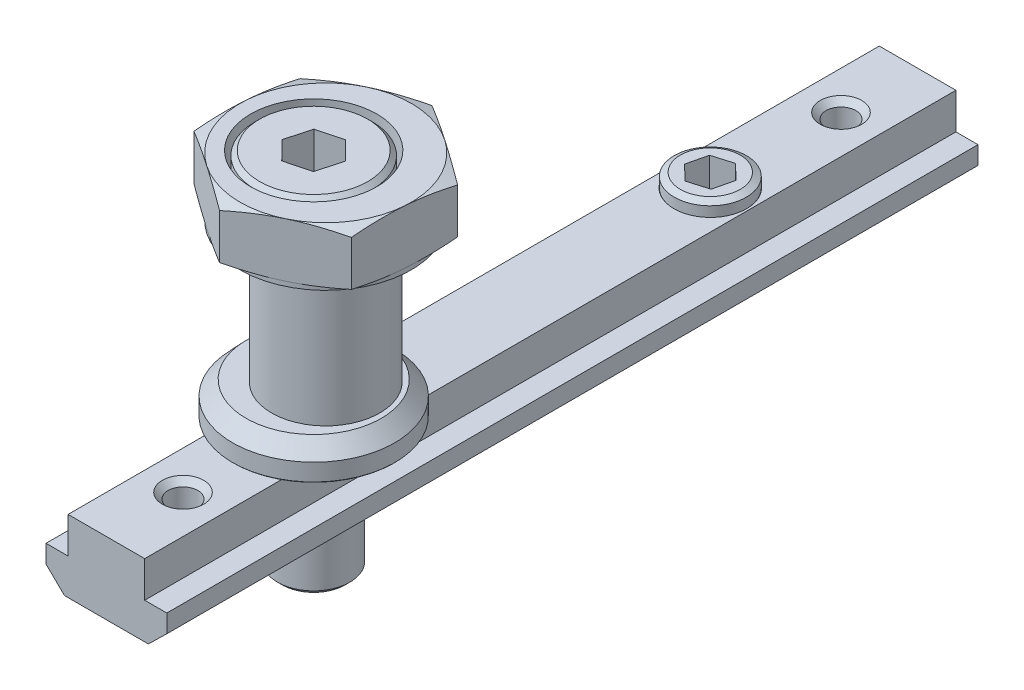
ISO-10303-21;
HEADER;
FILE_DESCRIPTION(('STEP AP214'),'2;1');
FILE_NAME('part.step','',(''),(''),'','','');
FILE_SCHEMA(('AUTOMOTIVE_DESIGN { 1 0 10303 214 1 1 1 1 }'));
ENDSEC;
DATA;
#1=APPLICATION_CONTEXT('core data for automotive mechanical design processes');
#2=APPLICATION_PROTOCOL_DEFINITION('international standard','automotive_design',2000,#1);
#3=PRODUCT_CONTEXT('',#1,'mechanical');
#4=PRODUCT('Part','Part','',(#3));
#5=PRODUCT_RELATED_PRODUCT_CATEGORY('part','',(#4));
#6=PRODUCT_DEFINITION_FORMATION('','',#4);
#7=PRODUCT_DEFINITION_CONTEXT('part definition',#1,'design');
#8=PRODUCT_DEFINITION('design','',#6,#7);
#9=PRODUCT_DEFINITION_SHAPE('','',#8);
#10=(LENGTH_UNIT() NAMED_UNIT(*) SI_UNIT(.MILLI.,.METRE.));
#11=(NAMED_UNIT(*) PLANE_ANGLE_UNIT() SI_UNIT($,.RADIAN.));
#12=(NAMED_UNIT(*) SI_UNIT($,.STERADIAN.) SOLID_ANGLE_UNIT());
#13=UNCERTAINTY_MEASURE_WITH_UNIT(LENGTH_MEASURE(1.E-05),#10,'distance_accuracy_value','');
#14=(GEOMETRIC_REPRESENTATION_CONTEXT(3) GLOBAL_UNCERTAINTY_ASSIGNED_CONTEXT((#13)) GLOBAL_UNIT_ASSIGNED_CONTEXT((#10,
#11,#12)) REPRESENTATION_CONTEXT('',''));
#15=CARTESIAN_POINT('',(0.,0.,0.));
#16=DIRECTION('',(0.,0.,1.));
#17=DIRECTION('',(1.,0.,0.));
#18=AXIS2_PLACEMENT_3D('',#15,#16,#17);
#19=CARTESIAN_POINT('',(-4.65,-8.,-45.));
#20=DIRECTION('',(0.,-1.,0.));
#21=DIRECTION('',(0.,0.,-1.));
#22=AXIS2_PLACEMENT_3D('',#19,#20,#21);
#23=PLANE('',#22);
#24=CARTESIAN_POINT('',(0.,-8.,-22.));
#25=DIRECTION('',(0.,-1.,0.));
#26=DIRECTION('',(0.,0.,-1.));
#27=AXIS2_PLACEMENT_3D('',#24,#25,#26);
#28=CIRCLE('',#27,4.65);
#29=CARTESIAN_POINT('',(4.65,-8.,-22.));
#30=VERTEX_POINT('',#29);
#31=CARTESIAN_POINT('',(-4.65,-8.,-22.));
#32=VERTEX_POINT('',#31);
#33=EDGE_CURVE('P0_E11',#30,#32,#28,.T.);
#34=ORIENTED_EDGE('',*,*,#33,.F.);
#35=DIRECTION('',(0.,0.,1.));
#36=VECTOR('',#35,1.);
#37=CARTESIAN_POINT('',(4.65,-8.,-45.));
#38=LINE('',#37,#36);
#39=CARTESIAN_POINT('',(4.65,-8.,22.));
#40=VERTEX_POINT('',#39);
#41=EDGE_CURVE('P0_E114',#30,#40,#38,.T.);
#42=ORIENTED_EDGE('',*,*,#41,.T.);
#43=CARTESIAN_POINT('',(0.,-8.,22.));
#44=DIRECTION('',(0.,1.,0.));
#45=DIRECTION('',(0.,0.,1.));
#46=AXIS2_PLACEMENT_3D('',#43,#44,#45);
#47=CIRCLE('',#46,4.65);
#48=CARTESIAN_POINT('',(-4.65000000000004,-7.99999999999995,22.));
#49=VERTEX_POINT('',#48);
#50=EDGE_CURVE('P0_E299',#40,#49,#47,.T.);
#51=ORIENTED_EDGE('',*,*,#50,.T.);
#52=DIRECTION('',(0.,0.,1.));
#53=VECTOR('',#52,1.);
#54=CARTESIAN_POINT('',(-4.65,-8.,-45.));
#55=LINE('',#54,#53);
#56=EDGE_CURVE('P0_E38',#32,#49,#55,.T.);
#57=ORIENTED_EDGE('',*,*,#56,.F.);
#58=EDGE_LOOP('',(#34,#42,#51,#57));
#59=FACE_BOUND('',#58,.T.);
#60=ADVANCED_FACE('P0_F17',(#59),#23,.T.);
#61=EDGE_CURVE('P0_E296',#49,#40,#47,.T.);
#62=ORIENTED_EDGE('',*,*,#61,.T.);
#63=CARTESIAN_POINT('',(4.65,-8.,45.));
#64=VERTEX_POINT('',#63);
#65=EDGE_CURVE('P0_E123',#40,#64,#38,.T.);
#66=ORIENTED_EDGE('',*,*,#65,.T.);
#67=DIRECTION('',(1.,0.,0.));
#68=VECTOR('',#67,1.);
#69=CARTESIAN_POINT('',(-4.65,-8.,45.));
#70=LINE('',#69,#68);
#71=CARTESIAN_POINT('',(-4.65,-8.,45.));
#72=VERTEX_POINT('',#71);
#73=EDGE_CURVE('P0_E226',#72,#64,#70,.T.);
#74=ORIENTED_EDGE('',*,*,#73,.F.);
#75=EDGE_CURVE('P0_E148',#49,#72,#55,.T.);
#76=ORIENTED_EDGE('',*,*,#75,.F.);
#77=EDGE_LOOP('',(#62,#66,#74,#76));
#78=FACE_BOUND('',#77,.T.);
#79=CARTESIAN_POINT('',(0.,-8.,36.5));
#80=DIRECTION('',(0.,1.,0.));
#81=DIRECTION('',(0.,0.,1.));
#82=AXIS2_PLACEMENT_3D('',#79,#80,#81);
#83=CIRCLE('',#82,2.5);
#84=CARTESIAN_POINT('',(0.,-8.,39.));
#85=VERTEX_POINT('',#84);
#86=EDGE_CURVE('P0_E286',#85,#85,#83,.T.);
#87=ORIENTED_EDGE('',*,*,#86,.T.);
#88=EDGE_LOOP('',(#87));
#89=FACE_BOUND('',#88,.T.);
#90=ADVANCED_FACE('P0_F385',(#78,#89),#23,.T.);
#91=CARTESIAN_POINT('',(4.25,-4.,-45.));
#92=DIRECTION('',(0.,1.,0.));
#93=DIRECTION('',(0.,0.,1.));
#94=AXIS2_PLACEMENT_3D('',#91,#92,#93);
#95=PLANE('',#94);
#96=DIRECTION('',(-1.,0.,0.));
#97=VECTOR('',#96,1.);
#98=CARTESIAN_POINT('',(4.25,-4.,45.));
#99=LINE('',#98,#97);
#100=CARTESIAN_POINT('',(6.7,-4.,45.));
#101=VERTEX_POINT('',#100);
#102=CARTESIAN_POINT('',(4.25,-4.,45.));
#103=VERTEX_POINT('',#102);
#104=EDGE_CURVE('P0_E200',#101,#103,#99,.T.);
#105=ORIENTED_EDGE('',*,*,#104,.F.);
#106=DIRECTION('',(0.,0.,1.));
#107=VECTOR('',#106,1.);
#108=CARTESIAN_POINT('',(6.7,-4.,-45.));
#109=LINE('',#108,#107);
#110=CARTESIAN_POINT('',(6.7,-4.,-45.));
#111=VERTEX_POINT('',#110);
#112=EDGE_CURVE('P0_E26',#111,#101,#109,.T.);
#113=ORIENTED_EDGE('',*,*,#112,.F.);
#114=DIRECTION('',(-1.,0.,0.));
#115=VECTOR('',#114,1.);
#116=CARTESIAN_POINT('',(4.25,-4.,-45.));
#117=LINE('',#116,#115);
#118=CARTESIAN_POINT('',(4.25,-4.,-45.));
#119=VERTEX_POINT('',#118);
#120=EDGE_CURVE('P0_E237',#111,#119,#117,.T.);
#121=ORIENTED_EDGE('',*,*,#120,.T.);
#122=DIRECTION('',(0.,0.,1.));
#123=VECTOR('',#122,1.);
#124=CARTESIAN_POINT('',(4.25,-4.,-45.));
#125=LINE('',#124,#123);
#126=EDGE_CURVE('P0_E179',#119,#103,#125,.T.);
#127=ORIENTED_EDGE('',*,*,#126,.T.);
#128=EDGE_LOOP('',(#105,#113,#121,#127));
#129=FACE_BOUND('',#128,.T.);
#130=ADVANCED_FACE('P0_F19',(#129),#95,.T.);
#131=CARTESIAN_POINT('',(6.7,-6.,-45.));
#132=DIRECTION('',(1.,0.,0.));
#133=DIRECTION('',(0.,1.,0.));
#134=AXIS2_PLACEMENT_3D('',#131,#132,#133);
#135=PLANE('',#134);
#136=DIRECTION('',(0.,1.,0.));
#137=VECTOR('',#136,1.);
#138=CARTESIAN_POINT('',(6.7,-6.,45.));
#139=LINE('',#138,#137);
#140=CARTESIAN_POINT('',(6.7,-6.,45.));
#141=VERTEX_POINT('',#140);
#142=EDGE_CURVE('P0_E233',#141,#101,#139,.T.);
#143=ORIENTED_EDGE('',*,*,#142,.F.);
#144=DIRECTION('',(0.,0.,1.));
#145=VECTOR('',#144,1.);
#146=CARTESIAN_POINT('',(6.7,-6.,-45.));
#147=LINE('',#146,#145);
#148=CARTESIAN_POINT('',(6.7,-6.,-45.));
#149=VERTEX_POINT('',#148);
#150=EDGE_CURVE('P0_E132',#149,#141,#147,.T.);
#151=ORIENTED_EDGE('',*,*,#150,.F.);
#152=DIRECTION('',(0.,1.,0.));
#153=VECTOR('',#152,1.);
#154=CARTESIAN_POINT('',(6.7,-6.,-45.));
#155=LINE('',#154,#153);
#156=EDGE_CURVE('P0_E181',#149,#111,#155,.T.);
#157=ORIENTED_EDGE('',*,*,#156,.T.);
#158=ORIENTED_EDGE('',*,*,#112,.T.);
#159=EDGE_LOOP('',(#143,#151,#157,#158));
#160=FACE_BOUND('',#159,.T.);
#161=ADVANCED_FACE('P0_F242',(#160),#135,.T.);
#162=CARTESIAN_POINT('',(4.65,-8.,-45.));
#163=DIRECTION('',(0.698323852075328,-0.715781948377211,0.));
#164=DIRECTION('',(0.715781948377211,0.698323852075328,0.));
#165=AXIS2_PLACEMENT_3D('',#162,#163,#164);
#166=PLANE('',#165);
#167=DIRECTION('',(0.715781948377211,0.698323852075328,0.));
#168=VECTOR('',#167,1.);
#169=CARTESIAN_POINT('',(4.65,-8.,45.));
#170=LINE('',#169,#168);
#171=EDGE_CURVE('P0_E229',#64,#141,#170,.T.);
#172=ORIENTED_EDGE('',*,*,#171,.F.);
#173=ORIENTED_EDGE('',*,*,#65,.F.);
#174=ORIENTED_EDGE('',*,*,#41,.F.);
#175=CARTESIAN_POINT('',(4.65,-8.,-45.));
#176=VERTEX_POINT('',#175);
#177=EDGE_CURVE('P0_E121',#176,#30,#38,.T.);
#178=ORIENTED_EDGE('',*,*,#177,.F.);
#179=DIRECTION('',(0.715781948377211,0.698323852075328,0.));
#180=VECTOR('',#179,1.);
#181=CARTESIAN_POINT('',(4.65,-8.,-45.));
#182=LINE('',#181,#180);
#183=EDGE_CURVE('P0_E190',#176,#149,#182,.T.);
#184=ORIENTED_EDGE('',*,*,#183,.T.);
#185=ORIENTED_EDGE('',*,*,#150,.T.);
#186=EDGE_LOOP('',(#172,#173,#174,#178,#184,#185));
#187=FACE_BOUND('',#186,.T.);
#188=ADVANCED_FACE('P0_F119',(#187),#166,.T.);
#189=CARTESIAN_POINT('',(0.,-8.,-22.));
#190=DIRECTION('',(0.,1.,0.));
#191=DIRECTION('',(0.,0.,1.));
#192=AXIS2_PLACEMENT_3D('',#189,#190,#191);
#193=CIRCLE('',#192,4.65);
#194=EDGE_CURVE('P0_E103',#30,#32,#193,.T.);
#195=ORIENTED_EDGE('',*,*,#194,.T.);
#196=CARTESIAN_POINT('',(-4.65,-8.,-45.));
#197=VERTEX_POINT('',#196);
#198=EDGE_CURVE('P0_E141',#197,#32,#55,.T.);
#199=ORIENTED_EDGE('',*,*,#198,.F.);
#200=DIRECTION('',(1.,0.,0.));
#201=VECTOR('',#200,1.);
#202=CARTESIAN_POINT('',(-4.65,-8.,-45.));
#203=LINE('',#202,#201);
#204=EDGE_CURVE('P0_E130',#197,#176,#203,.T.);
#205=ORIENTED_EDGE('',*,*,#204,.T.);
#206=ORIENTED_EDGE('',*,*,#177,.T.);
#207=EDGE_LOOP('',(#195,#199,#205,#206));
#208=FACE_BOUND('',#207,.T.);
#209=CARTESIAN_POINT('',(0.,-8.,-36.5));
#210=DIRECTION('',(0.,1.,0.));
#211=DIRECTION('',(0.,0.,1.));
#212=AXIS2_PLACEMENT_3D('',#209,#210,#211);
#213=CIRCLE('',#212,2.5);
#214=CARTESIAN_POINT('',(0.,-8.,-34.));
#215=VERTEX_POINT('',#214);
#216=EDGE_CURVE('P0_E319',#215,#215,#213,.T.);
#217=ORIENTED_EDGE('',*,*,#216,.T.);
#218=EDGE_LOOP('',(#217));
#219=FACE_BOUND('',#218,.T.);
#220=ADVANCED_FACE('P0_F127',(#208,#219),#23,.T.);
#221=CARTESIAN_POINT('',(-6.7,-6.,-45.));
#222=DIRECTION('',(-0.698323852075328,-0.715781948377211,0.));
#223=DIRECTION('',(0.715781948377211,-0.698323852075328,0.));
#224=AXIS2_PLACEMENT_3D('',#221,#222,#223);
#225=PLANE('',#224);
#226=DIRECTION('',(0.715781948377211,-0.698323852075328,0.));
#227=VECTOR('',#226,1.);
#228=CARTESIAN_POINT('',(-6.7,-6.,45.));
#229=LINE('',#228,#227);
#230=CARTESIAN_POINT('',(-6.7,-6.,45.));
#231=VERTEX_POINT('',#230);
#232=EDGE_CURVE('P0_E223',#231,#72,#229,.T.);
#233=ORIENTED_EDGE('',*,*,#232,.F.);
#234=DIRECTION('',(0.,0.,1.));
#235=VECTOR('',#234,1.);
#236=CARTESIAN_POINT('',(-6.7,-6.,-45.));
#237=LINE('',#236,#235);
#238=CARTESIAN_POINT('',(-6.7,-6.,-45.));
#239=VERTEX_POINT('',#238);
#240=EDGE_CURVE('P0_E155',#239,#231,#237,.T.);
#241=ORIENTED_EDGE('',*,*,#240,.F.);
#242=DIRECTION('',(0.715781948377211,-0.698323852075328,0.));
#243=VECTOR('',#242,1.);
#244=CARTESIAN_POINT('',(-6.7,-6.,-45.));
#245=LINE('',#244,#243);
#246=EDGE_CURVE('P0_E276',#239,#197,#245,.T.);
#247=ORIENTED_EDGE('',*,*,#246,.T.);
#248=ORIENTED_EDGE('',*,*,#198,.T.);
#249=ORIENTED_EDGE('',*,*,#56,.T.);
#250=ORIENTED_EDGE('',*,*,#75,.T.);
#251=EDGE_LOOP('',(#233,#241,#247,#248,#249,#250));
#252=FACE_BOUND('',#251,.T.);
#253=ADVANCED_FACE('P0_F393',(#252),#225,.T.);
#254=CARTESIAN_POINT('',(-6.7,-4.,-45.));
#255=DIRECTION('',(-1.,0.,0.));
#256=DIRECTION('',(0.,-1.,0.));
#257=AXIS2_PLACEMENT_3D('',#254,#255,#256);
#258=PLANE('',#257);
#259=DIRECTION('',(0.,-1.,0.));
#260=VECTOR('',#259,1.);
#261=CARTESIAN_POINT('',(-6.7,-4.,45.));
#262=LINE('',#261,#260);
#263=CARTESIAN_POINT('',(-6.7,-4.,45.));
#264=VERTEX_POINT('',#263);
#265=EDGE_CURVE('P0_E219',#264,#231,#262,.T.);
#266=ORIENTED_EDGE('',*,*,#265,.F.);
#267=DIRECTION('',(0.,0.,1.));
#268=VECTOR('',#267,1.);
#269=CARTESIAN_POINT('',(-6.7,-4.,-45.));
#270=LINE('',#269,#268);
#271=CARTESIAN_POINT('',(-6.7,-4.,-45.));
#272=VERTEX_POINT('',#271);
#273=EDGE_CURVE('P0_E162',#272,#264,#270,.T.);
#274=ORIENTED_EDGE('',*,*,#273,.F.);
#275=DIRECTION('',(0.,-1.,0.));
#276=VECTOR('',#275,1.);
#277=CARTESIAN_POINT('',(-6.7,-4.,-45.));
#278=LINE('',#277,#276);
#279=EDGE_CURVE('P0_E273',#272,#239,#278,.T.);
#280=ORIENTED_EDGE('',*,*,#279,.T.);
#281=ORIENTED_EDGE('',*,*,#240,.T.);
#282=EDGE_LOOP('',(#266,#274,#280,#281));
#283=FACE_BOUND('',#282,.T.);
#284=ADVANCED_FACE('P0_F398',(#283),#258,.T.);
#285=CARTESIAN_POINT('',(-4.25,-4.,-45.));
#286=DIRECTION('',(0.,1.,0.));
#287=DIRECTION('',(0.,0.,1.));
#288=AXIS2_PLACEMENT_3D('',#285,#286,#287);
#289=PLANE('',#288);
#290=DIRECTION('',(-1.,0.,0.));
#291=VECTOR('',#290,1.);
#292=CARTESIAN_POINT('',(-4.25,-4.,45.));
#293=LINE('',#292,#291);
#294=CARTESIAN_POINT('',(-4.25,-4.,45.));
#295=VERTEX_POINT('',#294);
#296=EDGE_CURVE('P0_E215',#295,#264,#293,.T.);
#297=ORIENTED_EDGE('',*,*,#296,.F.);
#298=DIRECTION('',(0.,0.,1.));
#299=VECTOR('',#298,1.);
#300=CARTESIAN_POINT('',(-4.25,-4.,-45.));
#301=LINE('',#300,#299);
#302=CARTESIAN_POINT('',(-4.25,-4.,-45.));
#303=VERTEX_POINT('',#302);
#304=EDGE_CURVE('P0_E169',#303,#295,#301,.T.);
#305=ORIENTED_EDGE('',*,*,#304,.F.);
#306=DIRECTION('',(-1.,0.,0.));
#307=VECTOR('',#306,1.);
#308=CARTESIAN_POINT('',(-4.25,-4.,-45.));
#309=LINE('',#308,#307);
#310=EDGE_CURVE('P0_E269',#303,#272,#309,.T.);
#311=ORIENTED_EDGE('',*,*,#310,.T.);
#312=ORIENTED_EDGE('',*,*,#273,.T.);
#313=EDGE_LOOP('',(#297,#305,#311,#312));
#314=FACE_BOUND('',#313,.T.);
#315=ADVANCED_FACE('P0_F532',(#314),#289,.T.);
#316=CARTESIAN_POINT('',(-4.25,0.,-45.));
#317=DIRECTION('',(-1.,0.,0.));
#318=DIRECTION('',(0.,-1.,0.));
#319=AXIS2_PLACEMENT_3D('',#316,#317,#318);
#320=PLANE('',#319);
#321=DIRECTION('',(0.,-1.,0.));
#322=VECTOR('',#321,1.);
#323=CARTESIAN_POINT('',(-4.25,0.,45.));
#324=LINE('',#323,#322);
#325=CARTESIAN_POINT('',(-4.25,0.,45.));
#326=VERTEX_POINT('',#325);
#327=EDGE_CURVE('P0_E212',#326,#295,#324,.T.);
#328=ORIENTED_EDGE('',*,*,#327,.F.);
#329=DIRECTION('',(0.,0.,1.));
#330=VECTOR('',#329,1.);
#331=CARTESIAN_POINT('',(-4.25,0.,-45.));
#332=LINE('',#331,#330);
#333=CARTESIAN_POINT('',(-4.25,0.,-45.));
#334=VERTEX_POINT('',#333);
#335=EDGE_CURVE('P0_E174',#334,#326,#332,.T.);
#336=ORIENTED_EDGE('',*,*,#335,.F.);
#337=DIRECTION('',(0.,-1.,0.));
#338=VECTOR('',#337,1.);
#339=CARTESIAN_POINT('',(-4.25,0.,-45.));
#340=LINE('',#339,#338);
#341=EDGE_CURVE('P0_E265',#334,#303,#340,.T.);
#342=ORIENTED_EDGE('',*,*,#341,.T.);
#343=ORIENTED_EDGE('',*,*,#304,.T.);
#344=EDGE_LOOP('',(#328,#336,#342,#343));
#345=FACE_BOUND('',#344,.T.);
#346=ADVANCED_FACE('P0_F370',(#345),#320,.T.);
#347=CARTESIAN_POINT('',(-4.25,0.,-45.));
#348=DIRECTION('',(0.,1.,0.));
#349=DIRECTION('',(0.,0.,1.));
#350=AXIS2_PLACEMENT_3D('',#347,#348,#349);
#351=PLANE('',#350);
#352=CARTESIAN_POINT('',(0.,0.,-22.));
#353=DIRECTION('',(0.,1.,0.));
#354=DIRECTION('',(0.,0.,1.));
#355=AXIS2_PLACEMENT_3D('',#352,#353,#354);
#356=CIRCLE('',#355,4.025);
#357=CARTESIAN_POINT('',(0.,0.,-17.975));
#358=VERTEX_POINT('',#357);
#359=EDGE_CURVE('P0_E109',#358,#358,#356,.T.);
#360=ORIENTED_EDGE('',*,*,#359,.F.);
#361=EDGE_LOOP('',(#360));
#362=FACE_BOUND('',#361,.T.);
#363=CARTESIAN_POINT('',(0.,0.,-36.5));
#364=DIRECTION('',(0.,1.,0.));
#365=DIRECTION('',(0.,0.,1.));
#366=AXIS2_PLACEMENT_3D('',#363,#364,#365);
#367=CIRCLE('',#366,2.3);
#368=CARTESIAN_POINT('',(0.,0.,-34.2));
#369=VERTEX_POINT('',#368);
#370=EDGE_CURVE('P0_E315',#369,#369,#367,.T.);
#371=ORIENTED_EDGE('',*,*,#370,.F.);
#372=EDGE_LOOP('',(#371));
#373=FACE_BOUND('',#372,.T.);
#374=CARTESIAN_POINT('',(0.,0.,22.));
#375=DIRECTION('',(0.,1.,0.));
#376=DIRECTION('',(0.,0.,1.));
#377=AXIS2_PLACEMENT_3D('',#374,#375,#376);
#378=CIRCLE('',#377,4.025);
#379=CARTESIAN_POINT('',(0.,0.,26.025));
#380=VERTEX_POINT('',#379);
#381=EDGE_CURVE('P0_E304',#380,#380,#378,.T.);
#382=ORIENTED_EDGE('',*,*,#381,.F.);
#383=EDGE_LOOP('',(#382));
#384=FACE_BOUND('',#383,.T.);
#385=CARTESIAN_POINT('',(0.,0.,36.5));
#386=DIRECTION('',(0.,1.,0.));
#387=DIRECTION('',(0.,0.,1.));
#388=AXIS2_PLACEMENT_3D('',#385,#386,#387);
#389=CIRCLE('',#388,2.3);
#390=CARTESIAN_POINT('',(0.,0.,38.8));
#391=VERTEX_POINT('',#390);
#392=EDGE_CURVE('P0_E344',#391,#391,#389,.T.);
#393=ORIENTED_EDGE('',*,*,#392,.F.);
#394=EDGE_LOOP('',(#393));
#395=FACE_BOUND('',#394,.T.);
#396=DIRECTION('',(-1.,0.,0.));
#397=VECTOR('',#396,1.);
#398=CARTESIAN_POINT('',(-4.25,0.,45.));
#399=LINE('',#398,#397);
#400=CARTESIAN_POINT('',(4.25,0.,45.));
#401=VERTEX_POINT('',#400);
#402=EDGE_CURVE('P0_E208',#401,#326,#399,.T.);
#403=ORIENTED_EDGE('',*,*,#402,.F.);
#404=DIRECTION('',(0.,0.,1.));
#405=VECTOR('',#404,1.);
#406=CARTESIAN_POINT('',(4.25,0.,-45.));
#407=LINE('',#406,#405);
#408=CARTESIAN_POINT('',(4.25,0.,-45.));
#409=VERTEX_POINT('',#408);
#410=EDGE_CURVE('P0_E177',#409,#401,#407,.T.);
#411=ORIENTED_EDGE('',*,*,#410,.F.);
#412=DIRECTION('',(-1.,0.,0.));
#413=VECTOR('',#412,1.);
#414=CARTESIAN_POINT('',(-4.25,0.,-45.));
#415=LINE('',#414,#413);
#416=EDGE_CURVE('P0_E257',#409,#334,#415,.T.);
#417=ORIENTED_EDGE('',*,*,#416,.T.);
#418=ORIENTED_EDGE('',*,*,#335,.T.);
#419=EDGE_LOOP('',(#403,#411,#417,#418));
#420=FACE_BOUND('',#419,.T.);
#421=ADVANCED_FACE('P0_F366',(#362,#373,#384,#395,#420),#351,.T.);
#422=CARTESIAN_POINT('',(4.25,0.,-45.));
#423=DIRECTION('',(1.,0.,0.));
#424=DIRECTION('',(0.,1.,0.));
#425=AXIS2_PLACEMENT_3D('',#422,#423,#424);
#426=PLANE('',#425);
#427=DIRECTION('',(0.,1.,0.));
#428=VECTOR('',#427,1.);
#429=CARTESIAN_POINT('',(4.25,0.,45.));
#430=LINE('',#429,#428);
#431=EDGE_CURVE('P0_E204',#103,#401,#430,.T.);
#432=ORIENTED_EDGE('',*,*,#431,.F.);
#433=ORIENTED_EDGE('',*,*,#126,.F.);
#434=DIRECTION('',(0.,1.,0.));
#435=VECTOR('',#434,1.);
#436=CARTESIAN_POINT('',(4.25,0.,-45.));
#437=LINE('',#436,#435);
#438=EDGE_CURVE('P0_E251',#119,#409,#437,.T.);
#439=ORIENTED_EDGE('',*,*,#438,.T.);
#440=ORIENTED_EDGE('',*,*,#410,.T.);
#441=EDGE_LOOP('',(#432,#433,#439,#440));
#442=FACE_BOUND('',#441,.T.);
#443=ADVANCED_FACE('P0_F369',(#442),#426,.T.);
#444=CARTESIAN_POINT('',(0.,0.,-45.));
#445=DIRECTION('',(0.,0.,1.));
#446=DIRECTION('',(1.,0.,0.));
#447=AXIS2_PLACEMENT_3D('',#444,#445,#446);
#448=PLANE('',#447);
#449=ORIENTED_EDGE('',*,*,#120,.F.);
#450=ORIENTED_EDGE('',*,*,#156,.F.);
#451=ORIENTED_EDGE('',*,*,#183,.F.);
#452=ORIENTED_EDGE('',*,*,#204,.F.);
#453=ORIENTED_EDGE('',*,*,#246,.F.);
#454=ORIENTED_EDGE('',*,*,#279,.F.);
#455=ORIENTED_EDGE('',*,*,#310,.F.);
#456=ORIENTED_EDGE('',*,*,#341,.F.);
#457=ORIENTED_EDGE('',*,*,#416,.F.);
#458=ORIENTED_EDGE('',*,*,#438,.F.);
#459=EDGE_LOOP('',(#449,#450,#451,#452,#453,#454,#455,#456,#457,#458));
#460=FACE_BOUND('',#459,.T.);
#461=ADVANCED_FACE('P0_F247',(#460),#448,.F.);
#462=CARTESIAN_POINT('',(0.,0.,45.));
#463=DIRECTION('',(0.,0.,1.));
#464=DIRECTION('',(1.,0.,0.));
#465=AXIS2_PLACEMENT_3D('',#462,#463,#464);
#466=PLANE('',#465);
#467=ORIENTED_EDGE('',*,*,#104,.T.);
#468=ORIENTED_EDGE('',*,*,#431,.T.);
#469=ORIENTED_EDGE('',*,*,#402,.T.);
#470=ORIENTED_EDGE('',*,*,#327,.T.);
#471=ORIENTED_EDGE('',*,*,#296,.T.);
#472=ORIENTED_EDGE('',*,*,#265,.T.);
#473=ORIENTED_EDGE('',*,*,#232,.T.);
#474=ORIENTED_EDGE('',*,*,#73,.T.);
#475=ORIENTED_EDGE('',*,*,#171,.T.);
#476=ORIENTED_EDGE('',*,*,#142,.T.);
#477=EDGE_LOOP('',(#467,#468,#469,#470,#471,#472,#473,#474,#475,#476));
#478=FACE_BOUND('',#477,.T.);
#479=ADVANCED_FACE('P0_F245',(#478),#466,.T.);
#480=CARTESIAN_POINT('',(0.,-7.15,36.5));
#481=DIRECTION('',(0.,-1.,0.));
#482=DIRECTION('',(0.,0.,-1.));
#483=AXIS2_PLACEMENT_3D('',#480,#481,#482);
#484=CONICAL_SURFACE('',#483,1.65,0.785398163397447);
#485=ORIENTED_EDGE('',*,*,#86,.F.);
#486=EDGE_LOOP('',(#485));
#487=FACE_BOUND('',#486,.T.);
#488=CARTESIAN_POINT('',(0.,-7.15,36.5));
#489=DIRECTION('',(0.,1.,0.));
#490=DIRECTION('',(0.,0.,1.));
#491=AXIS2_PLACEMENT_3D('',#488,#489,#490);
#492=CIRCLE('',#491,1.65);
#493=CARTESIAN_POINT('',(0.,-7.15,38.15));
#494=VERTEX_POINT('',#493);
#495=EDGE_CURVE('P0_E205',#494,#494,#492,.T.);
#496=ORIENTED_EDGE('',*,*,#495,.T.);
#497=EDGE_LOOP('',(#496));
#498=FACE_BOUND('',#497,.T.);
#499=ADVANCED_FACE('P0_F405',(#487,#498),#484,.F.);
#500=CARTESIAN_POINT('',(0.,0.,36.5));
#501=DIRECTION('',(0.,1.,0.));
#502=DIRECTION('',(0.,0.,1.));
#503=AXIS2_PLACEMENT_3D('',#500,#501,#502);
#504=CYLINDRICAL_SURFACE('',#503,1.65);
#505=ORIENTED_EDGE('',*,*,#495,.F.);
#506=EDGE_LOOP('',(#505));
#507=FACE_BOUND('',#506,.T.);
#508=CARTESIAN_POINT('',(0.,-0.65,36.5));
#509=DIRECTION('',(0.,1.,0.));
#510=DIRECTION('',(0.,0.,1.));
#511=AXIS2_PLACEMENT_3D('',#508,#509,#510);
#512=CIRCLE('',#511,1.65);
#513=CARTESIAN_POINT('',(0.,-0.65,38.15));
#514=VERTEX_POINT('',#513);
#515=EDGE_CURVE('P0_E341',#514,#514,#512,.T.);
#516=ORIENTED_EDGE('',*,*,#515,.T.);
#517=EDGE_LOOP('',(#516));
#518=FACE_BOUND('',#517,.T.);
#519=ADVANCED_FACE('P0_F409',(#507,#518),#504,.F.);
#520=CARTESIAN_POINT('',(0.,0.,36.5));
#521=DIRECTION('',(0.,1.,0.));
#522=DIRECTION('',(0.,0.,1.));
#523=AXIS2_PLACEMENT_3D('',#520,#521,#522);
#524=CONICAL_SURFACE('',#523,2.3,0.785398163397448);
#525=ORIENTED_EDGE('',*,*,#515,.F.);
#526=EDGE_LOOP('',(#525));
#527=FACE_BOUND('',#526,.T.);
#528=ORIENTED_EDGE('',*,*,#392,.T.);
#529=EDGE_LOOP('',(#528));
#530=FACE_BOUND('',#529,.T.);
#531=ADVANCED_FACE('P0_F413',(#527,#530),#524,.F.);
#532=CARTESIAN_POINT('',(0.,-6.75,22.));
#533=DIRECTION('',(0.,-1.,0.));
#534=DIRECTION('',(0.,0.,-1.));
#535=AXIS2_PLACEMENT_3D('',#532,#533,#534);
#536=CONICAL_SURFACE('',#535,3.4,0.785398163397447);
#537=ORIENTED_EDGE('',*,*,#50,.F.);
#538=ORIENTED_EDGE('',*,*,#61,.F.);
#539=EDGE_LOOP('',(#537,#538));
#540=FACE_BOUND('',#539,.T.);
#541=CARTESIAN_POINT('',(0.,-6.75,22.));
#542=DIRECTION('',(0.,1.,0.));
#543=DIRECTION('',(0.,0.,1.));
#544=AXIS2_PLACEMENT_3D('',#541,#542,#543);
#545=CIRCLE('',#544,3.4);
#546=CARTESIAN_POINT('',(0.,-6.75,25.4));
#547=VERTEX_POINT('',#546);
#548=EDGE_CURVE('P0_E351',#547,#547,#545,.T.);
#549=ORIENTED_EDGE('',*,*,#548,.T.);
#550=EDGE_LOOP('',(#549));
#551=FACE_BOUND('',#550,.T.);
#552=ADVANCED_FACE('P0_F417',(#540,#551),#536,.F.);
#553=CARTESIAN_POINT('',(0.,0.,22.));
#554=DIRECTION('',(0.,1.,0.));
#555=DIRECTION('',(0.,0.,1.));
#556=AXIS2_PLACEMENT_3D('',#553,#554,#555);
#557=CYLINDRICAL_SURFACE('',#556,3.4);
#558=ORIENTED_EDGE('',*,*,#548,.F.);
#559=EDGE_LOOP('',(#558));
#560=FACE_BOUND('',#559,.T.);
#561=CARTESIAN_POINT('',(0.,-0.625000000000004,22.));
#562=DIRECTION('',(0.,1.,0.));
#563=DIRECTION('',(0.,0.,1.));
#564=AXIS2_PLACEMENT_3D('',#561,#562,#563);
#565=CIRCLE('',#564,3.4);
#566=CARTESIAN_POINT('',(0.,-0.625000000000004,25.4));
#567=VERTEX_POINT('',#566);
#568=EDGE_CURVE('P0_E355',#567,#567,#565,.T.);
#569=ORIENTED_EDGE('',*,*,#568,.T.);
#570=EDGE_LOOP('',(#569));
#571=FACE_BOUND('',#570,.T.);
#572=ADVANCED_FACE('P0_F421',(#560,#571),#557,.F.);
#573=CARTESIAN_POINT('',(0.,0.,22.));
#574=DIRECTION('',(0.,1.,0.));
#575=DIRECTION('',(0.,0.,1.));
#576=AXIS2_PLACEMENT_3D('',#573,#574,#575);
#577=CONICAL_SURFACE('',#576,4.025,0.785398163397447);
#578=ORIENTED_EDGE('',*,*,#568,.F.);
#579=EDGE_LOOP('',(#578));
#580=FACE_BOUND('',#579,.T.);
#581=ORIENTED_EDGE('',*,*,#381,.T.);
#582=EDGE_LOOP('',(#581));
#583=FACE_BOUND('',#582,.T.);
#584=ADVANCED_FACE('P0_F364',(#580,#583),#577,.F.);
#585=CARTESIAN_POINT('',(0.,-7.15,-36.5));
#586=DIRECTION('',(0.,-1.,0.));
#587=DIRECTION('',(0.,0.,-1.));
#588=AXIS2_PLACEMENT_3D('',#585,#586,#587);
#589=CONICAL_SURFACE('',#588,1.65,0.785398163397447);
#590=ORIENTED_EDGE('',*,*,#216,.F.);
#591=EDGE_LOOP('',(#590));
#592=FACE_BOUND('',#591,.T.);
#593=CARTESIAN_POINT('',(0.,-7.15,-36.5));
#594=DIRECTION('',(0.,1.,0.));
#595=DIRECTION('',(0.,0.,1.));
#596=AXIS2_PLACEMENT_3D('',#593,#594,#595);
#597=CIRCLE('',#596,1.65);
#598=CARTESIAN_POINT('',(0.,-7.15,-34.85));
#599=VERTEX_POINT('',#598);
#600=EDGE_CURVE('P0_E300',#599,#599,#597,.T.);
#601=ORIENTED_EDGE('',*,*,#600,.T.);
#602=EDGE_LOOP('',(#601));
#603=FACE_BOUND('',#602,.T.);
#604=ADVANCED_FACE('P0_F428',(#592,#603),#589,.F.);
#605=CARTESIAN_POINT('',(0.,0.,-36.5));
#606=DIRECTION('',(0.,1.,0.));
#607=DIRECTION('',(0.,0.,1.));
#608=AXIS2_PLACEMENT_3D('',#605,#606,#607);
#609=CYLINDRICAL_SURFACE('',#608,1.65);
#610=ORIENTED_EDGE('',*,*,#600,.F.);
#611=EDGE_LOOP('',(#610));
#612=FACE_BOUND('',#611,.T.);
#613=CARTESIAN_POINT('',(0.,-0.65,-36.5));
#614=DIRECTION('',(0.,1.,0.));
#615=DIRECTION('',(0.,0.,1.));
#616=AXIS2_PLACEMENT_3D('',#613,#614,#615);
#617=CIRCLE('',#616,1.65);
#618=CARTESIAN_POINT('',(0.,-0.65,-34.85));
#619=VERTEX_POINT('',#618);
#620=EDGE_CURVE('P0_E307',#619,#619,#617,.T.);
#621=ORIENTED_EDGE('',*,*,#620,.T.);
#622=EDGE_LOOP('',(#621));
#623=FACE_BOUND('',#622,.T.);
#624=ADVANCED_FACE('P0_F432',(#612,#623),#609,.F.);
#625=CARTESIAN_POINT('',(0.,0.,-36.5));
#626=DIRECTION('',(0.,1.,0.));
#627=DIRECTION('',(0.,0.,1.));
#628=AXIS2_PLACEMENT_3D('',#625,#626,#627);
#629=CONICAL_SURFACE('',#628,2.3,0.785398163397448);
#630=ORIENTED_EDGE('',*,*,#620,.F.);
#631=EDGE_LOOP('',(#630));
#632=FACE_BOUND('',#631,.T.);
#633=ORIENTED_EDGE('',*,*,#370,.T.);
#634=EDGE_LOOP('',(#633));
#635=FACE_BOUND('',#634,.T.);
#636=ADVANCED_FACE('P0_F436',(#632,#635),#629,.F.);
#637=CARTESIAN_POINT('',(0.,-6.75,-22.));
#638=DIRECTION('',(0.,-1.,0.));
#639=DIRECTION('',(0.,0.,-1.));
#640=AXIS2_PLACEMENT_3D('',#637,#638,#639);
#641=CONICAL_SURFACE('',#640,3.4,0.785398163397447);
#642=ORIENTED_EDGE('',*,*,#194,.F.);
#643=ORIENTED_EDGE('',*,*,#33,.T.);
#644=EDGE_LOOP('',(#642,#643));
#645=FACE_BOUND('',#644,.T.);
#646=CARTESIAN_POINT('',(0.,-6.75,-22.));
#647=DIRECTION('',(0.,1.,0.));
#648=DIRECTION('',(0.,0.,1.));
#649=AXIS2_PLACEMENT_3D('',#646,#647,#648);
#650=CIRCLE('',#649,3.4);
#651=CARTESIAN_POINT('',(0.,-6.75,-18.6));
#652=VERTEX_POINT('',#651);
#653=EDGE_CURVE('P0_E324',#652,#652,#650,.T.);
#654=ORIENTED_EDGE('',*,*,#653,.T.);
#655=EDGE_LOOP('',(#654));
#656=FACE_BOUND('',#655,.T.);
#657=ADVANCED_FACE('P0_F104',(#645,#656),#641,.F.);
#658=CARTESIAN_POINT('',(0.,0.,-22.));
#659=DIRECTION('',(0.,1.,0.));
#660=DIRECTION('',(0.,0.,1.));
#661=AXIS2_PLACEMENT_3D('',#658,#659,#660);
#662=CYLINDRICAL_SURFACE('',#661,3.4);
#663=ORIENTED_EDGE('',*,*,#653,.F.);
#664=EDGE_LOOP('',(#663));
#665=FACE_BOUND('',#664,.T.);
#666=CARTESIAN_POINT('',(0.,-0.625000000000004,-22.));
#667=DIRECTION('',(0.,1.,0.));
#668=DIRECTION('',(0.,0.,1.));
#669=AXIS2_PLACEMENT_3D('',#666,#667,#668);
#670=CIRCLE('',#669,3.4);
#671=CARTESIAN_POINT('',(0.,-0.625000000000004,-18.6));
#672=VERTEX_POINT('',#671);
#673=EDGE_CURVE('P0_E329',#672,#672,#670,.T.);
#674=ORIENTED_EDGE('',*,*,#673,.T.);
#675=EDGE_LOOP('',(#674));
#676=FACE_BOUND('',#675,.T.);
#677=ADVANCED_FACE('P0_F443',(#665,#676),#662,.F.);
#678=CARTESIAN_POINT('',(0.,0.,-22.));
#679=DIRECTION('',(0.,1.,0.));
#680=DIRECTION('',(0.,0.,1.));
#681=AXIS2_PLACEMENT_3D('',#678,#679,#680);
#682=CONICAL_SURFACE('',#681,4.025,0.785398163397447);
#683=ORIENTED_EDGE('',*,*,#673,.F.);
#684=EDGE_LOOP('',(#683));
#685=FACE_BOUND('',#684,.T.);
#686=ORIENTED_EDGE('',*,*,#359,.T.);
#687=EDGE_LOOP('',(#686));
#688=FACE_BOUND('',#687,.T.);
#689=ADVANCED_FACE('P0_F446',(#685,#688),#682,.F.);
#690=CLOSED_SHELL('',(#60,#90,#130,#161,#188,#220,#253,#284,#315,#346,#421,#443,#461,#479,#499,
#519,#531,#552,#572,#584,#604,#624,#636,#657,#677,#689));
#691=MANIFOLD_SOLID_BREP('P0_B1',#690);
#692=CARTESIAN_POINT('',(0.,0.,22.));
#693=DIRECTION('',(0.,-1.,0.));
#694=DIRECTION('',(0.0241476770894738,0.,-0.999708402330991));
#695=AXIS2_PLACEMENT_3D('',#692,#693,#694);
#696=CYLINDRICAL_SURFACE('',#695,4.);
#697=CARTESIAN_POINT('',(0.,3.6,22.));
#698=DIRECTION('',(0.,-1.,0.));
#699=DIRECTION('',(0.0241476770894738,0.,-0.999708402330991));
#700=AXIS2_PLACEMENT_3D('',#697,#698,#699);
#701=CIRCLE('',#700,4.);
#702=CARTESIAN_POINT('',(0.0965907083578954,3.6,18.001166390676));
#703=VERTEX_POINT('',#702);
#704=EDGE_CURVE('P1_E45',#703,#703,#701,.T.);
#705=ORIENTED_EDGE('',*,*,#704,.F.);
#706=EDGE_LOOP('',(#705));
#707=FACE_BOUND('',#706,.T.);
#708=CARTESIAN_POINT('',(0.,0.,22.));
#709=DIRECTION('',(0.,-1.,0.));
#710=DIRECTION('',(0.0241476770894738,0.,-0.999708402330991));
#711=AXIS2_PLACEMENT_3D('',#708,#709,#710);
#712=CIRCLE('',#711,4.);
#713=CARTESIAN_POINT('',(0.0965907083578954,0.,18.001166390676));
#714=VERTEX_POINT('',#713);
#715=EDGE_CURVE('P1_E31',#714,#714,#712,.T.);
#716=ORIENTED_EDGE('',*,*,#715,.T.);
#717=EDGE_LOOP('',(#716));
#718=FACE_BOUND('',#717,.T.);
#719=ADVANCED_FACE('P1_F15',(#707,#718),#696,.F.);
#720=CARTESIAN_POINT('',(-3.99883360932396,0.,21.9034092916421));
#721=DIRECTION('',(0.,1.,0.));
#722=DIRECTION('',(-0.0241476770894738,0.,0.999708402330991));
#723=AXIS2_PLACEMENT_3D('',#720,#721,#722);
#724=PLANE('',#723);
#725=CARTESIAN_POINT('',(0.,0.,22.));
#726=DIRECTION('',(0.,1.,0.));
#727=DIRECTION('',(-0.0241476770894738,0.,0.999708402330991));
#728=AXIS2_PLACEMENT_3D('',#725,#726,#727);
#729=CIRCLE('',#728,8.9);
#730=CARTESIAN_POINT('',(-0.214914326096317,0.,30.8974047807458));
#731=VERTEX_POINT('',#730);
#732=EDGE_CURVE('P1_E23',#731,#731,#729,.F.);
#733=ORIENTED_EDGE('',*,*,#732,.T.);
#734=EDGE_LOOP('',(#733));
#735=FACE_BOUND('',#734,.T.);
#736=ORIENTED_EDGE('',*,*,#715,.F.);
#737=EDGE_LOOP('',(#736));
#738=FACE_BOUND('',#737,.T.);
#739=ADVANCED_FACE('P1_F53',(#735,#738),#724,.F.);
#740=CARTESIAN_POINT('',(0.,0.,22.));
#741=DIRECTION('',(0.,-1.,0.));
#742=DIRECTION('',(0.0241476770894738,0.,-0.999708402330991));
#743=AXIS2_PLACEMENT_3D('',#740,#741,#742);
#744=CYLINDRICAL_SURFACE('',#743,9.);
#745=CARTESIAN_POINT('',(0.,0.100000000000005,22.));
#746=DIRECTION('',(0.,1.,0.));
#747=DIRECTION('',(-0.0241476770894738,0.,0.999708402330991));
#748=AXIS2_PLACEMENT_3D('',#745,#746,#747);
#749=CIRCLE('',#748,9.);
#750=CARTESIAN_POINT('',(-0.217329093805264,0.100000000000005,30.9973756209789));
#751=VERTEX_POINT('',#750);
#752=EDGE_CURVE('P1_E10',#751,#751,#749,.T.);
#753=ORIENTED_EDGE('',*,*,#752,.T.);
#754=EDGE_LOOP('',(#753));
#755=FACE_BOUND('',#754,.T.);
#756=CARTESIAN_POINT('',(0.,2.,22.));
#757=DIRECTION('',(0.,-1.,0.));
#758=DIRECTION('',(0.0241476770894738,0.,-0.999708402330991));
#759=AXIS2_PLACEMENT_3D('',#756,#757,#758);
#760=CIRCLE('',#759,9.);
#761=CARTESIAN_POINT('',(0.217329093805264,2.,13.0026243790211));
#762=VERTEX_POINT('',#761);
#763=EDGE_CURVE('P1_E37',#762,#762,#760,.T.);
#764=ORIENTED_EDGE('',*,*,#763,.T.);
#765=EDGE_LOOP('',(#764));
#766=FACE_BOUND('',#765,.T.);
#767=ADVANCED_FACE('P1_F57',(#755,#766),#744,.T.);
#768=CARTESIAN_POINT('',(0.,3.6,22.));
#769=DIRECTION('',(0.,-1.,0.));
#770=DIRECTION('',(0.0241476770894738,0.,-0.999708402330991));
#771=AXIS2_PLACEMENT_3D('',#768,#769,#770);
#772=CONICAL_SURFACE('',#771,7.5,0.753151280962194);
#773=ORIENTED_EDGE('',*,*,#763,.F.);
#774=EDGE_LOOP('',(#773));
#775=FACE_BOUND('',#774,.T.);
#776=CARTESIAN_POINT('',(0.,3.6,22.));
#777=DIRECTION('',(0.,-1.,0.));
#778=DIRECTION('',(0.0241476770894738,0.,-0.999708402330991));
#779=AXIS2_PLACEMENT_3D('',#776,#777,#778);
#780=CIRCLE('',#779,7.5);
#781=CARTESIAN_POINT('',(0.181107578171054,3.6,14.5021869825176));
#782=VERTEX_POINT('',#781);
#783=EDGE_CURVE('P1_E42',#782,#782,#780,.T.);
#784=ORIENTED_EDGE('',*,*,#783,.T.);
#785=EDGE_LOOP('',(#784));
#786=FACE_BOUND('',#785,.T.);
#787=ADVANCED_FACE('P1_F63',(#775,#786),#772,.T.);
#788=CARTESIAN_POINT('',(-7.49781301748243,3.6,21.818892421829));
#789=DIRECTION('',(0.,-1.,0.));
#790=DIRECTION('',(0.0241476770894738,0.,-0.999708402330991));
#791=AXIS2_PLACEMENT_3D('',#788,#789,#790);
#792=PLANE('',#791);
#793=ORIENTED_EDGE('',*,*,#783,.F.);
#794=EDGE_LOOP('',(#793));
#795=FACE_BOUND('',#794,.T.);
#796=ORIENTED_EDGE('',*,*,#704,.T.);
#797=EDGE_LOOP('',(#796));
#798=FACE_BOUND('',#797,.T.);
#799=ADVANCED_FACE('P1_F49',(#795,#798),#792,.F.);
#800=CARTESIAN_POINT('',(0.,0.,22.));
#801=DIRECTION('',(0.,1.,0.));
#802=DIRECTION('',(-0.0241476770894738,0.,0.999708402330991));
#803=AXIS2_PLACEMENT_3D('',#800,#801,#802);
#804=CONICAL_SURFACE('',#803,8.9,0.785398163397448);
#805=ORIENTED_EDGE('',*,*,#752,.F.);
#806=EDGE_LOOP('',(#805));
#807=FACE_BOUND('',#806,.T.);
#808=ORIENTED_EDGE('',*,*,#732,.F.);
#809=EDGE_LOOP('',(#808));
#810=FACE_BOUND('',#809,.T.);
#811=ADVANCED_FACE('P1_F17',(#807,#810),#804,.T.);
#812=CLOSED_SHELL('',(#719,#739,#767,#787,#799,#811));
#813=MANIFOLD_SOLID_BREP('P1_B1',#812);
#814=CARTESIAN_POINT('',(0.,25.6,22.));
#815=DIRECTION('',(0.,-1.,0.));
#816=DIRECTION('',(-0.431714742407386,0.,-0.902010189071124));
#817=AXIS2_PLACEMENT_3D('',#814,#815,#816);
#818=CYLINDRICAL_SURFACE('',#817,4.);
#819=CARTESIAN_POINT('',(0.,3.6,22.));
#820=DIRECTION('',(0.,-1.,0.));
#821=DIRECTION('',(-0.431714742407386,0.,-0.902010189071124));
#822=AXIS2_PLACEMENT_3D('',#819,#820,#821);
#823=CIRCLE('',#822,4.);
#824=CARTESIAN_POINT('',(-1.72685896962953,3.6,18.3919592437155));
#825=VERTEX_POINT('',#824);
#826=EDGE_CURVE('P2_E177',#825,#825,#823,.T.);
#827=CARTESIAN_POINT('',(0.,21.6,22.));
#828=DIRECTION('',(0.,1.,0.));
#829=DIRECTION('',(0.902010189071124,0.,-0.431714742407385));
#830=AXIS2_PLACEMENT_3D('',#827,#828,#829);
#831=CIRCLE('',#830,4.);
#832=CARTESIAN_POINT('',(-1.72685896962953,21.6,18.3919592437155));
#833=VERTEX_POINT('',#832);
#834=EDGE_CURVE('P2_E173',#833,#833,#831,.F.);
#835=CARTESIAN_POINT('',(-1.72685896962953,3.6,18.3919592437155));
#836=CARTESIAN_POINT('',(-1.72685896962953,3.7875,18.3919592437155));
#837=CARTESIAN_POINT('',(-1.72685896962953,3.975,18.3919592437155));
#838=CARTESIAN_POINT('',(-1.72685896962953,4.35,18.3919592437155));
#839=CARTESIAN_POINT('',(-1.72685896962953,4.5375,18.3919592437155));
#840=CARTESIAN_POINT('',(-1.72685896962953,4.9125,18.3919592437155));
#841=CARTESIAN_POINT('',(-1.72685896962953,5.1,18.3919592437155));
#842=CARTESIAN_POINT('',(-1.72685896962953,5.475,18.3919592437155));
#843=CARTESIAN_POINT('',(-1.72685896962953,5.6625,18.3919592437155));
#844=CARTESIAN_POINT('',(-1.72685896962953,6.0375,18.3919592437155));
#845=CARTESIAN_POINT('',(-1.72685896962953,6.225,18.3919592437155));
#846=CARTESIAN_POINT('',(-1.72685896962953,6.6,18.3919592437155));
#847=CARTESIAN_POINT('',(-1.72685896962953,6.7875,18.3919592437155));
#848=CARTESIAN_POINT('',(-1.72685896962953,7.1625,18.3919592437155));
#849=CARTESIAN_POINT('',(-1.72685896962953,7.35,18.3919592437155));
#850=CARTESIAN_POINT('',(-1.72685896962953,7.725,18.3919592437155));
#851=CARTESIAN_POINT('',(-1.72685896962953,7.9125,18.3919592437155));
#852=CARTESIAN_POINT('',(-1.72685896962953,8.2875,18.3919592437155));
#853=CARTESIAN_POINT('',(-1.72685896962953,8.475,18.3919592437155));
#854=CARTESIAN_POINT('',(-1.72685896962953,8.85,18.3919592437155));
#855=CARTESIAN_POINT('',(-1.72685896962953,9.0375,18.3919592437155));
#856=CARTESIAN_POINT('',(-1.72685896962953,9.4125,18.3919592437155));
#857=CARTESIAN_POINT('',(-1.72685896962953,9.6,18.3919592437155));
#858=CARTESIAN_POINT('',(-1.72685896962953,9.975,18.3919592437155));
#859=CARTESIAN_POINT('',(-1.72685896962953,10.1625,18.3919592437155));
#860=CARTESIAN_POINT('',(-1.72685896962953,10.5375,18.3919592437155));
#861=CARTESIAN_POINT('',(-1.72685896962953,10.725,18.3919592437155));
#862=CARTESIAN_POINT('',(-1.72685896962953,11.1,18.3919592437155));
#863=CARTESIAN_POINT('',(-1.72685896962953,11.2875,18.3919592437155));
#864=CARTESIAN_POINT('',(-1.72685896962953,11.6625,18.3919592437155));
#865=CARTESIAN_POINT('',(-1.72685896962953,11.85,18.3919592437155));
#866=CARTESIAN_POINT('',(-1.72685896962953,12.225,18.3919592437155));
#867=CARTESIAN_POINT('',(-1.72685896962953,12.4125,18.3919592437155));
#868=CARTESIAN_POINT('',(-1.72685896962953,12.7875,18.3919592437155));
#869=CARTESIAN_POINT('',(-1.72685896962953,12.975,18.3919592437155));
#870=CARTESIAN_POINT('',(-1.72685896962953,13.35,18.3919592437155));
#871=CARTESIAN_POINT('',(-1.72685896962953,13.5375,18.3919592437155));
#872=CARTESIAN_POINT('',(-1.72685896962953,13.9125,18.3919592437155));
#873=CARTESIAN_POINT('',(-1.72685896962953,14.1,18.3919592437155));
#874=CARTESIAN_POINT('',(-1.72685896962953,14.475,18.3919592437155));
#875=CARTESIAN_POINT('',(-1.72685896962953,14.6625,18.3919592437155));
#876=CARTESIAN_POINT('',(-1.72685896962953,15.0375,18.3919592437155));
#877=CARTESIAN_POINT('',(-1.72685896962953,15.225,18.3919592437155));
#878=CARTESIAN_POINT('',(-1.72685896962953,15.6,18.3919592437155));
#879=CARTESIAN_POINT('',(-1.72685896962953,15.7875,18.3919592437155));
#880=CARTESIAN_POINT('',(-1.72685896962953,16.1625,18.3919592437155));
#881=CARTESIAN_POINT('',(-1.72685896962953,16.35,18.3919592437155));
#882=CARTESIAN_POINT('',(-1.72685896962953,16.725,18.3919592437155));
#883=CARTESIAN_POINT('',(-1.72685896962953,16.9125,18.3919592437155));
#884=CARTESIAN_POINT('',(-1.72685896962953,17.2875,18.3919592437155));
#885=CARTESIAN_POINT('',(-1.72685896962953,17.475,18.3919592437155));
#886=CARTESIAN_POINT('',(-1.72685896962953,17.85,18.3919592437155));
#887=CARTESIAN_POINT('',(-1.72685896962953,18.0375,18.3919592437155));
#888=CARTESIAN_POINT('',(-1.72685896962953,18.4125,18.3919592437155));
#889=CARTESIAN_POINT('',(-1.72685896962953,18.6,18.3919592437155));
#890=CARTESIAN_POINT('',(-1.72685896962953,18.975,18.3919592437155));
#891=CARTESIAN_POINT('',(-1.72685896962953,19.1625,18.3919592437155));
#892=CARTESIAN_POINT('',(-1.72685896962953,19.5375,18.3919592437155));
#893=CARTESIAN_POINT('',(-1.72685896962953,19.725,18.3919592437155));
#894=CARTESIAN_POINT('',(-1.72685896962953,20.1,18.3919592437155));
#895=CARTESIAN_POINT('',(-1.72685896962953,20.2875,18.3919592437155));
#896=CARTESIAN_POINT('',(-1.72685896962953,20.6625,18.3919592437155));
#897=CARTESIAN_POINT('',(-1.72685896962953,20.85,18.3919592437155));
#898=CARTESIAN_POINT('',(-1.72685896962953,21.225,18.3919592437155));
#899=CARTESIAN_POINT('',(-1.72685896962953,21.4125,18.3919592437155));
#900=CARTESIAN_POINT('',(-1.72685896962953,21.6,18.3919592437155));
#901=B_SPLINE_CURVE_WITH_KNOTS('',3,(#835,#836,#837,#838,#839,#840,#841,#842,#843,#844,#845,
#846,#847,#848,#849,#850,#851,#852,#853,#854,#855,#856,#857,#858,#859,#860,#861,#862,#863,#864,
#865,#866,#867,#868,#869,#870,#871,#872,#873,#874,#875,#876,#877,#878,#879,#880,#881,#882,#883,
#884,#885,#886,#887,#888,#889,#890,#891,#892,#893,#894,#895,#896,#897,#898,#899,#900),
.UNSPECIFIED.,.F.,.F.,(4,2,2,2,2,2,2,2,2,2,2,2,2,2,2,2,2,2,2,2,2,2,2,2,2,2,2,2,2,2,2,2,4),(0.,
0.5625,1.125,1.6875,2.25,2.8125,3.375,3.9375,4.5,5.0625,5.625,6.1875,6.75,7.3125,7.875,
8.43749999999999,9.,9.5625,10.125,10.6875,11.25,11.8125,12.375,12.9375,13.5,14.0625,14.625,
15.1875,15.75,16.3125,16.875,17.4375,18.),.UNSPECIFIED.);
#902=EDGE_CURVE('P2_BSEAM17',#825,#833,#901,.T.);
#903=ORIENTED_EDGE('',*,*,#826,.T.);
#904=ORIENTED_EDGE('',*,*,#834,.F.);
#905=ORIENTED_EDGE('',*,*,#902,.T.);
#906=ORIENTED_EDGE('',*,*,#902,.F.);
#907=EDGE_LOOP('',(#903,#905,#904,#906));
#908=FACE_BOUND('',#907,.T.);
#909=ADVANCED_FACE('P2_F17',(#908),#818,.F.);
#910=CARTESIAN_POINT('',(0.90201018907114,3.6,21.5682852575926));
#911=DIRECTION('',(0.,-1.,0.));
#912=DIRECTION('',(-0.431714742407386,0.,-0.902010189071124));
#913=AXIS2_PLACEMENT_3D('',#910,#911,#912);
#914=PLANE('',#913);
#915=ORIENTED_EDGE('',*,*,#826,.F.);
#916=EDGE_LOOP('',(#915));
#917=FACE_BOUND('',#916,.T.);
#918=CARTESIAN_POINT('',(0.90201018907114,3.6,21.5682852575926));
#919=DIRECTION('',(0.,-1.,0.));
#920=DIRECTION('',(-0.431714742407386,0.,-0.902010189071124));
#921=AXIS2_PLACEMENT_3D('',#918,#919,#920);
#922=CIRCLE('',#921,6.);
#923=CARTESIAN_POINT('',(-1.68827826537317,3.6,16.1562241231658));
#924=VERTEX_POINT('',#923);
#925=EDGE_CURVE('P2_E163',#924,#924,#922,.T.);
#926=ORIENTED_EDGE('',*,*,#925,.T.);
#927=EDGE_LOOP('',(#926));
#928=FACE_BOUND('',#927,.T.);
#929=ADVANCED_FACE('P2_F199',(#917,#928),#914,.T.);
#930=CARTESIAN_POINT('',(0.90201018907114,3.6,21.5682852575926));
#931=DIRECTION('',(0.,-1.,0.));
#932=DIRECTION('',(-0.431714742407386,0.,-0.902010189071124));
#933=AXIS2_PLACEMENT_3D('',#930,#931,#932);
#934=CYLINDRICAL_SURFACE('',#933,6.);
#935=CARTESIAN_POINT('',(0.90201018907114,18.1,21.5682852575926));
#936=DIRECTION('',(0.,-1.,0.));
#937=DIRECTION('',(-0.431714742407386,0.,-0.902010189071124));
#938=AXIS2_PLACEMENT_3D('',#935,#936,#937);
#939=CIRCLE('',#938,6.);
#940=CARTESIAN_POINT('',(-1.68827826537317,18.1,16.1562241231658));
#941=VERTEX_POINT('',#940);
#942=EDGE_CURVE('P2_E159',#941,#941,#939,.T.);
#943=CARTESIAN_POINT('',(-1.68827826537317,18.1,16.1562241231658));
#944=CARTESIAN_POINT('',(-1.68827826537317,17.9489583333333,16.1562241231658));
#945=CARTESIAN_POINT('',(-1.68827826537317,17.7979166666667,16.1562241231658));
#946=CARTESIAN_POINT('',(-1.68827826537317,17.4958333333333,16.1562241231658));
#947=CARTESIAN_POINT('',(-1.68827826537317,17.3447916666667,16.1562241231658));
#948=CARTESIAN_POINT('',(-1.68827826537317,17.0427083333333,16.1562241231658));
#949=CARTESIAN_POINT('',(-1.68827826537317,16.8916666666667,16.1562241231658));
#950=CARTESIAN_POINT('',(-1.68827826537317,16.5895833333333,16.1562241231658));
#951=CARTESIAN_POINT('',(-1.68827826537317,16.4385416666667,16.1562241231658));
#952=CARTESIAN_POINT('',(-1.68827826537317,16.1364583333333,16.1562241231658));
#953=CARTESIAN_POINT('',(-1.68827826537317,15.9854166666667,16.1562241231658));
#954=CARTESIAN_POINT('',(-1.68827826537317,15.6833333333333,16.1562241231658));
#955=CARTESIAN_POINT('',(-1.68827826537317,15.5322916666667,16.1562241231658));
#956=CARTESIAN_POINT('',(-1.68827826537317,15.2302083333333,16.1562241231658));
#957=CARTESIAN_POINT('',(-1.68827826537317,15.0791666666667,16.1562241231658));
#958=CARTESIAN_POINT('',(-1.68827826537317,14.7770833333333,16.1562241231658));
#959=CARTESIAN_POINT('',(-1.68827826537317,14.6260416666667,16.1562241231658));
#960=CARTESIAN_POINT('',(-1.68827826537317,14.3239583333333,16.1562241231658));
#961=CARTESIAN_POINT('',(-1.68827826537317,14.1729166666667,16.1562241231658));
#962=CARTESIAN_POINT('',(-1.68827826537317,13.8708333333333,16.1562241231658));
#963=CARTESIAN_POINT('',(-1.68827826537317,13.7197916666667,16.1562241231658));
#964=CARTESIAN_POINT('',(-1.68827826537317,13.4177083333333,16.1562241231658));
#965=CARTESIAN_POINT('',(-1.68827826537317,13.2666666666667,16.1562241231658));
#966=CARTESIAN_POINT('',(-1.68827826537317,12.9645833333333,16.1562241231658));
#967=CARTESIAN_POINT('',(-1.68827826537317,12.8135416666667,16.1562241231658));
#968=CARTESIAN_POINT('',(-1.68827826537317,12.5114583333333,16.1562241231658));
#969=CARTESIAN_POINT('',(-1.68827826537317,12.3604166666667,16.1562241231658));
#970=CARTESIAN_POINT('',(-1.68827826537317,12.0583333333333,16.1562241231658));
#971=CARTESIAN_POINT('',(-1.68827826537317,11.9072916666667,16.1562241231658));
#972=CARTESIAN_POINT('',(-1.68827826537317,11.6052083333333,16.1562241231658));
#973=CARTESIAN_POINT('',(-1.68827826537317,11.4541666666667,16.1562241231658));
#974=CARTESIAN_POINT('',(-1.68827826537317,11.1520833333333,16.1562241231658));
#975=CARTESIAN_POINT('',(-1.68827826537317,11.0010416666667,16.1562241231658));
#976=CARTESIAN_POINT('',(-1.68827826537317,10.6989583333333,16.1562241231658));
#977=CARTESIAN_POINT('',(-1.68827826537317,10.5479166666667,16.1562241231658));
#978=CARTESIAN_POINT('',(-1.68827826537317,10.2458333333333,16.1562241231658));
#979=CARTESIAN_POINT('',(-1.68827826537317,10.0947916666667,16.1562241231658));
#980=CARTESIAN_POINT('',(-1.68827826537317,9.79270833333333,16.1562241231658));
#981=CARTESIAN_POINT('',(-1.68827826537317,9.64166666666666,16.1562241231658));
#982=CARTESIAN_POINT('',(-1.68827826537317,9.33958333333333,16.1562241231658));
#983=CARTESIAN_POINT('',(-1.68827826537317,9.18854166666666,16.1562241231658));
#984=CARTESIAN_POINT('',(-1.68827826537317,8.88645833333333,16.1562241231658));
#985=CARTESIAN_POINT('',(-1.68827826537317,8.73541666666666,16.1562241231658));
#986=CARTESIAN_POINT('',(-1.68827826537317,8.43333333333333,16.1562241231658));
#987=CARTESIAN_POINT('',(-1.68827826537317,8.28229166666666,16.1562241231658));
#988=CARTESIAN_POINT('',(-1.68827826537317,7.98020833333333,16.1562241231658));
#989=CARTESIAN_POINT('',(-1.68827826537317,7.82916666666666,16.1562241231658));
#990=CARTESIAN_POINT('',(-1.68827826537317,7.52708333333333,16.1562241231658));
#991=CARTESIAN_POINT('',(-1.68827826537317,7.37604166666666,16.1562241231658));
#992=CARTESIAN_POINT('',(-1.68827826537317,7.07395833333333,16.1562241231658));
#993=CARTESIAN_POINT('',(-1.68827826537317,6.92291666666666,16.1562241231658));
#994=CARTESIAN_POINT('',(-1.68827826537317,6.62083333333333,16.1562241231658));
#995=CARTESIAN_POINT('',(-1.68827826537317,6.46979166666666,16.1562241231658));
#996=CARTESIAN_POINT('',(-1.68827826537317,6.16770833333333,16.1562241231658));
#997=CARTESIAN_POINT('',(-1.68827826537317,6.01666666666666,16.1562241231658));
#998=CARTESIAN_POINT('',(-1.68827826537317,5.71458333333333,16.1562241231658));
#999=CARTESIAN_POINT('',(-1.68827826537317,5.56354166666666,16.1562241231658));
#1000=CARTESIAN_POINT('',(-1.68827826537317,5.26145833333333,16.1562241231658));
#1001=CARTESIAN_POINT('',(-1.68827826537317,5.11041666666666,16.1562241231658));
#1002=CARTESIAN_POINT('',(-1.68827826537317,4.80833333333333,16.1562241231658));
#1003=CARTESIAN_POINT('',(-1.68827826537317,4.65729166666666,16.1562241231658));
#1004=CARTESIAN_POINT('',(-1.68827826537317,4.35520833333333,16.1562241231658));
#1005=CARTESIAN_POINT('',(-1.68827826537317,4.20416666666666,16.1562241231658));
#1006=CARTESIAN_POINT('',(-1.68827826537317,3.90208333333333,16.1562241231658));
#1007=CARTESIAN_POINT('',(-1.68827826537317,3.75104166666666,16.1562241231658));
#1008=CARTESIAN_POINT('',(-1.68827826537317,3.6,16.1562241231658));
#1009=B_SPLINE_CURVE_WITH_KNOTS('',3,(#943,#944,#945,#946,#947,#948,#949,#950,#951,#952,#953,
#954,#955,#956,#957,#958,#959,#960,#961,#962,#963,#964,#965,#966,#967,#968,#969,#970,#971,#972,
#973,#974,#975,#976,#977,#978,#979,#980,#981,#982,#983,#984,#985,#986,#987,#988,#989,#990,#991,
#992,#993,#994,#995,#996,#997,#998,#999,#1000,#1001,#1002,#1003,#1004,#1005,#1006,#1007,#1008),
.UNSPECIFIED.,.F.,.F.,(4,2,2,2,2,2,2,2,2,2,2,2,2,2,2,2,2,2,2,2,2,2,2,2,2,2,2,2,2,2,2,2,4),(0.,
0.453124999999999,0.906249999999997,1.359375,1.8125,2.265625,2.71875,3.171875,3.625,4.078125,
4.53125,4.984375,5.4375,5.890625,6.34375,6.796875,7.25,7.703125,8.15625,8.609375,9.0625,
9.515625,9.96875,10.421875,10.875,11.328125,11.78125,12.234375,12.6875,13.140625,13.59375,
14.046875,14.5),.UNSPECIFIED.);
#1010=EDGE_CURVE('P2_BSEAM196',#941,#924,#1009,.T.);
#1011=ORIENTED_EDGE('',*,*,#942,.T.);
#1012=ORIENTED_EDGE('',*,*,#925,.F.);
#1013=ORIENTED_EDGE('',*,*,#1010,.T.);
#1014=ORIENTED_EDGE('',*,*,#1010,.F.);
#1015=EDGE_LOOP('',(#1011,#1013,#1012,#1014));
#1016=FACE_BOUND('',#1015,.T.);
#1017=ADVANCED_FACE('P2_F196',(#1016),#934,.T.);
#1018=CARTESIAN_POINT('',(0.90201018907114,3.6,21.5682852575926));
#1019=DIRECTION('',(0.,-1.,0.));
#1020=DIRECTION('',(-0.431714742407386,0.,-0.902010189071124));
#1021=AXIS2_PLACEMENT_3D('',#1018,#1019,#1020);
#1022=CYLINDRICAL_SURFACE('',#1021,5.75);
#1023=CARTESIAN_POINT('',(0.90201018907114,18.5330127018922,21.5682852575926));
#1024=DIRECTION('',(0.,-1.,0.));
#1025=DIRECTION('',(-0.431714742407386,0.,-0.902010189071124));
#1026=AXIS2_PLACEMENT_3D('',#1023,#1024,#1025);
#1027=CIRCLE('',#1026,5.75);
#1028=CARTESIAN_POINT('',(-1.58034957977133,18.5330127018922,16.3817266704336));
#1029=VERTEX_POINT('',#1028);
#1030=EDGE_CURVE('P2_E26',#1029,#1029,#1027,.F.);
#1031=CARTESIAN_POINT('',(0.90201018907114,18.6,21.5682852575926));
#1032=DIRECTION('',(0.,-1.,0.));
#1033=DIRECTION('',(-0.431714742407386,0.,-0.902010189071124));
#1034=AXIS2_PLACEMENT_3D('',#1031,#1032,#1033);
#1035=CIRCLE('',#1034,5.75);
#1036=CARTESIAN_POINT('',(-1.58034957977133,18.6,16.3817266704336));
#1037=VERTEX_POINT('',#1036);
#1038=EDGE_CURVE('P2_E179',#1037,#1037,#1035,.T.);
#1039=CARTESIAN_POINT('',(-1.58034957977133,18.5330127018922,16.3817266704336));
#1040=CARTESIAN_POINT('',(-1.58034957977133,18.5337104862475,16.3817266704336));
#1041=CARTESIAN_POINT('',(-1.58034957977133,18.5344082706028,16.3817266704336));
#1042=CARTESIAN_POINT('',(-1.58034957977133,18.5358038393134,16.3817266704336));
#1043=CARTESIAN_POINT('',(-1.58034957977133,18.5365016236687,16.3817266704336));
#1044=CARTESIAN_POINT('',(-1.58034957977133,18.5378971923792,16.3817266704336));
#1045=CARTESIAN_POINT('',(-1.58034957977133,18.5385949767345,16.3817266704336));
#1046=CARTESIAN_POINT('',(-1.58034957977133,18.5399905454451,16.3817266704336));
#1047=CARTESIAN_POINT('',(-1.58034957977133,18.5406883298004,16.3817266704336));
#1048=CARTESIAN_POINT('',(-1.58034957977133,18.542083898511,16.3817266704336));
#1049=CARTESIAN_POINT('',(-1.58034957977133,18.5427816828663,16.3817266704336));
#1050=CARTESIAN_POINT('',(-1.58034957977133,18.5441772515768,16.3817266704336));
#1051=CARTESIAN_POINT('',(-1.58034957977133,18.5448750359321,16.3817266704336));
#1052=CARTESIAN_POINT('',(-1.58034957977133,18.5462706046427,16.3817266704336));
#1053=CARTESIAN_POINT('',(-1.58034957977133,18.546968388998,16.3817266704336));
#1054=CARTESIAN_POINT('',(-1.58034957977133,18.5483639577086,16.3817266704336));
#1055=CARTESIAN_POINT('',(-1.58034957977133,18.5490617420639,16.3817266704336));
#1056=CARTESIAN_POINT('',(-1.58034957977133,18.5504573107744,16.3817266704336));
#1057=CARTESIAN_POINT('',(-1.58034957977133,18.5511550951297,16.3817266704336));
#1058=CARTESIAN_POINT('',(-1.58034957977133,18.5525506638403,16.3817266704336));
#1059=CARTESIAN_POINT('',(-1.58034957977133,18.5532484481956,16.3817266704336));
#1060=CARTESIAN_POINT('',(-1.58034957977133,18.5546440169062,16.3817266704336));
#1061=CARTESIAN_POINT('',(-1.58034957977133,18.5553418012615,16.3817266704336));
#1062=CARTESIAN_POINT('',(-1.58034957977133,18.5567373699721,16.3817266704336));
#1063=CARTESIAN_POINT('',(-1.58034957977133,18.5574351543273,16.3817266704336));
#1064=CARTESIAN_POINT('',(-1.58034957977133,18.5588307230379,16.3817266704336));
#1065=CARTESIAN_POINT('',(-1.58034957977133,18.5595285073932,16.3817266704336));
#1066=CARTESIAN_POINT('',(-1.58034957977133,18.5609240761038,16.3817266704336));
#1067=CARTESIAN_POINT('',(-1.58034957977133,18.5616218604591,16.3817266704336));
#1068=CARTESIAN_POINT('',(-1.58034957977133,18.5630174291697,16.3817266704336));
#1069=CARTESIAN_POINT('',(-1.58034957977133,18.5637152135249,16.3817266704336));
#1070=CARTESIAN_POINT('',(-1.58034957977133,18.5651107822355,16.3817266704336));
#1071=CARTESIAN_POINT('',(-1.58034957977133,18.5658085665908,16.3817266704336));
#1072=CARTESIAN_POINT('',(-1.58034957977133,18.5672041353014,16.3817266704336));
#1073=CARTESIAN_POINT('',(-1.58034957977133,18.5679019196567,16.3817266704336));
#1074=CARTESIAN_POINT('',(-1.58034957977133,18.5692974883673,16.3817266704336));
#1075=CARTESIAN_POINT('',(-1.58034957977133,18.5699952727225,16.3817266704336));
#1076=CARTESIAN_POINT('',(-1.58034957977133,18.5713908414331,16.3817266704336));
#1077=CARTESIAN_POINT('',(-1.58034957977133,18.5720886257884,16.3817266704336));
#1078=CARTESIAN_POINT('',(-1.58034957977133,18.573484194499,16.3817266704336));
#1079=CARTESIAN_POINT('',(-1.58034957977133,18.5741819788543,16.3817266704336));
#1080=CARTESIAN_POINT('',(-1.58034957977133,18.5755775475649,16.3817266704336));
#1081=CARTESIAN_POINT('',(-1.58034957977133,18.5762753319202,16.3817266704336));
#1082=CARTESIAN_POINT('',(-1.58034957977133,18.5776709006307,16.3817266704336));
#1083=CARTESIAN_POINT('',(-1.58034957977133,18.578368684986,16.3817266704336));
#1084=CARTESIAN_POINT('',(-1.58034957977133,18.5797642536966,16.3817266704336));
#1085=CARTESIAN_POINT('',(-1.58034957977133,18.5804620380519,16.3817266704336));
#1086=CARTESIAN_POINT('',(-1.58034957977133,18.5818576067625,16.3817266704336));
#1087=CARTESIAN_POINT('',(-1.58034957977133,18.5825553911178,16.3817266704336));
#1088=CARTESIAN_POINT('',(-1.58034957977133,18.5839509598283,16.3817266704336));
#1089=CARTESIAN_POINT('',(-1.58034957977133,18.5846487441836,16.3817266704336));
#1090=CARTESIAN_POINT('',(-1.58034957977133,18.5860443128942,16.3817266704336));
#1091=CARTESIAN_POINT('',(-1.58034957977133,18.5867420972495,16.3817266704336));
#1092=CARTESIAN_POINT('',(-1.58034957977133,18.5881376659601,16.3817266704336));
#1093=CARTESIAN_POINT('',(-1.58034957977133,18.5888354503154,16.3817266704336));
#1094=CARTESIAN_POINT('',(-1.58034957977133,18.5902310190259,16.3817266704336));
#1095=CARTESIAN_POINT('',(-1.58034957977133,18.5909288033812,16.3817266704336));
#1096=CARTESIAN_POINT('',(-1.58034957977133,18.5923243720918,16.3817266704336));
#1097=CARTESIAN_POINT('',(-1.58034957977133,18.5930221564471,16.3817266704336));
#1098=CARTESIAN_POINT('',(-1.58034957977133,18.5944177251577,16.3817266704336));
#1099=CARTESIAN_POINT('',(-1.58034957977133,18.595115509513,16.3817266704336));
#1100=CARTESIAN_POINT('',(-1.58034957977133,18.5965110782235,16.3817266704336));
#1101=CARTESIAN_POINT('',(-1.58034957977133,18.5972088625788,16.3817266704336));
#1102=CARTESIAN_POINT('',(-1.58034957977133,18.5986044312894,16.3817266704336));
#1103=CARTESIAN_POINT('',(-1.58034957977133,18.5993022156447,16.3817266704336));
#1104=CARTESIAN_POINT('',(-1.58034957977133,18.6,16.3817266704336));
#1105=B_SPLINE_CURVE_WITH_KNOTS('',3,(#1039,#1040,#1041,#1042,#1043,#1044,#1045,#1046,#1047,
#1048,#1049,#1050,#1051,#1052,#1053,#1054,#1055,#1056,#1057,#1058,#1059,#1060,#1061,#1062,#1063,
#1064,#1065,#1066,#1067,#1068,#1069,#1070,#1071,#1072,#1073,#1074,#1075,#1076,#1077,#1078,#1079,
#1080,#1081,#1082,#1083,#1084,#1085,#1086,#1087,#1088,#1089,#1090,#1091,#1092,#1093,#1094,#1095,
#1096,#1097,#1098,#1099,#1100,#1101,#1102,#1103,#1104),.UNSPECIFIED.,.F.,.F.,(4,2,2,2,2,2,2,2,2,
2,2,2,2,2,2,2,2,2,2,2,2,2,2,2,2,2,2,2,2,2,2,2,4),(0.,0.00209335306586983,0.00418670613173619,
0.00628005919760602,0.00837341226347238,0.0104667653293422,0.0125601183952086,
0.0146534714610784,0.0167468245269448,0.0188401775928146,0.0209335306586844,0.0230268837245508,
0.0251202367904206,0.027213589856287,0.0293069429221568,0.0314002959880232,0.033493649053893,
0.0355870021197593,0.0376803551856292,0.0397737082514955,0.0418670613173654,0.0439604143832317,
0.0460537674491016,0.0481471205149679,0.0502404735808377,0.0523338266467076,0.0544271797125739,
0.0565205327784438,0.0586138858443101,0.06070723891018,0.0628005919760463,0.0648939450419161,
0.0669872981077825),.UNSPECIFIED.);
#1106=EDGE_CURVE('P2_BSEAM187',#1029,#1037,#1105,.T.);
#1107=ORIENTED_EDGE('',*,*,#1030,.T.);
#1108=ORIENTED_EDGE('',*,*,#1038,.T.);
#1109=ORIENTED_EDGE('',*,*,#1106,.T.);
#1110=ORIENTED_EDGE('',*,*,#1106,.F.);
#1111=EDGE_LOOP('',(#1107,#1109,#1108,#1110));
#1112=FACE_BOUND('',#1111,.T.);
#1113=ADVANCED_FACE('P2_F187',(#1112),#1022,.T.);
#1114=CARTESIAN_POINT('',(-1.58034957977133,19.1,16.3817266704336));
#1115=DIRECTION('',(0.,-1.,0.));
#1116=DIRECTION('',(-0.431714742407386,0.,-0.902010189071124));
#1117=AXIS2_PLACEMENT_3D('',#1114,#1115,#1116);
#1118=PLANE('',#1117);
#1119=CARTESIAN_POINT('',(0.90201018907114,19.1,21.5682852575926));
#1120=DIRECTION('',(0.,-1.,0.));
#1121=DIRECTION('',(-0.431714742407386,0.,-0.902010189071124));
#1122=AXIS2_PLACEMENT_3D('',#1119,#1120,#1121);
#1123=CIRCLE('',#1122,6.25);
#1124=CARTESIAN_POINT('',(-1.79620695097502,19.1,15.930721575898));
#1125=VERTEX_POINT('',#1124);
#1126=EDGE_CURVE('P2_E11',#1125,#1125,#1123,.F.);
#1127=ORIENTED_EDGE('',*,*,#1126,.T.);
#1128=EDGE_LOOP('',(#1127));
#1129=FACE_BOUND('',#1128,.T.);
#1130=CARTESIAN_POINT('',(0.90201018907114,19.1,21.5682852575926));
#1131=DIRECTION('',(0.,-1.,0.));
#1132=DIRECTION('',(-0.431714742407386,0.,-0.902010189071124));
#1133=AXIS2_PLACEMENT_3D('',#1130,#1131,#1132);
#1134=CIRCLE('',#1133,9.5);
#1135=CARTESIAN_POINT('',(-3.19927986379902,19.1,12.9991884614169));
#1136=VERTEX_POINT('',#1135);
#1137=EDGE_CURVE('P2_E154',#1136,#1136,#1134,.T.);
#1138=ORIENTED_EDGE('',*,*,#1137,.T.);
#1139=EDGE_LOOP('',(#1138));
#1140=FACE_BOUND('',#1139,.T.);
#1141=ADVANCED_FACE('P2_F216',(#1129,#1140),#1118,.T.);
#1142=CARTESIAN_POINT('',(0.90201018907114,3.6,21.5682852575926));
#1143=DIRECTION('',(0.,-1.,0.));
#1144=DIRECTION('',(-0.431714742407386,0.,-0.902010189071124));
#1145=AXIS2_PLACEMENT_3D('',#1142,#1143,#1144);
#1146=CYLINDRICAL_SURFACE('',#1145,9.5);
#1147=CARTESIAN_POINT('',(0.90201018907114,19.6,21.5682852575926));
#1148=DIRECTION('',(0.,-1.,0.));
#1149=DIRECTION('',(-0.431714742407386,0.,-0.902010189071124));
#1150=AXIS2_PLACEMENT_3D('',#1147,#1148,#1149);
#1151=CIRCLE('',#1150,9.5);
#1152=CARTESIAN_POINT('',(-3.19927986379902,19.6,12.9991884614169));
#1153=VERTEX_POINT('',#1152);
#1154=CARTESIAN_POINT('',(6.27242067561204,19.6,13.7319154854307));
#1155=VERTEX_POINT('',#1154);
#1156=EDGE_CURVE('P2_E113',#1153,#1155,#1151,.T.);
#1157=ORIENTED_EDGE('',*,*,#1156,.T.);
#1158=CARTESIAN_POINT('',(10.3737107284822,19.6,22.3010122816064));
#1159=VERTEX_POINT('',#1158);
#1160=EDGE_CURVE('P2_E155',#1155,#1159,#1151,.T.);
#1161=ORIENTED_EDGE('',*,*,#1160,.T.);
#1162=CARTESIAN_POINT('',(5.00330024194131,19.6,30.1373820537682));
#1163=VERTEX_POINT('',#1162);
#1164=EDGE_CURVE('P2_E350',#1159,#1163,#1151,.T.);
#1165=ORIENTED_EDGE('',*,*,#1164,.T.);
#1166=CARTESIAN_POINT('',(-4.46840029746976,19.6,29.4046550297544));
#1167=VERTEX_POINT('',#1166);
#1168=EDGE_CURVE('P2_E344',#1163,#1167,#1151,.T.);
#1169=ORIENTED_EDGE('',*,*,#1168,.T.);
#1170=CARTESIAN_POINT('',(-8.56969035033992,19.6,20.8355582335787));
#1171=VERTEX_POINT('',#1170);
#1172=EDGE_CURVE('P2_E145',#1167,#1171,#1151,.T.);
#1173=ORIENTED_EDGE('',*,*,#1172,.T.);
#1174=EDGE_CURVE('P2_E137',#1171,#1153,#1151,.T.);
#1175=ORIENTED_EDGE('',*,*,#1174,.T.);
#1176=EDGE_LOOP('',(#1157,#1161,#1165,#1169,#1173,#1175));
#1177=FACE_BOUND('',#1176,.T.);
#1178=ORIENTED_EDGE('',*,*,#1137,.F.);
#1179=EDGE_LOOP('',(#1178));
#1180=FACE_BOUND('',#1179,.T.);
#1181=ADVANCED_FACE('P2_F219',(#1177,#1180),#1146,.T.);
#1182=CARTESIAN_POINT('',(0.902010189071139,19.6,21.5682852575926));
#1183=DIRECTION('',(0.,1.,0.));
#1184=DIRECTION('',(0.902010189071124,0.,-0.431714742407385));
#1185=AXIS2_PLACEMENT_3D('',#1182,#1183,#1184);
#1186=CONICAL_SURFACE('',#1185,9.5,1.24286432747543);
#1187=ORIENTED_EDGE('',*,*,#1174,.F.);
#1188=CARTESIAN_POINT('',(-8.1466323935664,20.1000392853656,15.3668391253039));
#1189=CARTESIAN_POINT('',(-8.18169862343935,20.022671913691,15.8201277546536));
#1190=CARTESIAN_POINT('',(-8.21686628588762,19.9523319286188,16.2747275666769));
#1191=CARTESIAN_POINT('',(-8.2874015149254,19.8286269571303,17.1865112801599));
#1192=CARTESIAN_POINT('',(-8.32276920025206,19.7752734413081,17.6436967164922));
#1193=CARTESIAN_POINT('',(-8.39336078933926,19.6889327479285,18.5562089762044));
#1194=CARTESIAN_POINT('',(-8.42858345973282,19.6557806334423,19.0115198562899));
#1195=CARTESIAN_POINT('',(-8.49910088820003,19.6113177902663,19.9230734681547));
#1196=CARTESIAN_POINT('',(-8.53439561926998,19.6,20.3793158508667));
#1197=CARTESIAN_POINT('',(-8.60498508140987,19.6,21.2918006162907));
#1198=CARTESIAN_POINT('',(-8.64027981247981,19.6113177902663,21.7480429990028));
#1199=CARTESIAN_POINT('',(-8.71079724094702,19.6557806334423,22.6595966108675));
#1200=CARTESIAN_POINT('',(-8.74601991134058,19.6889327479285,23.114907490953));
#1201=CARTESIAN_POINT('',(-8.81661150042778,19.7752734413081,24.0274197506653));
#1202=CARTESIAN_POINT('',(-8.85197918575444,19.8286269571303,24.4846051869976));
#1203=CARTESIAN_POINT('',(-8.92251441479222,19.9523319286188,25.3963889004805));
#1204=CARTESIAN_POINT('',(-8.9576820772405,20.022671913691,25.8509887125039));
#1205=CARTESIAN_POINT('',(-8.99274830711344,20.1000392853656,26.3042773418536));
#1206=B_SPLINE_CURVE_WITH_KNOTS('',3,(#1188,#1189,#1190,#1191,#1192,#1193,#1194,#1195,#1196,
#1197,#1198,#1199,#1200,#1201,#1202,#1203,#1204,#1205),.UNSPECIFIED.,.F.,.F.,(4,2,2,2,2,2,2,2,
4),(0.,1.38365912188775,2.7682506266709,4.14138045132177,5.5140661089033,6.88675176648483,
8.25988159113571,9.64447309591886,11.0281322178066),.UNSPECIFIED.);
#1207=CARTESIAN_POINT('',(-8.14665020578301,20.1,15.3670693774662));
#1208=VERTEX_POINT('',#1207);
#1209=EDGE_CURVE('P2_E319',#1208,#1171,#1206,.T.);
#1210=ORIENTED_EDGE('',*,*,#1209,.F.);
#1211=CARTESIAN_POINT('',(11.6532847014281,22.8354656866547,5.89054250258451));
#1212=CARTESIAN_POINT('',(11.2916474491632,22.7173358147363,6.06362716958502));
#1213=CARTESIAN_POINT('',(10.9297523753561,22.6001660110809,6.23683523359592));
#1214=CARTESIAN_POINT('',(10.2053364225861,22.3681904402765,6.58355088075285));
#1215=CARTESIAN_POINT('',(9.84281552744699,22.2533847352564,6.75705847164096));
#1216=CARTESIAN_POINT('',(9.11693748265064,22.0265502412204,7.10447389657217));
#1217=CARTESIAN_POINT('',(8.75358009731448,21.9145223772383,7.2783818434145));
#1218=CARTESIAN_POINT('',(8.02602534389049,21.6938724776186,7.62659976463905));
#1219=CARTESIAN_POINT('',(7.66182798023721,21.5852504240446,7.80090973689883));
#1220=CARTESIAN_POINT('',(6.92701253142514,21.3705553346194,8.15260272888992));
#1221=CARTESIAN_POINT('',(6.55637964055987,21.2645444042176,8.32999283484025));
#1222=CARTESIAN_POINT('',(5.81393013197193,21.0577508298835,8.68533959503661));
#1223=CARTESIAN_POINT('',(5.44211353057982,20.9569681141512,8.86329624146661));
#1224=CARTESIAN_POINT('',(4.6970302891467,20.7618256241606,9.21990354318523));
#1225=CARTESIAN_POINT('',(4.32376338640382,20.6674670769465,9.39855432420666));
#1226=CARTESIAN_POINT('',(3.57565577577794,20.4867070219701,9.75660913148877));
#1227=CARTESIAN_POINT('',(3.20081507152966,20.4003054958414,9.93601315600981));
#1228=CARTESIAN_POINT('',(2.46520676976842,20.2407355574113,10.2880856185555));
#1229=CARTESIAN_POINT('',(2.10451097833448,20.1671631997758,10.4607196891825));
#1230=CARTESIAN_POINT('',(1.38143354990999,20.0309070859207,10.8067946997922));
#1231=CARTESIAN_POINT('',(1.019051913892,19.9682233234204,10.9802356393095));
#1232=CARTESIAN_POINT('',(0.292814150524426,19.8558432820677,11.3278232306));
#1233=CARTESIAN_POINT('',(-0.0710411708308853,19.8061406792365,11.5019694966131));
#1234=CARTESIAN_POINT('',(-0.800176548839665,19.7217310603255,11.8509439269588));
#1235=CARTESIAN_POINT('',(-1.16545657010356,19.687023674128,12.0257720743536));
#1236=CARTESIAN_POINT('',(-1.89448574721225,19.634488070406,12.3746956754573));
#1237=CARTESIAN_POINT('',(-2.25822805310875,19.6165449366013,12.5487878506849));
#1238=CARTESIAN_POINT('',(-2.98607655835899,19.5980990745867,12.8971463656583));
#1239=CARTESIAN_POINT('',(-3.35018275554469,19.5975962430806,13.0714127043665));
#1240=CARTESIAN_POINT('',(-4.078133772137,19.6140618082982,13.4198202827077));
#1241=CARTESIAN_POINT('',(-4.44197853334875,19.63103332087,13.5939614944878));
#1242=CARTESIAN_POINT('',(-5.16871235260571,19.681523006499,13.9417865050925));
#1243=CARTESIAN_POINT('',(-5.53160141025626,19.715041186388,14.1154703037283));
#1244=CARTESIAN_POINT('',(-6.4024870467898,19.8135748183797,14.532288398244));
#1245=CARTESIAN_POINT('',(-6.90981397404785,19.8858463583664,14.775102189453));
#1246=CARTESIAN_POINT('',(-7.9210995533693,20.0542195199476,15.259117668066));
#1247=CARTESIAN_POINT('',(-8.42505851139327,20.1503189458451,15.500319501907));
#1248=CARTESIAN_POINT('',(-9.43228980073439,20.3614421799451,15.9823945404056));
#1249=CARTESIAN_POINT('',(-9.93554627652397,20.476557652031,16.223260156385));
#1250=CARTESIAN_POINT('',(-10.9392419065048,20.7208430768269,16.7036429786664));
#1251=CARTESIAN_POINT('',(-11.439681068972,20.8500129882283,16.9431601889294));
#1252=CARTESIAN_POINT('',(-12.4543258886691,21.1232766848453,17.4287834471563));
#1253=CARTESIAN_POINT('',(-12.9684549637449,21.2677174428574,17.6748528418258));
#1254=CARTESIAN_POINT('',(-13.9947116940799,21.5650753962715,18.166033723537));
#1255=CARTESIAN_POINT('',(-14.5068393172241,21.717992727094,18.411145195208));
#1256=CARTESIAN_POINT('',(-15.5251808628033,22.0289549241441,18.8985377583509));
#1257=CARTESIAN_POINT('',(-16.0314082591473,22.1869457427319,19.140825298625));
#1258=CARTESIAN_POINT('',(-16.7897714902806,22.4275984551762,19.5037885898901));
#1259=CARTESIAN_POINT('',(-17.0423838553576,22.5084230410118,19.6246924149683));
#1260=CARTESIAN_POINT('',(-17.547321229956,22.6711612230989,19.8663625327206));
#1261=CARTESIAN_POINT('',(-17.7996462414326,22.7530748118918,19.9871288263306));
#1262=CARTESIAN_POINT('',(-18.0518444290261,22.8354656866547,20.1078344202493));
#1263=B_SPLINE_CURVE_WITH_KNOTS('',3,(#1211,#1212,#1213,#1214,#1215,#1216,#1217,#1218,#1219,
#1220,#1221,#1222,#1223,#1224,#1225,#1226,#1227,#1228,#1229,#1230,#1231,#1232,#1233,#1234,#1235,
#1236,#1237,#1238,#1239,#1240,#1241,#1242,#1243,#1244,#1245,#1246,#1247,#1248,#1249,#1250,#1251,
#1252,#1253,#1254,#1255,#1256,#1257,#1258,#1259,#1260,#1261,#1262),.UNSPECIFIED.,.F.,.F.,(4,2,2,
2,2,2,2,2,2,2,2,2,2,2,2,2,2,2,2,2,2,2,2,2,2,4),(0.,1.253897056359,2.50782702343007,
3.76216909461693,5.01650455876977,6.28953176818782,7.56254149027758,8.83579368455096,
10.1090429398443,11.3286947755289,12.5483459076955,13.7674017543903,14.9864275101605,
16.1970343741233,17.4076340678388,18.618449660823,19.8292657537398,21.5297724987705,
23.2301226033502,24.9389218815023,26.6477161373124,28.4116248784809,30.1755618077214,
31.9246389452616,32.7990914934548,33.6735380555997),.UNSPECIFIED.);
#1264=EDGE_CURVE('P2_E119',#1153,#1208,#1263,.T.);
#1265=ORIENTED_EDGE('',*,*,#1264,.F.);
#1266=EDGE_LOOP('',(#1187,#1210,#1265));
#1267=FACE_BOUND('',#1266,.T.);
#1268=ADVANCED_FACE('P2_F223',(#1267),#1186,.T.);
#1269=CARTESIAN_POINT('',(9.95067058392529,25.6,27.7695011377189));
#1270=DIRECTION('',(-0.997021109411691,0.,-0.0771291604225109));
#1271=DIRECTION('',(0.0771291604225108,0.,-0.997021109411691));
#1272=AXIS2_PLACEMENT_3D('',#1269,#1270,#1271);
#1273=PLANE('',#1272);
#1274=DIRECTION('',(0.,-1.,0.));
#1275=VECTOR('',#1274,1.);
#1276=CARTESIAN_POINT('',(10.7967508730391,25.6,16.8325234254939));
#1277=LINE('',#1276,#1275);
#1278=CARTESIAN_POINT('',(10.7967508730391,25.1,16.8325234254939));
#1279=VERTEX_POINT('',#1278);
#1280=CARTESIAN_POINT('',(10.7967508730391,20.1,16.8325234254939));
#1281=VERTEX_POINT('',#1280);
#1282=EDGE_CURVE('P2_E301',#1279,#1281,#1277,.T.);
#1283=ORIENTED_EDGE('',*,*,#1282,.F.);
#1284=CARTESIAN_POINT('',(10.7967686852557,25.0999607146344,16.8322931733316));
#1285=CARTESIAN_POINT('',(10.7617024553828,25.177328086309,17.2855818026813));
#1286=CARTESIAN_POINT('',(10.7265347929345,25.2476680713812,17.7401816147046));
#1287=CARTESIAN_POINT('',(10.6559995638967,25.3713730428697,18.6519653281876));
#1288=CARTESIAN_POINT('',(10.6206318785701,25.4247265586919,19.1091507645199));
#1289=CARTESIAN_POINT('',(10.5500402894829,25.5110672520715,20.0216630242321));
#1290=CARTESIAN_POINT('',(10.5148176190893,25.5442193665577,20.4769739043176));
#1291=CARTESIAN_POINT('',(10.4443001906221,25.5886822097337,21.3885275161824));
#1292=CARTESIAN_POINT('',(10.4090054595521,25.6,21.8447698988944));
#1293=CARTESIAN_POINT('',(10.3384159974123,25.6,22.7572546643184));
#1294=CARTESIAN_POINT('',(10.3031212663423,25.5886822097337,23.2134970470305));
#1295=CARTESIAN_POINT('',(10.2326038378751,25.5442193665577,24.1250506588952));
#1296=CARTESIAN_POINT('',(10.1973811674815,25.5110672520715,24.5803615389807));
#1297=CARTESIAN_POINT('',(10.1267895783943,25.4247265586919,25.492873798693));
#1298=CARTESIAN_POINT('',(10.0914218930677,25.3713730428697,25.9500592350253));
#1299=CARTESIAN_POINT('',(10.0208866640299,25.2476680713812,26.8618429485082));
#1300=CARTESIAN_POINT('',(9.98571900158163,25.177328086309,27.3164427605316));
#1301=CARTESIAN_POINT('',(9.95065277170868,25.0999607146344,27.7697313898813));
#1302=B_SPLINE_CURVE_WITH_KNOTS('',3,(#1284,#1285,#1286,#1287,#1288,#1289,#1290,#1291,#1292,
#1293,#1294,#1295,#1296,#1297,#1298,#1299,#1300,#1301),.UNSPECIFIED.,.F.,.F.,(4,2,2,2,2,2,2,2,
4),(0.,1.38365912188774,2.7682506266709,4.14138045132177,5.5140661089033,6.88675176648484,
8.25988159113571,9.64447309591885,11.0281322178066),.UNSPECIFIED.);
#1303=CARTESIAN_POINT('',(10.3737107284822,25.6,22.3010122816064));
#1304=VERTEX_POINT('',#1303);
#1305=EDGE_CURVE('P2_E432',#1279,#1304,#1302,.T.);
#1306=ORIENTED_EDGE('',*,*,#1305,.T.);
#1307=CARTESIAN_POINT('',(9.95067058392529,25.1,27.7695011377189));
#1308=VERTEX_POINT('',#1307);
#1309=EDGE_CURVE('P2_E275',#1304,#1308,#1302,.T.);
#1310=ORIENTED_EDGE('',*,*,#1309,.T.);
#1311=DIRECTION('',(0.,-1.,0.));
#1312=VECTOR('',#1311,1.);
#1313=CARTESIAN_POINT('',(9.95067058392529,25.6,27.7695011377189));
#1314=LINE('',#1313,#1312);
#1315=CARTESIAN_POINT('',(9.95067058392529,20.1,27.7695011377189));
#1316=VERTEX_POINT('',#1315);
#1317=EDGE_CURVE('P2_E368',#1308,#1316,#1314,.T.);
#1318=ORIENTED_EDGE('',*,*,#1317,.T.);
#1319=CARTESIAN_POINT('',(9.95065277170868,20.1000392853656,27.7697313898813));
#1320=CARTESIAN_POINT('',(9.98571900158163,20.022671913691,27.3164427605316));
#1321=CARTESIAN_POINT('',(10.0208866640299,19.9523319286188,26.8618429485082));
#1322=CARTESIAN_POINT('',(10.0914218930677,19.8286269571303,25.9500592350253));
#1323=CARTESIAN_POINT('',(10.1267895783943,19.7752734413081,25.492873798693));
#1324=CARTESIAN_POINT('',(10.1973811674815,19.6889327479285,24.5803615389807));
#1325=CARTESIAN_POINT('',(10.2326038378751,19.6557806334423,24.1250506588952));
#1326=CARTESIAN_POINT('',(10.3031212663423,19.6113177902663,23.2134970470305));
#1327=CARTESIAN_POINT('',(10.3384159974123,19.6,22.7572546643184));
#1328=CARTESIAN_POINT('',(10.4090054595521,19.6,21.8447698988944));
#1329=CARTESIAN_POINT('',(10.4443001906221,19.6113177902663,21.3885275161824));
#1330=CARTESIAN_POINT('',(10.5148176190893,19.6557806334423,20.4769739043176));
#1331=CARTESIAN_POINT('',(10.5500402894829,19.6889327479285,20.0216630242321));
#1332=CARTESIAN_POINT('',(10.6206318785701,19.7752734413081,19.1091507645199));
#1333=CARTESIAN_POINT('',(10.6559995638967,19.8286269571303,18.6519653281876));
#1334=CARTESIAN_POINT('',(10.7265347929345,19.9523319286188,17.7401816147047));
#1335=CARTESIAN_POINT('',(10.7617024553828,20.022671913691,17.2855818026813));
#1336=CARTESIAN_POINT('',(10.7967686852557,20.1000392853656,16.8322931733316));
#1337=B_SPLINE_CURVE_WITH_KNOTS('',3,(#1319,#1320,#1321,#1322,#1323,#1324,#1325,#1326,#1327,
#1328,#1329,#1330,#1331,#1332,#1333,#1334,#1335,#1336),.UNSPECIFIED.,.F.,.F.,(4,2,2,2,2,2,2,2,
4),(0.,1.38365912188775,2.7682506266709,4.14138045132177,5.5140661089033,6.88675176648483,
8.2598815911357,9.64447309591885,11.0281322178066),.UNSPECIFIED.);
#1338=EDGE_CURVE('P2_E362',#1316,#1159,#1337,.T.);
#1339=ORIENTED_EDGE('',*,*,#1338,.T.);
#1340=EDGE_CURVE('P2_E365',#1159,#1281,#1337,.T.);
#1341=ORIENTED_EDGE('',*,*,#1340,.T.);
#1342=EDGE_LOOP('',(#1283,#1306,#1310,#1318,#1339,#1341));
#1343=FACE_BOUND('',#1342,.T.);
#1344=ADVANCED_FACE('P2_F364',(#1343),#1273,.F.);
#1345=CARTESIAN_POINT('',(0.0559298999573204,25.6,32.5052629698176));
#1346=DIRECTION('',(-0.431714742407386,0.,-0.902010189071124));
#1347=DIRECTION('',(0.902010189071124,0.,-0.431714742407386));
#1348=AXIS2_PLACEMENT_3D('',#1345,#1346,#1347);
#1349=PLANE('',#1348);
#1350=ORIENTED_EDGE('',*,*,#1317,.F.);
#1351=CARTESIAN_POINT('',(19.8558648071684,22.3645343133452,23.0287360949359));
#1352=CARTESIAN_POINT('',(19.4942275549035,22.4826641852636,23.2018207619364));
#1353=CARTESIAN_POINT('',(19.1323324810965,22.5998339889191,23.3750288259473));
#1354=CARTESIAN_POINT('',(18.4079165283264,22.8318095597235,23.7217444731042));
#1355=CARTESIAN_POINT('',(18.0453956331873,22.9466152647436,23.8952520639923));
#1356=CARTESIAN_POINT('',(17.319517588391,23.1734497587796,24.2426674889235));
#1357=CARTESIAN_POINT('',(16.9561602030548,23.2854776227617,24.4165754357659));
#1358=CARTESIAN_POINT('',(16.2286054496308,23.5061275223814,24.7647933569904));
#1359=CARTESIAN_POINT('',(15.8644080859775,23.6147495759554,24.9391033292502));
#1360=CARTESIAN_POINT('',(15.1295926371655,23.8294446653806,25.2907963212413));
#1361=CARTESIAN_POINT('',(14.7589597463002,23.9354555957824,25.4681864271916));
#1362=CARTESIAN_POINT('',(14.0165102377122,24.1422491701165,25.823533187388));
#1363=CARTESIAN_POINT('',(13.6446936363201,24.2430318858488,26.001489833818));
#1364=CARTESIAN_POINT('',(12.899610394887,24.4381743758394,26.3580971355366));
#1365=CARTESIAN_POINT('',(12.5263434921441,24.5325329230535,26.536747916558));
#1366=CARTESIAN_POINT('',(11.7782358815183,24.7132929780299,26.8948027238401));
#1367=CARTESIAN_POINT('',(11.40339517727,24.7996945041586,27.0742067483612));
#1368=CARTESIAN_POINT('',(10.6677868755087,24.9592644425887,27.4262792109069));
#1369=CARTESIAN_POINT('',(10.3070910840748,25.0328368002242,27.5989132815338));
#1370=CARTESIAN_POINT('',(9.58401365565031,25.1690929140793,27.9449882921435));
#1371=CARTESIAN_POINT('',(9.22163201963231,25.2317766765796,28.1184292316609));
#1372=CARTESIAN_POINT('',(8.49539425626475,25.3441567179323,28.4660168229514));
#1373=CARTESIAN_POINT('',(8.13153893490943,25.3938593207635,28.6401630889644));
#1374=CARTESIAN_POINT('',(7.40240355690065,25.4782689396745,28.9891375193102));
#1375=CARTESIAN_POINT('',(7.03712353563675,25.512976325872,29.163965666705));
#1376=CARTESIAN_POINT('',(6.30809435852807,25.565511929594,29.5128892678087));
#1377=CARTESIAN_POINT('',(5.94435205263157,25.5834550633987,29.6869814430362));
#1378=CARTESIAN_POINT('',(5.21650354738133,25.6019009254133,30.0353399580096));
#1379=CARTESIAN_POINT('',(4.85239735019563,25.6024037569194,30.2096062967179));
#1380=CARTESIAN_POINT('',(4.12444633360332,25.5859381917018,30.5580138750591));
#1381=CARTESIAN_POINT('',(3.76060157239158,25.56896667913,30.7321550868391));
#1382=CARTESIAN_POINT('',(3.03386775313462,25.518476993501,31.0799800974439));
#1383=CARTESIAN_POINT('',(2.67097869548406,25.484958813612,31.2536638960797));
#1384=CARTESIAN_POINT('',(1.80009305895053,25.3864251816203,31.6704819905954));
#1385=CARTESIAN_POINT('',(1.29276613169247,25.3141536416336,31.9132957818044));
#1386=CARTESIAN_POINT('',(0.281480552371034,25.1457804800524,32.3973112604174));
#1387=CARTESIAN_POINT('',(-0.222478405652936,25.0496810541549,32.6385130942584));
#1388=CARTESIAN_POINT('',(-1.22970969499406,24.8385578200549,33.1205881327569));
#1389=CARTESIAN_POINT('',(-1.73296617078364,24.723442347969,33.3614537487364));
#1390=CARTESIAN_POINT('',(-2.73666180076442,24.4791569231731,33.8418365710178));
#1391=CARTESIAN_POINT('',(-3.23710096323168,24.3499870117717,34.0813537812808));
#1392=CARTESIAN_POINT('',(-4.25174578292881,24.0767233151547,34.5669770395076));
#1393=CARTESIAN_POINT('',(-4.76587485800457,23.9322825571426,34.8130464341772));
#1394=CARTESIAN_POINT('',(-5.79213158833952,23.6349246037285,35.3042273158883));
#1395=CARTESIAN_POINT('',(-6.30425921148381,23.4820072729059,35.5493387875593));
#1396=CARTESIAN_POINT('',(-7.32260075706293,23.1710450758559,36.0367313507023));
#1397=CARTESIAN_POINT('',(-7.82882815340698,23.0130542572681,36.2790188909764));
#1398=CARTESIAN_POINT('',(-8.58719138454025,22.7724015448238,36.6419821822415));
#1399=CARTESIAN_POINT('',(-8.83980374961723,22.6915769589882,36.7628860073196));
#1400=CARTESIAN_POINT('',(-9.34474112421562,22.5288387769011,37.0045561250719));
#1401=CARTESIAN_POINT('',(-9.59706613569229,22.4469251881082,37.1253224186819));
#1402=CARTESIAN_POINT('',(-9.8492643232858,22.3645343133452,37.2460280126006));
#1403=B_SPLINE_CURVE_WITH_KNOTS('',3,(#1351,#1352,#1353,#1354,#1355,#1356,#1357,#1358,#1359,
#1360,#1361,#1362,#1363,#1364,#1365,#1366,#1367,#1368,#1369,#1370,#1371,#1372,#1373,#1374,#1375,
#1376,#1377,#1378,#1379,#1380,#1381,#1382,#1383,#1384,#1385,#1386,#1387,#1388,#1389,#1390,#1391,
#1392,#1393,#1394,#1395,#1396,#1397,#1398,#1399,#1400,#1401,#1402),.UNSPECIFIED.,.F.,.F.,(4,2,2,
2,2,2,2,2,2,2,2,2,2,2,2,2,2,2,2,2,2,2,2,2,2,4),(0.,1.25389705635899,2.50782702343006,
3.76216909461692,5.01650455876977,6.28953176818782,7.56254149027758,8.83579368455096,
10.1090429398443,11.3286947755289,12.5483459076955,13.7674017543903,14.9864275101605,
16.1970343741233,17.4076340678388,18.618449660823,19.8292657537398,21.5297724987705,
23.2301226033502,24.9389218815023,26.6477161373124,28.4116248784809,30.1755618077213,
31.9246389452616,32.7990914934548,33.6735380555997),.UNSPECIFIED.);
#1404=CARTESIAN_POINT('',(5.0033002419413,25.6,30.1373820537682));
#1405=VERTEX_POINT('',#1404);
#1406=EDGE_CURVE('P2_E250',#1308,#1405,#1403,.T.);
#1407=ORIENTED_EDGE('',*,*,#1406,.T.);
#1408=CARTESIAN_POINT('',(0.0559298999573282,25.1,32.5052629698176));
#1409=VERTEX_POINT('',#1408);
#1410=EDGE_CURVE('P2_E431',#1405,#1409,#1403,.T.);
#1411=ORIENTED_EDGE('',*,*,#1410,.T.);
#1412=DIRECTION('',(0.,-1.,0.));
#1413=VECTOR('',#1412,1.);
#1414=CARTESIAN_POINT('',(0.0559298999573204,25.6,32.5052629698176));
#1415=LINE('',#1414,#1413);
#1416=CARTESIAN_POINT('',(0.0559298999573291,20.1,32.5052629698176));
#1417=VERTEX_POINT('',#1416);
#1418=EDGE_CURVE('P2_E402',#1409,#1417,#1415,.T.);
#1419=ORIENTED_EDGE('',*,*,#1418,.T.);
#1420=CARTESIAN_POINT('',(-9.84926432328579,22.8354656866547,37.2460280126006));
#1421=CARTESIAN_POINT('',(-9.48762707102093,22.7173358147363,37.0729433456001));
#1422=CARTESIAN_POINT('',(-9.12573199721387,22.6001660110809,36.8997352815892));
#1423=CARTESIAN_POINT('',(-8.40131604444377,22.3681904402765,36.5530196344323));
#1424=CARTESIAN_POINT('',(-8.0387951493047,22.2533847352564,36.3795120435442));
#1425=CARTESIAN_POINT('',(-7.31291710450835,22.0265502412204,36.032096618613));
#1426=CARTESIAN_POINT('',(-6.9495597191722,21.9145223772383,35.8581886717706));
#1427=CARTESIAN_POINT('',(-6.22200496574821,21.6938724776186,35.5099707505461));
#1428=CARTESIAN_POINT('',(-5.85780760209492,21.5852504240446,35.3356607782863));
#1429=CARTESIAN_POINT('',(-5.12299215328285,21.3705553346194,34.9839677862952));
#1430=CARTESIAN_POINT('',(-4.75235926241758,21.2645444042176,34.8065776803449));
#1431=CARTESIAN_POINT('',(-4.00990975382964,21.0577508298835,34.4512309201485));
#1432=CARTESIAN_POINT('',(-3.63809315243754,20.9569681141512,34.2732742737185));
#1433=CARTESIAN_POINT('',(-2.89300991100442,20.7618256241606,33.9166669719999));
#1434=CARTESIAN_POINT('',(-2.51974300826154,20.6674670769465,33.7380161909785));
#1435=CARTESIAN_POINT('',(-1.77163539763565,20.4867070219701,33.3799613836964));
#1436=CARTESIAN_POINT('',(-1.39679469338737,20.4003054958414,33.2005573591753));
#1437=CARTESIAN_POINT('',(-0.661186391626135,20.2407355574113,32.8484848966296));
#1438=CARTESIAN_POINT('',(-0.300490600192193,20.1671631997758,32.6758508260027));
#1439=CARTESIAN_POINT('',(0.422586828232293,20.0309070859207,32.3297758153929));
#1440=CARTESIAN_POINT('',(0.78496846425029,19.9682233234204,32.1563348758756));
#1441=CARTESIAN_POINT('',(1.51120622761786,19.8558432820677,31.8087472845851));
#1442=CARTESIAN_POINT('',(1.87506154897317,19.8061406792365,31.6346010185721));
#1443=CARTESIAN_POINT('',(2.60419692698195,19.7217310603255,31.2856265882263));
#1444=CARTESIAN_POINT('',(2.96947694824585,19.687023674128,31.1107984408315));
#1445=CARTESIAN_POINT('',(3.69850612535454,19.634488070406,30.7618748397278));
#1446=CARTESIAN_POINT('',(4.06224843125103,19.6165449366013,30.5877826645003));
#1447=CARTESIAN_POINT('',(4.79009693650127,19.5980990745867,30.2394241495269));
#1448=CARTESIAN_POINT('',(5.15420313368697,19.5975962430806,30.0651578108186));
#1449=CARTESIAN_POINT('',(5.88215415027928,19.6140618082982,29.7167502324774));
#1450=CARTESIAN_POINT('',(6.24599891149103,19.63103332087,29.5426090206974));
#1451=CARTESIAN_POINT('',(6.97273273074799,19.681523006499,29.1947840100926));
#1452=CARTESIAN_POINT('',(7.33562178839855,19.715041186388,29.0211002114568));
#1453=CARTESIAN_POINT('',(8.20650742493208,19.8135748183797,28.6042821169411));
#1454=CARTESIAN_POINT('',(8.71383435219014,19.8858463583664,28.3614683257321));
#1455=CARTESIAN_POINT('',(9.72511993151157,20.0542195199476,27.8774528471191));
#1456=CARTESIAN_POINT('',(10.2290788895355,20.1503189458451,27.6362510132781));
#1457=CARTESIAN_POINT('',(11.2363101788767,20.3614421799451,27.1541759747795));
#1458=CARTESIAN_POINT('',(11.7395666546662,20.476557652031,26.9133103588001));
#1459=CARTESIAN_POINT('',(12.743262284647,20.7208430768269,26.4329275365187));
#1460=CARTESIAN_POINT('',(13.2437014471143,20.8500129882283,26.1934103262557));
#1461=CARTESIAN_POINT('',(14.2583462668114,21.1232766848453,25.7077870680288));
#1462=CARTESIAN_POINT('',(14.7724753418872,21.2677174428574,25.4617176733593));
#1463=CARTESIAN_POINT('',(15.7987320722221,21.5650753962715,24.9705367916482));
#1464=CARTESIAN_POINT('',(16.3108596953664,21.717992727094,24.7254253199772));
#1465=CARTESIAN_POINT('',(17.3292012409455,22.0289549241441,24.2380327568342));
#1466=CARTESIAN_POINT('',(17.8354286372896,22.1869457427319,23.9957452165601));
#1467=CARTESIAN_POINT('',(18.5937918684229,22.4275984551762,23.632781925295));
#1468=CARTESIAN_POINT('',(18.8464042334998,22.5084230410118,23.5118781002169));
#1469=CARTESIAN_POINT('',(19.3513416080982,22.6711612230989,23.2702079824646));
#1470=CARTESIAN_POINT('',(19.6036666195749,22.7530748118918,23.1494416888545));
#1471=CARTESIAN_POINT('',(19.8558648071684,22.8354656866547,23.0287360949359));
#1472=B_SPLINE_CURVE_WITH_KNOTS('',3,(#1420,#1421,#1422,#1423,#1424,#1425,#1426,#1427,#1428,
#1429,#1430,#1431,#1432,#1433,#1434,#1435,#1436,#1437,#1438,#1439,#1440,#1441,#1442,#1443,#1444,
#1445,#1446,#1447,#1448,#1449,#1450,#1451,#1452,#1453,#1454,#1455,#1456,#1457,#1458,#1459,#1460,
#1461,#1462,#1463,#1464,#1465,#1466,#1467,#1468,#1469,#1470,#1471),.UNSPECIFIED.,.F.,.F.,(4,2,2,
2,2,2,2,2,2,2,2,2,2,2,2,2,2,2,2,2,2,2,2,2,2,4),(0.,1.25389705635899,2.50782702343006,
3.76216909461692,5.01650455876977,6.28953176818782,7.56254149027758,8.83579368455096,
10.1090429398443,11.3286947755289,12.5483459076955,13.7674017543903,14.9864275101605,
16.1970343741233,17.4076340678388,18.618449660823,19.8292657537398,21.5297724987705,
23.2301226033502,24.9389218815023,26.6477161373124,28.4116248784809,30.1755618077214,
31.9246389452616,32.7990914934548,33.6735380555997),.UNSPECIFIED.);
#1473=EDGE_CURVE('P2_E373',#1417,#1163,#1472,.T.);
#1474=ORIENTED_EDGE('',*,*,#1473,.T.);
#1475=EDGE_CURVE('P2_E41',#1163,#1316,#1472,.T.);
#1476=ORIENTED_EDGE('',*,*,#1475,.T.);
#1477=EDGE_LOOP('',(#1350,#1407,#1411,#1419,#1474,#1476));
#1478=FACE_BOUND('',#1477,.T.);
#1479=ADVANCED_FACE('P2_F388',(#1478),#1349,.F.);
#1480=CARTESIAN_POINT('',(-8.99273049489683,25.6,26.3040470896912));
#1481=DIRECTION('',(0.565306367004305,0.,-0.824881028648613));
#1482=DIRECTION('',(0.824881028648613,0.,0.565306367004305));
#1483=AXIS2_PLACEMENT_3D('',#1480,#1481,#1482);
#1484=PLANE('',#1483);
#1485=ORIENTED_EDGE('',*,*,#1418,.F.);
#1486=CARTESIAN_POINT('',(0.0561203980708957,25.0999607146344,32.5053935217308));
#1487=CARTESIAN_POINT('',(-0.318905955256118,25.177328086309,32.2483809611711));
#1488=CARTESIAN_POINT('',(-0.695017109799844,25.2476680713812,31.9906249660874));
#1489=CARTESIAN_POINT('',(-1.44937735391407,25.3713730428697,31.4736478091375));
#1490=CARTESIAN_POINT('',(-1.82762771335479,25.4247265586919,31.2144257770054));
#1491=CARTESIAN_POINT('',(-2.58259071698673,25.5110672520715,30.6970355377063));
#1492=CARTESIAN_POINT('',(-2.95929017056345,25.5442193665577,30.4388763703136));
#1493=CARTESIAN_POINT('',(-3.71346004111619,25.5886822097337,29.922029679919));
#1494=CARTESIAN_POINT('',(-4.09093016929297,25.6,29.6633423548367));
#1495=CARTESIAN_POINT('',(-4.84587042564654,25.6,29.1459677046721));
#1496=CARTESIAN_POINT('',(-5.22334055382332,25.5886822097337,28.8872803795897));
#1497=CARTESIAN_POINT('',(-5.97751042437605,25.5442193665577,28.3704336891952));
#1498=CARTESIAN_POINT('',(-6.35420987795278,25.5110672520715,28.1122745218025));
#1499=CARTESIAN_POINT('',(-7.10917288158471,25.4247265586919,27.5948842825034));
#1500=CARTESIAN_POINT('',(-7.48742324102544,25.3713730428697,27.3356622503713));
#1501=CARTESIAN_POINT('',(-8.24178348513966,25.2476680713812,26.8186850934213));
#1502=CARTESIAN_POINT('',(-8.61789463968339,25.177328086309,26.5609290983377));
#1503=CARTESIAN_POINT('',(-8.99292099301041,25.0999607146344,26.303916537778));
#1504=B_SPLINE_CURVE_WITH_KNOTS('',3,(#1486,#1487,#1488,#1489,#1490,#1491,#1492,#1493,#1494,
#1495,#1496,#1497,#1498,#1499,#1500,#1501,#1502,#1503),.UNSPECIFIED.,.F.,.F.,(4,2,2,2,2,2,2,2,
4),(0.,1.38365912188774,2.7682506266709,4.14138045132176,5.5140661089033,6.88675176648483,
8.2598815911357,9.64447309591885,11.0281322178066),.UNSPECIFIED.);
#1505=CARTESIAN_POINT('',(-4.46840029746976,25.6,29.4046550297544));
#1506=VERTEX_POINT('',#1505);
#1507=EDGE_CURVE('P2_E256',#1409,#1506,#1504,.T.);
#1508=ORIENTED_EDGE('',*,*,#1507,.T.);
#1509=CARTESIAN_POINT('',(-8.99273049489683,25.1,26.3040470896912));
#1510=VERTEX_POINT('',#1509);
#1511=EDGE_CURVE('P2_E300',#1506,#1510,#1504,.T.);
#1512=ORIENTED_EDGE('',*,*,#1511,.T.);
#1513=DIRECTION('',(0.,-1.,0.));
#1514=VECTOR('',#1513,1.);
#1515=CARTESIAN_POINT('',(-8.99273049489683,25.6,26.3040470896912));
#1516=LINE('',#1515,#1514);
#1517=CARTESIAN_POINT('',(-8.99273049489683,20.1,26.3040470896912));
#1518=VERTEX_POINT('',#1517);
#1519=EDGE_CURVE('P2_E149',#1510,#1518,#1516,.T.);
#1520=ORIENTED_EDGE('',*,*,#1519,.T.);
#1521=CARTESIAN_POINT('',(-8.99292099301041,20.1000392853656,26.303916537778));
#1522=CARTESIAN_POINT('',(-8.61789463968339,20.022671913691,26.5609290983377));
#1523=CARTESIAN_POINT('',(-8.24178348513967,19.9523319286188,26.8186850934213));
#1524=CARTESIAN_POINT('',(-7.48742324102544,19.8286269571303,27.3356622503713));
#1525=CARTESIAN_POINT('',(-7.10917288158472,19.7752734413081,27.5948842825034));
#1526=CARTESIAN_POINT('',(-6.35420987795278,19.6889327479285,28.1122745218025));
#1527=CARTESIAN_POINT('',(-5.97751042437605,19.6557806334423,28.3704336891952));
#1528=CARTESIAN_POINT('',(-5.22334055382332,19.6113177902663,28.8872803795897));
#1529=CARTESIAN_POINT('',(-4.84587042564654,19.6,29.1459677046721));
#1530=CARTESIAN_POINT('',(-4.09093016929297,19.6,29.6633423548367));
#1531=CARTESIAN_POINT('',(-3.71346004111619,19.6113177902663,29.922029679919));
#1532=CARTESIAN_POINT('',(-2.95929017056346,19.6557806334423,30.4388763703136));
#1533=CARTESIAN_POINT('',(-2.58259071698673,19.6889327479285,30.6970355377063));
#1534=CARTESIAN_POINT('',(-1.82762771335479,19.7752734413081,31.2144257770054));
#1535=CARTESIAN_POINT('',(-1.44937735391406,19.8286269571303,31.4736478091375));
#1536=CARTESIAN_POINT('',(-0.695017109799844,19.9523319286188,31.9906249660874));
#1537=CARTESIAN_POINT('',(-0.318905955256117,20.022671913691,32.2483809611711));
#1538=CARTESIAN_POINT('',(0.0561203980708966,20.1000392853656,32.5053935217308));
#1539=B_SPLINE_CURVE_WITH_KNOTS('',3,(#1521,#1522,#1523,#1524,#1525,#1526,#1527,#1528,#1529,
#1530,#1531,#1532,#1533,#1534,#1535,#1536,#1537,#1538),.UNSPECIFIED.,.F.,.F.,(4,2,2,2,2,2,2,2,
4),(0.,1.38365912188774,2.7682506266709,4.14138045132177,5.5140661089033,6.88675176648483,
8.2598815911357,9.64447309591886,11.0281322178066),.UNSPECIFIED.);
#1540=EDGE_CURVE('P2_E320',#1518,#1167,#1539,.T.);
#1541=ORIENTED_EDGE('',*,*,#1540,.T.);
#1542=EDGE_CURVE('P2_E33',#1167,#1417,#1539,.T.);
#1543=ORIENTED_EDGE('',*,*,#1542,.T.);
#1544=EDGE_LOOP('',(#1485,#1508,#1512,#1520,#1541,#1543));
#1545=FACE_BOUND('',#1544,.T.);
#1546=ADVANCED_FACE('P2_F306',(#1545),#1484,.F.);
#1547=CARTESIAN_POINT('',(-8.14665020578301,25.6,15.3670693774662));
#1548=DIRECTION('',(0.997021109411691,0.,0.0771291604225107));
#1549=DIRECTION('',(-0.0771291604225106,0.,0.997021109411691));
#1550=AXIS2_PLACEMENT_3D('',#1547,#1548,#1549);
#1551=PLANE('',#1550);
#1552=ORIENTED_EDGE('',*,*,#1519,.F.);
#1553=CARTESIAN_POINT('',(-8.99274830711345,25.0999607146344,26.3042773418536));
#1554=CARTESIAN_POINT('',(-8.9576820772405,25.177328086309,25.8509887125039));
#1555=CARTESIAN_POINT('',(-8.92251441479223,25.2476680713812,25.3963889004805));
#1556=CARTESIAN_POINT('',(-8.85197918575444,25.3713730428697,24.4846051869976));
#1557=CARTESIAN_POINT('',(-8.81661150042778,25.4247265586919,24.0274197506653));
#1558=CARTESIAN_POINT('',(-8.74601991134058,25.5110672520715,23.114907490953));
#1559=CARTESIAN_POINT('',(-8.71079724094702,25.5442193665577,22.6595966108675));
#1560=CARTESIAN_POINT('',(-8.64027981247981,25.5886822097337,21.7480429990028));
#1561=CARTESIAN_POINT('',(-8.60498508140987,25.6,21.2918006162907));
#1562=CARTESIAN_POINT('',(-8.53439561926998,25.6,20.3793158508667));
#1563=CARTESIAN_POINT('',(-8.49910088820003,25.5886822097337,19.9230734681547));
#1564=CARTESIAN_POINT('',(-8.42858345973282,25.5442193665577,19.0115198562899));
#1565=CARTESIAN_POINT('',(-8.39336078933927,25.5110672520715,18.5562089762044));
#1566=CARTESIAN_POINT('',(-8.32276920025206,25.4247265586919,17.6436967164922));
#1567=CARTESIAN_POINT('',(-8.2874015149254,25.3713730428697,17.1865112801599));
#1568=CARTESIAN_POINT('',(-8.21686628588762,25.2476680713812,16.2747275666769));
#1569=CARTESIAN_POINT('',(-8.18169862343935,25.177328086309,15.8201277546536));
#1570=CARTESIAN_POINT('',(-8.1466323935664,25.0999607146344,15.3668391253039));
#1571=B_SPLINE_CURVE_WITH_KNOTS('',3,(#1553,#1554,#1555,#1556,#1557,#1558,#1559,#1560,#1561,
#1562,#1563,#1564,#1565,#1566,#1567,#1568,#1569,#1570),.UNSPECIFIED.,.F.,.F.,(4,2,2,2,2,2,2,2,
4),(0.,1.38365912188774,2.7682506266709,4.14138045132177,5.5140661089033,6.88675176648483,
8.2598815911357,9.64447309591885,11.0281322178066),.UNSPECIFIED.);
#1572=CARTESIAN_POINT('',(-8.56969035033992,25.6,20.8355582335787));
#1573=VERTEX_POINT('',#1572);
#1574=EDGE_CURVE('P2_E299',#1510,#1573,#1571,.T.);
#1575=ORIENTED_EDGE('',*,*,#1574,.T.);
#1576=CARTESIAN_POINT('',(-8.14665020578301,25.1,15.3670693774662));
#1577=VERTEX_POINT('',#1576);
#1578=EDGE_CURVE('P2_E291',#1573,#1577,#1571,.T.);
#1579=ORIENTED_EDGE('',*,*,#1578,.T.);
#1580=DIRECTION('',(0.,-1.,0.));
#1581=VECTOR('',#1580,1.);
#1582=CARTESIAN_POINT('',(-8.14665020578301,25.6,15.3670693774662));
#1583=LINE('',#1582,#1581);
#1584=EDGE_CURVE('P2_E138',#1577,#1208,#1583,.T.);
#1585=ORIENTED_EDGE('',*,*,#1584,.T.);
#1586=ORIENTED_EDGE('',*,*,#1209,.T.);
#1587=EDGE_CURVE('P2_E311',#1171,#1518,#1206,.T.);
#1588=ORIENTED_EDGE('',*,*,#1587,.T.);
#1589=EDGE_LOOP('',(#1552,#1575,#1579,#1585,#1586,#1588));
#1590=FACE_BOUND('',#1589,.T.);
#1591=ADVANCED_FACE('P2_F303',(#1590),#1551,.F.);
#1592=CARTESIAN_POINT('',(1.74809047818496,25.6,10.6313075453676));
#1593=DIRECTION('',(0.431714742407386,0.,0.902010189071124));
#1594=DIRECTION('',(0.,-1.,0.));
#1595=AXIS2_PLACEMENT_3D('',#1592,#1593,#1594);
#1596=PLANE('',#1595);
#1597=ORIENTED_EDGE('',*,*,#1584,.F.);
#1598=CARTESIAN_POINT('',(-18.0518444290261,22.3645343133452,20.1078344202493));
#1599=CARTESIAN_POINT('',(-17.6902071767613,22.4826641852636,19.9347497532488));
#1600=CARTESIAN_POINT('',(-17.3283121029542,22.5998339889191,19.7615416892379));
#1601=CARTESIAN_POINT('',(-16.6038961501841,22.8318095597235,19.4148260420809));
#1602=CARTESIAN_POINT('',(-16.241375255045,22.9466152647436,19.2413184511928));
#1603=CARTESIAN_POINT('',(-15.5154972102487,23.1734497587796,18.8939030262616));
#1604=CARTESIAN_POINT('',(-15.1521398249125,23.2854776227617,18.7199950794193));
#1605=CARTESIAN_POINT('',(-14.4245850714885,23.5061275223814,18.3717771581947));
#1606=CARTESIAN_POINT('',(-14.0603877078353,23.6147495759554,18.197467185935));
#1607=CARTESIAN_POINT('',(-13.3255722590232,23.8294446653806,17.8457741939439));
#1608=CARTESIAN_POINT('',(-12.9549393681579,23.9354555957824,17.6683840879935));
#1609=CARTESIAN_POINT('',(-12.21248985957,24.1422491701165,17.3130373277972));
#1610=CARTESIAN_POINT('',(-11.8406732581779,24.2430318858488,17.1350806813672));
#1611=CARTESIAN_POINT('',(-11.0955900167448,24.4381743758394,16.7784733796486));
#1612=CARTESIAN_POINT('',(-10.7223231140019,24.5325329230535,16.5998225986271));
#1613=CARTESIAN_POINT('',(-9.97421550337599,24.7132929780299,16.241767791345));
#1614=CARTESIAN_POINT('',(-9.59937479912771,24.7996945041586,16.062363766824));
#1615=CARTESIAN_POINT('',(-8.86376649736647,24.9592644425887,15.7102913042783));
#1616=CARTESIAN_POINT('',(-8.50307070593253,25.0328368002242,15.5376572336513));
#1617=CARTESIAN_POINT('',(-7.77999327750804,25.1690929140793,15.1915822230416));
#1618=CARTESIAN_POINT('',(-7.41761164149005,25.2317766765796,15.0181412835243));
#1619=CARTESIAN_POINT('',(-6.69137387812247,25.3441567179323,14.6705536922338));
#1620=CARTESIAN_POINT('',(-6.32751855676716,25.3938593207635,14.4964074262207));
#1621=CARTESIAN_POINT('',(-5.59838317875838,25.4782689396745,14.1474329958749));
#1622=CARTESIAN_POINT('',(-5.23310315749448,25.512976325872,13.9726048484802));
#1623=CARTESIAN_POINT('',(-4.50407398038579,25.565511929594,13.6236812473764));
#1624=CARTESIAN_POINT('',(-4.1403316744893,25.5834550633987,13.4495890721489));
#1625=CARTESIAN_POINT('',(-3.41248316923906,25.6019009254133,13.1012305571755));
#1626=CARTESIAN_POINT('',(-3.04837697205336,25.6024037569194,12.9269642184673));
#1627=CARTESIAN_POINT('',(-2.32042595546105,25.5859381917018,12.5785566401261));
#1628=CARTESIAN_POINT('',(-1.9565811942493,25.56896667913,12.404415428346));
#1629=CARTESIAN_POINT('',(-1.22984737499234,25.518476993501,12.0565904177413));
#1630=CARTESIAN_POINT('',(-0.866958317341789,25.484958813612,11.8829066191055));
#1631=CARTESIAN_POINT('',(0.0039273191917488,25.3864251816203,11.4660885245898));
#1632=CARTESIAN_POINT('',(0.511254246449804,25.3141536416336,11.2232747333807));
#1633=CARTESIAN_POINT('',(1.52253982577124,25.1457804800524,10.7392592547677));
#1634=CARTESIAN_POINT('',(2.02649878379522,25.0496810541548,10.4980574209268));
#1635=CARTESIAN_POINT('',(3.03373007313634,24.8385578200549,10.0159823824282));
#1636=CARTESIAN_POINT('',(3.53698654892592,24.723442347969,9.77511676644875));
#1637=CARTESIAN_POINT('',(4.5406821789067,24.4791569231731,9.29473394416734));
#1638=CARTESIAN_POINT('',(5.04112134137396,24.3499870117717,9.05521673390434));
#1639=CARTESIAN_POINT('',(6.05576616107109,24.0767233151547,8.56959347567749));
#1640=CARTESIAN_POINT('',(6.56989523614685,23.9322825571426,8.32352408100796));
#1641=CARTESIAN_POINT('',(7.59615196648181,23.6349246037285,7.8323431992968));
#1642=CARTESIAN_POINT('',(8.1082795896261,23.4820072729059,7.58723172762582));
#1643=CARTESIAN_POINT('',(9.12662113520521,23.1710450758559,7.09983916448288));
#1644=CARTESIAN_POINT('',(9.63284853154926,23.0130542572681,6.85755162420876));
#1645=CARTESIAN_POINT('',(10.3912117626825,22.7724015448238,6.49458833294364));
#1646=CARTESIAN_POINT('',(10.6438241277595,22.6915769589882,6.37368450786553));
#1647=CARTESIAN_POINT('',(11.1487615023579,22.5288387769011,6.13201439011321));
#1648=CARTESIAN_POINT('',(11.4010865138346,22.4469251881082,6.0112480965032));
#1649=CARTESIAN_POINT('',(11.6532847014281,22.3645343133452,5.89054250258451));
#1650=B_SPLINE_CURVE_WITH_KNOTS('',3,(#1598,#1599,#1600,#1601,#1602,#1603,#1604,#1605,#1606,
#1607,#1608,#1609,#1610,#1611,#1612,#1613,#1614,#1615,#1616,#1617,#1618,#1619,#1620,#1621,#1622,
#1623,#1624,#1625,#1626,#1627,#1628,#1629,#1630,#1631,#1632,#1633,#1634,#1635,#1636,#1637,#1638,
#1639,#1640,#1641,#1642,#1643,#1644,#1645,#1646,#1647,#1648,#1649),.UNSPECIFIED.,.F.,.F.,(4,2,2,
2,2,2,2,2,2,2,2,2,2,2,2,2,2,2,2,2,2,2,2,2,2,4),(0.,1.25389705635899,2.50782702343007,
3.76216909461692,5.01650455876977,6.28953176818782,7.56254149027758,8.83579368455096,
10.1090429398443,11.3286947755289,12.5483459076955,13.7674017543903,14.9864275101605,
16.1970343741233,17.4076340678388,18.618449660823,19.8292657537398,21.5297724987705,
23.2301226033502,24.9389218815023,26.6477161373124,28.4116248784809,30.1755618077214,
31.9246389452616,32.7990914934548,33.6735380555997),.UNSPECIFIED.);
#1651=CARTESIAN_POINT('',(-3.19927986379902,25.6,12.9991884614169));
#1652=VERTEX_POINT('',#1651);
#1653=EDGE_CURVE('P2_E290',#1577,#1652,#1650,.T.);
#1654=ORIENTED_EDGE('',*,*,#1653,.T.);
#1655=CARTESIAN_POINT('',(1.74809047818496,25.1,10.6313075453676));
#1656=VERTEX_POINT('',#1655);
#1657=EDGE_CURVE('P2_E135',#1652,#1656,#1650,.T.);
#1658=ORIENTED_EDGE('',*,*,#1657,.T.);
#1659=DIRECTION('',(0.,-1.,0.));
#1660=VECTOR('',#1659,1.);
#1661=CARTESIAN_POINT('',(1.74809047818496,25.6,10.6313075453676));
#1662=LINE('',#1661,#1660);
#1663=CARTESIAN_POINT('',(1.74809047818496,20.1,10.6313075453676));
#1664=VERTEX_POINT('',#1663);
#1665=EDGE_CURVE('P2_E126',#1656,#1664,#1662,.T.);
#1666=ORIENTED_EDGE('',*,*,#1665,.T.);
#1667=EDGE_CURVE('P2_E107',#1664,#1153,#1263,.T.);
#1668=ORIENTED_EDGE('',*,*,#1667,.T.);
#1669=ORIENTED_EDGE('',*,*,#1264,.T.);
#1670=EDGE_LOOP('',(#1597,#1654,#1658,#1666,#1668,#1669));
#1671=FACE_BOUND('',#1670,.T.);
#1672=ADVANCED_FACE('P2_F133',(#1671),#1596,.F.);
#1673=CARTESIAN_POINT('',(10.7967508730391,25.6,16.8325234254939));
#1674=DIRECTION('',(-0.565306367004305,0.,0.824881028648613));
#1675=DIRECTION('',(-0.824881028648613,0.,-0.565306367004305));
#1676=AXIS2_PLACEMENT_3D('',#1673,#1674,#1675);
#1677=PLANE('',#1676);
#1678=ORIENTED_EDGE('',*,*,#1665,.F.);
#1679=CARTESIAN_POINT('',(1.74789998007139,25.0999607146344,10.6311769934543));
#1680=CARTESIAN_POINT('',(2.1229263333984,25.177328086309,10.8881895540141));
#1681=CARTESIAN_POINT('',(2.49903748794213,25.2476680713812,11.1459455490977));
#1682=CARTESIAN_POINT('',(3.25339773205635,25.3713730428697,11.6629227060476));
#1683=CARTESIAN_POINT('',(3.63164809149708,25.4247265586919,11.9221447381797));
#1684=CARTESIAN_POINT('',(4.38661109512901,25.5110672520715,12.4395349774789));
#1685=CARTESIAN_POINT('',(4.76331054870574,25.5442193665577,12.6976941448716));
#1686=CARTESIAN_POINT('',(5.51748041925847,25.5886822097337,13.2145408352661));
#1687=CARTESIAN_POINT('',(5.89495054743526,25.6,13.4732281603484));
#1688=CARTESIAN_POINT('',(6.64989080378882,25.6,13.9906028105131));
#1689=CARTESIAN_POINT('',(7.0273609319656,25.5886822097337,14.2492901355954));
#1690=CARTESIAN_POINT('',(7.78153080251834,25.5442193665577,14.7661368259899));
#1691=CARTESIAN_POINT('',(8.15823025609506,25.5110672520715,15.0242959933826));
#1692=CARTESIAN_POINT('',(8.913193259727,25.4247265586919,15.5416862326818));
#1693=CARTESIAN_POINT('',(9.29144361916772,25.3713730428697,15.8009082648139));
#1694=CARTESIAN_POINT('',(10.0458038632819,25.2476680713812,16.3178854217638));
#1695=CARTESIAN_POINT('',(10.4219150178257,25.177328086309,16.5756414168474));
#1696=CARTESIAN_POINT('',(10.7969413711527,25.0999607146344,16.8326539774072));
#1697=B_SPLINE_CURVE_WITH_KNOTS('',3,(#1679,#1680,#1681,#1682,#1683,#1684,#1685,#1686,#1687,
#1688,#1689,#1690,#1691,#1692,#1693,#1694,#1695,#1696),.UNSPECIFIED.,.F.,.F.,(4,2,2,2,2,2,2,2,
4),(0.,1.38365912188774,2.7682506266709,4.14138045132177,5.5140661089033,6.88675176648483,
8.2598815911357,9.64447309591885,11.0281322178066),.UNSPECIFIED.);
#1698=CARTESIAN_POINT('',(6.27242067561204,25.6,13.7319154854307));
#1699=VERTEX_POINT('',#1698);
#1700=EDGE_CURVE('P2_E249',#1656,#1699,#1697,.T.);
#1701=ORIENTED_EDGE('',*,*,#1700,.T.);
#1702=EDGE_CURVE('P2_E239',#1699,#1279,#1697,.T.);
#1703=ORIENTED_EDGE('',*,*,#1702,.T.);
#1704=ORIENTED_EDGE('',*,*,#1282,.T.);
#1705=CARTESIAN_POINT('',(10.7969413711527,20.1000392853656,16.8326539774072));
#1706=CARTESIAN_POINT('',(10.4219150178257,20.022671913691,16.5756414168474));
#1707=CARTESIAN_POINT('',(10.0458038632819,19.9523319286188,16.3178854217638));
#1708=CARTESIAN_POINT('',(9.29144361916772,19.8286269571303,15.8009082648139));
#1709=CARTESIAN_POINT('',(8.913193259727,19.7752734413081,15.5416862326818));
#1710=CARTESIAN_POINT('',(8.15823025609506,19.6889327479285,15.0242959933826));
#1711=CARTESIAN_POINT('',(7.78153080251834,19.6557806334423,14.7661368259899));
#1712=CARTESIAN_POINT('',(7.0273609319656,19.6113177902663,14.2492901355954));
#1713=CARTESIAN_POINT('',(6.64989080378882,19.6,13.9906028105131));
#1714=CARTESIAN_POINT('',(5.89495054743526,19.6,13.4732281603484));
#1715=CARTESIAN_POINT('',(5.51748041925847,19.6113177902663,13.2145408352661));
#1716=CARTESIAN_POINT('',(4.76331054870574,19.6557806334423,12.6976941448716));
#1717=CARTESIAN_POINT('',(4.38661109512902,19.6889327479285,12.4395349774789));
#1718=CARTESIAN_POINT('',(3.63164809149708,19.7752734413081,11.9221447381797));
#1719=CARTESIAN_POINT('',(3.25339773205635,19.8286269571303,11.6629227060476));
#1720=CARTESIAN_POINT('',(2.49903748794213,19.9523319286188,11.1459455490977));
#1721=CARTESIAN_POINT('',(2.1229263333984,20.022671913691,10.8881895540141));
#1722=CARTESIAN_POINT('',(1.74789998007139,20.1000392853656,10.6311769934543));
#1723=B_SPLINE_CURVE_WITH_KNOTS('',3,(#1705,#1706,#1707,#1708,#1709,#1710,#1711,#1712,#1713,
#1714,#1715,#1716,#1717,#1718,#1719,#1720,#1721,#1722),.UNSPECIFIED.,.F.,.F.,(4,2,2,2,2,2,2,2,
4),(0.,1.38365912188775,2.7682506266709,4.14138045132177,5.5140661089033,6.88675176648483,
8.2598815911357,9.64447309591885,11.0281322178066),.UNSPECIFIED.);
#1724=EDGE_CURVE('P2_E128',#1281,#1155,#1723,.T.);
#1725=ORIENTED_EDGE('',*,*,#1724,.T.);
#1726=EDGE_CURVE('P2_E110',#1155,#1664,#1723,.T.);
#1727=ORIENTED_EDGE('',*,*,#1726,.T.);
#1728=EDGE_LOOP('',(#1678,#1701,#1703,#1704,#1725,#1727));
#1729=FACE_BOUND('',#1728,.T.);
#1730=ADVANCED_FACE('P2_F124',(#1729),#1677,.F.);
#1731=ORIENTED_EDGE('',*,*,#1340,.F.);
#1732=ORIENTED_EDGE('',*,*,#1160,.F.);
#1733=ORIENTED_EDGE('',*,*,#1724,.F.);
#1734=EDGE_LOOP('',(#1731,#1732,#1733));
#1735=FACE_BOUND('',#1734,.T.);
#1736=ADVANCED_FACE('P2_F228',(#1735),#1186,.T.);
#1737=ORIENTED_EDGE('',*,*,#1164,.F.);
#1738=ORIENTED_EDGE('',*,*,#1338,.F.);
#1739=ORIENTED_EDGE('',*,*,#1475,.F.);
#1740=EDGE_LOOP('',(#1737,#1738,#1739));
#1741=FACE_BOUND('',#1740,.T.);
#1742=ADVANCED_FACE('P2_F463',(#1741),#1186,.T.);
#1743=ORIENTED_EDGE('',*,*,#1168,.F.);
#1744=ORIENTED_EDGE('',*,*,#1473,.F.);
#1745=ORIENTED_EDGE('',*,*,#1542,.F.);
#1746=EDGE_LOOP('',(#1743,#1744,#1745));
#1747=FACE_BOUND('',#1746,.T.);
#1748=ADVANCED_FACE('P2_F460',(#1747),#1186,.T.);
#1749=ORIENTED_EDGE('',*,*,#1172,.F.);
#1750=ORIENTED_EDGE('',*,*,#1540,.F.);
#1751=ORIENTED_EDGE('',*,*,#1587,.F.);
#1752=EDGE_LOOP('',(#1749,#1750,#1751));
#1753=FACE_BOUND('',#1752,.T.);
#1754=ADVANCED_FACE('P2_F462',(#1753),#1186,.T.);
#1755=ORIENTED_EDGE('',*,*,#1156,.F.);
#1756=ORIENTED_EDGE('',*,*,#1667,.F.);
#1757=ORIENTED_EDGE('',*,*,#1726,.F.);
#1758=EDGE_LOOP('',(#1755,#1756,#1757));
#1759=FACE_BOUND('',#1758,.T.);
#1760=ADVANCED_FACE('P2_F109',(#1759),#1186,.T.);
#1761=CARTESIAN_POINT('',(0.902010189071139,25.1,21.5682852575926));
#1762=DIRECTION('',(0.,-1.,0.));
#1763=DIRECTION('',(-0.902010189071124,0.,0.431714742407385));
#1764=AXIS2_PLACEMENT_3D('',#1761,#1762,#1763);
#1765=CONICAL_SURFACE('',#1764,10.9696551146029,1.24286432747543);
#1766=CARTESIAN_POINT('',(0.902010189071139,25.6,21.5682852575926));
#1767=DIRECTION('',(0.,1.,0.));
#1768=DIRECTION('',(0.902010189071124,0.,-0.431714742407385));
#1769=AXIS2_PLACEMENT_3D('',#1766,#1767,#1768);
#1770=CIRCLE('',#1769,9.5);
#1771=EDGE_CURVE('P2_E167',#1699,#1304,#1770,.F.);
#1772=ORIENTED_EDGE('',*,*,#1771,.T.);
#1773=ORIENTED_EDGE('',*,*,#1305,.F.);
#1774=ORIENTED_EDGE('',*,*,#1702,.F.);
#1775=EDGE_LOOP('',(#1772,#1773,#1774));
#1776=FACE_BOUND('',#1775,.T.);
#1777=ADVANCED_FACE('P2_F446',(#1776),#1765,.T.);
#1778=CARTESIAN_POINT('',(0.902010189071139,25.6,21.5682852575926));
#1779=DIRECTION('',(0.,1.,0.));
#1780=DIRECTION('',(0.902010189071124,0.,-0.431714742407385));
#1781=AXIS2_PLACEMENT_3D('',#1778,#1779,#1780);
#1782=CIRCLE('',#1781,9.5);
#1783=EDGE_CURVE('P2_E375',#1699,#1652,#1782,.T.);
#1784=ORIENTED_EDGE('',*,*,#1783,.F.);
#1785=ORIENTED_EDGE('',*,*,#1700,.F.);
#1786=ORIENTED_EDGE('',*,*,#1657,.F.);
#1787=EDGE_LOOP('',(#1784,#1785,#1786));
#1788=FACE_BOUND('',#1787,.T.);
#1789=ADVANCED_FACE('P2_F442',(#1788),#1765,.T.);
#1790=EDGE_CURVE('P2_E171',#1573,#1652,#1770,.F.);
#1791=ORIENTED_EDGE('',*,*,#1790,.T.);
#1792=ORIENTED_EDGE('',*,*,#1653,.F.);
#1793=ORIENTED_EDGE('',*,*,#1578,.F.);
#1794=EDGE_LOOP('',(#1791,#1792,#1793));
#1795=FACE_BOUND('',#1794,.T.);
#1796=ADVANCED_FACE('P2_F267',(#1795),#1765,.T.);
#1797=ORIENTED_EDGE('',*,*,#1511,.F.);
#1798=EDGE_CURVE('P2_E416',#1506,#1573,#1770,.F.);
#1799=ORIENTED_EDGE('',*,*,#1798,.T.);
#1800=ORIENTED_EDGE('',*,*,#1574,.F.);
#1801=EDGE_LOOP('',(#1797,#1799,#1800));
#1802=FACE_BOUND('',#1801,.T.);
#1803=ADVANCED_FACE('P2_F263',(#1802),#1765,.T.);
#1804=ORIENTED_EDGE('',*,*,#1410,.F.);
#1805=EDGE_CURVE('P2_E421',#1405,#1506,#1770,.F.);
#1806=ORIENTED_EDGE('',*,*,#1805,.T.);
#1807=ORIENTED_EDGE('',*,*,#1507,.F.);
#1808=EDGE_LOOP('',(#1804,#1806,#1807));
#1809=FACE_BOUND('',#1808,.T.);
#1810=ADVANCED_FACE('P2_F266',(#1809),#1765,.T.);
#1811=ORIENTED_EDGE('',*,*,#1309,.F.);
#1812=EDGE_CURVE('P2_E172',#1304,#1405,#1770,.F.);
#1813=ORIENTED_EDGE('',*,*,#1812,.T.);
#1814=ORIENTED_EDGE('',*,*,#1406,.F.);
#1815=EDGE_LOOP('',(#1811,#1813,#1814));
#1816=FACE_BOUND('',#1815,.T.);
#1817=ADVANCED_FACE('P2_F269',(#1816),#1765,.T.);
#1818=CARTESIAN_POINT('',(0.902010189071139,25.6,21.5682852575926));
#1819=DIRECTION('',(0.,1.,0.));
#1820=DIRECTION('',(0.902010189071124,0.,-0.431714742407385));
#1821=AXIS2_PLACEMENT_3D('',#1818,#1819,#1820);
#1822=PLANE('',#1821);
#1823=CARTESIAN_POINT('',(0.,25.6,22.));
#1824=DIRECTION('',(0.,1.,0.));
#1825=DIRECTION('',(0.902010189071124,0.,-0.431714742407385));
#1826=AXIS2_PLACEMENT_3D('',#1823,#1824,#1825);
#1827=CIRCLE('',#1826,7.);
#1828=CARTESIAN_POINT('',(6.31407132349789,25.6,18.9779968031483));
#1829=VERTEX_POINT('',#1828);
#1830=EDGE_CURVE('P2_E815',#1829,#1829,#1827,.T.);
#1831=ORIENTED_EDGE('',*,*,#1830,.F.);
#1832=EDGE_LOOP('',(#1831));
#1833=FACE_BOUND('',#1832,.T.);
#1834=ORIENTED_EDGE('',*,*,#1812,.F.);
#1835=ORIENTED_EDGE('',*,*,#1771,.F.);
#1836=ORIENTED_EDGE('',*,*,#1783,.T.);
#1837=ORIENTED_EDGE('',*,*,#1790,.F.);
#1838=ORIENTED_EDGE('',*,*,#1798,.F.);
#1839=ORIENTED_EDGE('',*,*,#1805,.F.);
#1840=EDGE_LOOP('',(#1834,#1835,#1836,#1837,#1838,#1839));
#1841=FACE_BOUND('',#1840,.T.);
#1842=ADVANCED_FACE('P2_F389',(#1833,#1841),#1822,.T.);
#1843=CARTESIAN_POINT('',(0.,21.6,22.));
#1844=DIRECTION('',(0.,1.,0.));
#1845=DIRECTION('',(0.902010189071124,0.,-0.431714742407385));
#1846=AXIS2_PLACEMENT_3D('',#1843,#1844,#1845);
#1847=PLANE('',#1846);
#1848=CARTESIAN_POINT('',(0.,21.6,22.));
#1849=DIRECTION('',(0.,1.,0.));
#1850=DIRECTION('',(0.902010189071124,0.,-0.431714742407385));
#1851=AXIS2_PLACEMENT_3D('',#1848,#1849,#1850);
#1852=CIRCLE('',#1851,7.);
#1853=CARTESIAN_POINT('',(6.31407132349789,21.6,18.9779968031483));
#1854=VERTEX_POINT('',#1853);
#1855=EDGE_CURVE('P2_E178',#1854,#1854,#1852,.T.);
#1856=ORIENTED_EDGE('',*,*,#1855,.T.);
#1857=EDGE_LOOP('',(#1856));
#1858=FACE_BOUND('',#1857,.T.);
#1859=ORIENTED_EDGE('',*,*,#834,.T.);
#1860=EDGE_LOOP('',(#1859));
#1861=FACE_BOUND('',#1860,.T.);
#1862=ADVANCED_FACE('P2_F563',(#1858,#1861),#1847,.T.);
#1863=CARTESIAN_POINT('',(0.,21.6,22.));
#1864=DIRECTION('',(0.,1.,0.));
#1865=DIRECTION('',(0.902010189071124,0.,-0.431714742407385));
#1866=AXIS2_PLACEMENT_3D('',#1863,#1864,#1865);
#1867=CYLINDRICAL_SURFACE('',#1866,7.);
#1868=CARTESIAN_POINT('',(6.31407132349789,21.6,18.9779968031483));
#1869=CARTESIAN_POINT('',(6.31407132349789,21.6416666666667,18.9779968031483));
#1870=CARTESIAN_POINT('',(6.31407132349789,21.6833333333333,18.9779968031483));
#1871=CARTESIAN_POINT('',(6.31407132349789,21.7666666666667,18.9779968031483));
#1872=CARTESIAN_POINT('',(6.31407132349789,21.8083333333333,18.9779968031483));
#1873=CARTESIAN_POINT('',(6.31407132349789,21.8916666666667,18.9779968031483));
#1874=CARTESIAN_POINT('',(6.31407132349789,21.9333333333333,18.9779968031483));
#1875=CARTESIAN_POINT('',(6.31407132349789,22.0166666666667,18.9779968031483));
#1876=CARTESIAN_POINT('',(6.31407132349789,22.0583333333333,18.9779968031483));
#1877=CARTESIAN_POINT('',(6.31407132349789,22.1416666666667,18.9779968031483));
#1878=CARTESIAN_POINT('',(6.31407132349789,22.1833333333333,18.9779968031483));
#1879=CARTESIAN_POINT('',(6.31407132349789,22.2666666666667,18.9779968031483));
#1880=CARTESIAN_POINT('',(6.31407132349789,22.3083333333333,18.9779968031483));
#1881=CARTESIAN_POINT('',(6.31407132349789,22.3916666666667,18.9779968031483));
#1882=CARTESIAN_POINT('',(6.31407132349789,22.4333333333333,18.9779968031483));
#1883=CARTESIAN_POINT('',(6.31407132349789,22.5166666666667,18.9779968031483));
#1884=CARTESIAN_POINT('',(6.31407132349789,22.5583333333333,18.9779968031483));
#1885=CARTESIAN_POINT('',(6.31407132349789,22.6416666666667,18.9779968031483));
#1886=CARTESIAN_POINT('',(6.31407132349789,22.6833333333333,18.9779968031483));
#1887=CARTESIAN_POINT('',(6.31407132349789,22.7666666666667,18.9779968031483));
#1888=CARTESIAN_POINT('',(6.31407132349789,22.8083333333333,18.9779968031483));
#1889=CARTESIAN_POINT('',(6.31407132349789,22.8916666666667,18.9779968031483));
#1890=CARTESIAN_POINT('',(6.31407132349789,22.9333333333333,18.9779968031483));
#1891=CARTESIAN_POINT('',(6.31407132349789,23.0166666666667,18.9779968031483));
#1892=CARTESIAN_POINT('',(6.31407132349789,23.0583333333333,18.9779968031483));
#1893=CARTESIAN_POINT('',(6.31407132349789,23.1416666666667,18.9779968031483));
#1894=CARTESIAN_POINT('',(6.31407132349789,23.1833333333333,18.9779968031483));
#1895=CARTESIAN_POINT('',(6.31407132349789,23.2666666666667,18.9779968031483));
#1896=CARTESIAN_POINT('',(6.31407132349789,23.3083333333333,18.9779968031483));
#1897=CARTESIAN_POINT('',(6.31407132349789,23.3916666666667,18.9779968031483));
#1898=CARTESIAN_POINT('',(6.31407132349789,23.4333333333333,18.9779968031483));
#1899=CARTESIAN_POINT('',(6.31407132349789,23.5166666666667,18.9779968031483));
#1900=CARTESIAN_POINT('',(6.31407132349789,23.5583333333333,18.9779968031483));
#1901=CARTESIAN_POINT('',(6.31407132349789,23.6416666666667,18.9779968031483));
#1902=CARTESIAN_POINT('',(6.31407132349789,23.6833333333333,18.9779968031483));
#1903=CARTESIAN_POINT('',(6.31407132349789,23.7666666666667,18.9779968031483));
#1904=CARTESIAN_POINT('',(6.31407132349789,23.8083333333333,18.9779968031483));
#1905=CARTESIAN_POINT('',(6.31407132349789,23.8916666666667,18.9779968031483));
#1906=CARTESIAN_POINT('',(6.31407132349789,23.9333333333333,18.9779968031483));
#1907=CARTESIAN_POINT('',(6.31407132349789,24.0166666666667,18.9779968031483));
#1908=CARTESIAN_POINT('',(6.31407132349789,24.0583333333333,18.9779968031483));
#1909=CARTESIAN_POINT('',(6.31407132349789,24.1416666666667,18.9779968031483));
#1910=CARTESIAN_POINT('',(6.31407132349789,24.1833333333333,18.9779968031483));
#1911=CARTESIAN_POINT('',(6.31407132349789,24.2666666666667,18.9779968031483));
#1912=CARTESIAN_POINT('',(6.31407132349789,24.3083333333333,18.9779968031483));
#1913=CARTESIAN_POINT('',(6.31407132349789,24.3916666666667,18.9779968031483));
#1914=CARTESIAN_POINT('',(6.31407132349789,24.4333333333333,18.9779968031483));
#1915=CARTESIAN_POINT('',(6.31407132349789,24.5166666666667,18.9779968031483));
#1916=CARTESIAN_POINT('',(6.31407132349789,24.5583333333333,18.9779968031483));
#1917=CARTESIAN_POINT('',(6.31407132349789,24.6416666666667,18.9779968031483));
#1918=CARTESIAN_POINT('',(6.31407132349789,24.6833333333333,18.9779968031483));
#1919=CARTESIAN_POINT('',(6.31407132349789,24.7666666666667,18.9779968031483));
#1920=CARTESIAN_POINT('',(6.31407132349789,24.8083333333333,18.9779968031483));
#1921=CARTESIAN_POINT('',(6.31407132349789,24.8916666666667,18.9779968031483));
#1922=CARTESIAN_POINT('',(6.31407132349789,24.9333333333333,18.9779968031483));
#1923=CARTESIAN_POINT('',(6.31407132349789,25.0166666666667,18.9779968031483));
#1924=CARTESIAN_POINT('',(6.31407132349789,25.0583333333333,18.9779968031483));
#1925=CARTESIAN_POINT('',(6.31407132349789,25.1416666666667,18.9779968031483));
#1926=CARTESIAN_POINT('',(6.31407132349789,25.1833333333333,18.9779968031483));
#1927=CARTESIAN_POINT('',(6.31407132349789,25.2666666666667,18.9779968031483));
#1928=CARTESIAN_POINT('',(6.31407132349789,25.3083333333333,18.9779968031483));
#1929=CARTESIAN_POINT('',(6.31407132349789,25.3916666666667,18.9779968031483));
#1930=CARTESIAN_POINT('',(6.31407132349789,25.4333333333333,18.9779968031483));
#1931=CARTESIAN_POINT('',(6.31407132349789,25.5166666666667,18.9779968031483));
#1932=CARTESIAN_POINT('',(6.31407132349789,25.5583333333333,18.9779968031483));
#1933=CARTESIAN_POINT('',(6.31407132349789,25.6,18.9779968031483));
#1934=B_SPLINE_CURVE_WITH_KNOTS('',3,(#1868,#1869,#1870,#1871,#1872,#1873,#1874,#1875,#1876,
#1877,#1878,#1879,#1880,#1881,#1882,#1883,#1884,#1885,#1886,#1887,#1888,#1889,#1890,#1891,#1892,
#1893,#1894,#1895,#1896,#1897,#1898,#1899,#1900,#1901,#1902,#1903,#1904,#1905,#1906,#1907,#1908,
#1909,#1910,#1911,#1912,#1913,#1914,#1915,#1916,#1917,#1918,#1919,#1920,#1921,#1922,#1923,#1924,
#1925,#1926,#1927,#1928,#1929,#1930,#1931,#1932,#1933),.UNSPECIFIED.,.F.,.F.,(4,2,2,2,2,2,2,2,2,
2,2,2,2,2,2,2,2,2,2,2,2,2,2,2,2,2,2,2,2,2,2,2,4),(0.,0.125,0.25,0.375,0.5,0.625000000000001,
0.750000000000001,0.875000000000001,1.,1.125,1.25,1.375,1.5,1.625,1.75,1.875,2.,2.125,2.25,
2.375,2.5,2.625,2.75,2.875,3.,3.125,3.25,3.375,3.5,3.625,3.75,3.875,4.),.UNSPECIFIED.);
#1935=EDGE_CURVE('P2_BSEAM193',#1854,#1829,#1934,.T.);
#1936=ORIENTED_EDGE('',*,*,#1855,.F.);
#1937=ORIENTED_EDGE('',*,*,#1830,.T.);
#1938=ORIENTED_EDGE('',*,*,#1935,.T.);
#1939=ORIENTED_EDGE('',*,*,#1935,.F.);
#1940=EDGE_LOOP('',(#1936,#1938,#1937,#1939));
#1941=FACE_BOUND('',#1940,.T.);
#1942=ADVANCED_FACE('P2_F193',(#1941),#1867,.F.);
#1943=CARTESIAN_POINT('',(0.90201018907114,18.5330127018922,21.5682852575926));
#1944=DIRECTION('',(0.,-1.,0.));
#1945=DIRECTION('',(-0.431714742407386,0.,-0.902010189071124));
#1946=AXIS2_PLACEMENT_3D('',#1943,#1944,#1945);
#1947=TOROIDAL_SURFACE('',#1946,6.25,0.5);
#1948=ORIENTED_EDGE('',*,*,#1030,.F.);
#1949=EDGE_LOOP('',(#1948));
#1950=FACE_BOUND('',#1949,.T.);
#1951=ORIENTED_EDGE('',*,*,#942,.F.);
#1952=EDGE_LOOP('',(#1951));
#1953=FACE_BOUND('',#1952,.T.);
#1954=ADVANCED_FACE('P2_F190',(#1950,#1953),#1947,.F.);
#1955=CARTESIAN_POINT('',(0.90201018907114,18.6,21.5682852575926));
#1956=DIRECTION('',(0.,-1.,0.));
#1957=DIRECTION('',(-0.431714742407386,0.,-0.902010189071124));
#1958=AXIS2_PLACEMENT_3D('',#1955,#1956,#1957);
#1959=TOROIDAL_SURFACE('',#1958,6.25,0.5);
#1960=ORIENTED_EDGE('',*,*,#1126,.F.);
#1961=EDGE_LOOP('',(#1960));
#1962=FACE_BOUND('',#1961,.T.);
#1963=ORIENTED_EDGE('',*,*,#1038,.F.);
#1964=EDGE_LOOP('',(#1963));
#1965=FACE_BOUND('',#1964,.T.);
#1966=ADVANCED_FACE('P2_F19',(#1962,#1965),#1959,.F.);
#1967=CLOSED_SHELL('',(#909,#929,#1017,#1113,#1141,#1181,#1268,#1344,#1479,#1546,#1591,#1672,
#1730,#1736,#1742,#1748,#1754,#1760,#1777,#1789,#1796,#1803,#1810,#1817,#1842,#1862,#1942,#1954,#1966));
#1968=MANIFOLD_SOLID_BREP('P2_B1',#1967);
#1969=CARTESIAN_POINT('',(0.,-14.4,22.));
#1970=DIRECTION('',(0.,-1.,0.));
#1971=DIRECTION('',(-0.967305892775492,0.,0.25361251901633));
#1972=AXIS2_PLACEMENT_3D('',#1969,#1970,#1971);
#1973=PLANE('',#1972);
#1974=CARTESIAN_POINT('',(0.,-14.4,22.));
#1975=DIRECTION('',(0.,-1.,0.));
#1976=DIRECTION('',(-0.967305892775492,0.,0.25361251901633));
#1977=AXIS2_PLACEMENT_3D('',#1974,#1975,#1976);
#1978=CIRCLE('',#1977,3.5);
#1979=CARTESIAN_POINT('',(-3.38557062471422,-14.4,22.8876438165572));
#1980=VERTEX_POINT('',#1979);
#1981=EDGE_CURVE('P3_E158',#1980,#1980,#1978,.T.);
#1982=ORIENTED_EDGE('',*,*,#1981,.T.);
#1983=EDGE_LOOP('',(#1982));
#1984=FACE_BOUND('',#1983,.T.);
#1985=ADVANCED_FACE('P3_F17',(#1984),#1973,.T.);
#1986=CARTESIAN_POINT('',(0.,-14.4,22.));
#1987=DIRECTION('',(0.,-1.,0.));
#1988=DIRECTION('',(-0.967305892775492,0.,0.25361251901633));
#1989=AXIS2_PLACEMENT_3D('',#1986,#1987,#1988);
#1990=CYLINDRICAL_SURFACE('',#1989,4.);
#1991=CARTESIAN_POINT('',(0.,21.1,22.));
#1992=DIRECTION('',(0.,-1.,0.));
#1993=DIRECTION('',(-0.967305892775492,0.,0.25361251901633));
#1994=AXIS2_PLACEMENT_3D('',#1991,#1992,#1993);
#1995=CIRCLE('',#1994,4.);
#1996=CARTESIAN_POINT('',(-3.86922357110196,21.1,23.0144500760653));
#1997=VERTEX_POINT('',#1996);
#1998=EDGE_CURVE('P3_E26',#1997,#1997,#1995,.T.);
#1999=ORIENTED_EDGE('',*,*,#1998,.T.);
#2000=EDGE_LOOP('',(#1999));
#2001=FACE_BOUND('',#2000,.T.);
#2002=CARTESIAN_POINT('',(0.,-13.9,22.));
#2003=DIRECTION('',(0.,-1.,0.));
#2004=DIRECTION('',(-0.967305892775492,0.,0.25361251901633));
#2005=AXIS2_PLACEMENT_3D('',#2002,#2003,#2004);
#2006=CIRCLE('',#2005,4.);
#2007=CARTESIAN_POINT('',(-3.86922357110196,-13.9,23.0144500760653));
#2008=VERTEX_POINT('',#2007);
#2009=EDGE_CURVE('P3_E162',#2008,#2008,#2006,.F.);
#2010=ORIENTED_EDGE('',*,*,#2009,.T.);
#2011=EDGE_LOOP('',(#2010));
#2012=FACE_BOUND('',#2011,.T.);
#2013=ADVANCED_FACE('P3_F169',(#2001,#2012),#1990,.T.);
#2014=CARTESIAN_POINT('',(-3.86922357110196,21.6,23.0144500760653));
#2015=DIRECTION('',(0.,-1.,0.));
#2016=DIRECTION('',(-0.967305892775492,0.,0.25361251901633));
#2017=AXIS2_PLACEMENT_3D('',#2014,#2015,#2016);
#2018=PLANE('',#2017);
#2019=CARTESIAN_POINT('',(0.,21.6,22.));
#2020=DIRECTION('',(0.,-1.,0.));
#2021=DIRECTION('',(-0.967305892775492,0.,0.25361251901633));
#2022=AXIS2_PLACEMENT_3D('',#2019,#2020,#2021);
#2023=CIRCLE('',#2022,4.5);
#2024=CARTESIAN_POINT('',(-4.35287651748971,21.6,23.1412563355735));
#2025=VERTEX_POINT('',#2024);
#2026=EDGE_CURVE('P3_E11',#2025,#2025,#2023,.F.);
#2027=ORIENTED_EDGE('',*,*,#2026,.T.);
#2028=EDGE_LOOP('',(#2027));
#2029=FACE_BOUND('',#2028,.T.);
#2030=CARTESIAN_POINT('',(0.,21.6,22.));
#2031=DIRECTION('',(0.,-1.,0.));
#2032=DIRECTION('',(-0.967305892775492,0.,0.25361251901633));
#2033=AXIS2_PLACEMENT_3D('',#2030,#2031,#2032);
#2034=CIRCLE('',#2033,6.00000000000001);
#2035=CARTESIAN_POINT('',(-5.80383535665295,21.6,23.521675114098));
#2036=VERTEX_POINT('',#2035);
#2037=EDGE_CURVE('P3_E155',#2036,#2036,#2034,.T.);
#2038=ORIENTED_EDGE('',*,*,#2037,.T.);
#2039=EDGE_LOOP('',(#2038));
#2040=FACE_BOUND('',#2039,.T.);
#2041=ADVANCED_FACE('P3_F188',(#2029,#2040),#2018,.T.);
#2042=CARTESIAN_POINT('',(0.,-14.4,22.));
#2043=DIRECTION('',(0.,-1.,0.));
#2044=DIRECTION('',(-0.967305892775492,0.,0.25361251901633));
#2045=AXIS2_PLACEMENT_3D('',#2042,#2043,#2044);
#2046=CYLINDRICAL_SURFACE('',#2045,6.5);
#2047=CARTESIAN_POINT('',(0.,25.1,22.));
#2048=DIRECTION('',(0.,1.,0.));
#2049=DIRECTION('',(0.967305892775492,0.,-0.25361251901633));
#2050=AXIS2_PLACEMENT_3D('',#2047,#2048,#2049);
#2051=CIRCLE('',#2050,6.5);
#2052=CARTESIAN_POINT('',(6.2874883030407,25.1,20.3515186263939));
#2053=VERTEX_POINT('',#2052);
#2054=EDGE_CURVE('P3_E147',#2053,#2053,#2051,.F.);
#2055=ORIENTED_EDGE('',*,*,#2054,.T.);
#2056=EDGE_LOOP('',(#2055));
#2057=FACE_BOUND('',#2056,.T.);
#2058=CARTESIAN_POINT('',(0.,22.1,22.));
#2059=DIRECTION('',(0.,-1.,0.));
#2060=DIRECTION('',(-0.967305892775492,0.,0.25361251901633));
#2061=AXIS2_PLACEMENT_3D('',#2058,#2059,#2060);
#2062=CIRCLE('',#2061,6.5);
#2063=CARTESIAN_POINT('',(-6.28748830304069,22.1,23.6484813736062));
#2064=VERTEX_POINT('',#2063);
#2065=EDGE_CURVE('P3_E134',#2064,#2064,#2062,.F.);
#2066=ORIENTED_EDGE('',*,*,#2065,.T.);
#2067=EDGE_LOOP('',(#2066));
#2068=FACE_BOUND('',#2067,.T.);
#2069=ADVANCED_FACE('P3_F205',(#2057,#2068),#2046,.T.);
#2070=CARTESIAN_POINT('',(-6.28748830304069,25.6,23.6484813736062));
#2071=DIRECTION('',(0.,1.,0.));
#2072=DIRECTION('',(0.967305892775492,0.,-0.25361251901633));
#2073=AXIS2_PLACEMENT_3D('',#2070,#2071,#2072);
#2074=PLANE('',#2073);
#2075=CARTESIAN_POINT('',(0.,25.6,22.));
#2076=DIRECTION('',(0.,1.,0.));
#2077=DIRECTION('',(0.967305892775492,0.,-0.25361251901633));
#2078=AXIS2_PLACEMENT_3D('',#2075,#2076,#2077);
#2079=CIRCLE('',#2078,6.);
#2080=CARTESIAN_POINT('',(5.80383535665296,25.6,20.478324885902));
#2081=VERTEX_POINT('',#2080);
#2082=EDGE_CURVE('P3_E151',#2081,#2081,#2079,.T.);
#2083=ORIENTED_EDGE('',*,*,#2082,.T.);
#2084=EDGE_LOOP('',(#2083));
#2085=FACE_BOUND('',#2084,.T.);
#2086=DIRECTION('',(-0.967305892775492,0.,0.253612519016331));
#2087=VECTOR('',#2086,1.);
#2088=CARTESIAN_POINT('',(0.762154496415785,25.6,19.2156771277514));
#2089=LINE('',#2088,#2087);
#2090=CARTESIAN_POINT('',(0.762154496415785,25.6,19.2156771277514));
#2091=VERTEX_POINT('',#2090);
#2092=CARTESIAN_POINT('',(-2.03021709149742,25.6,19.9477934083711));
#2093=VERTEX_POINT('',#2092);
#2094=EDGE_CURVE('P3_E33',#2091,#2093,#2089,.T.);
#2095=ORIENTED_EDGE('',*,*,#2094,.F.);
#2096=DIRECTION('',(-0.703287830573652,0.,-0.710905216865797));
#2097=VECTOR('',#2096,1.);
#2098=CARTESIAN_POINT('',(2.79237158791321,25.6,21.2678837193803));
#2099=LINE('',#2098,#2097);
#2100=CARTESIAN_POINT('',(2.79237158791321,25.6,21.2678837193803));
#2101=VERTEX_POINT('',#2100);
#2102=EDGE_CURVE('P3_E128',#2101,#2091,#2099,.T.);
#2103=ORIENTED_EDGE('',*,*,#2102,.F.);
#2104=DIRECTION('',(0.26401806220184,0.,-0.964517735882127));
#2105=VECTOR('',#2104,1.);
#2106=CARTESIAN_POINT('',(2.03021709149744,25.6,24.0522065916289));
#2107=LINE('',#2106,#2105);
#2108=CARTESIAN_POINT('',(2.03021709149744,25.6,24.0522065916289));
#2109=VERTEX_POINT('',#2108);
#2110=EDGE_CURVE('P3_E125',#2109,#2101,#2107,.T.);
#2111=ORIENTED_EDGE('',*,*,#2110,.F.);
#2112=DIRECTION('',(0.967305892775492,0.,-0.25361251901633));
#2113=VECTOR('',#2112,1.);
#2114=CARTESIAN_POINT('',(-0.762154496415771,25.6,24.7843228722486));
#2115=LINE('',#2114,#2113);
#2116=CARTESIAN_POINT('',(-0.762154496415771,25.6,24.7843228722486));
#2117=VERTEX_POINT('',#2116);
#2118=EDGE_CURVE('P3_E81',#2117,#2109,#2115,.T.);
#2119=ORIENTED_EDGE('',*,*,#2118,.F.);
#2120=DIRECTION('',(0.703287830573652,0.,0.710905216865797));
#2121=VECTOR('',#2120,1.);
#2122=CARTESIAN_POINT('',(-2.7923715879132,25.6,22.7321162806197));
#2123=LINE('',#2122,#2121);
#2124=CARTESIAN_POINT('',(-2.7923715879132,25.6,22.7321162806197));
#2125=VERTEX_POINT('',#2124);
#2126=EDGE_CURVE('P3_E119',#2125,#2117,#2123,.T.);
#2127=ORIENTED_EDGE('',*,*,#2126,.F.);
#2128=DIRECTION('',(-0.26401806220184,0.,0.964517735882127));
#2129=VECTOR('',#2128,1.);
#2130=CARTESIAN_POINT('',(-2.03021709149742,25.6,19.9477934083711));
#2131=LINE('',#2130,#2129);
#2132=EDGE_CURVE('P3_E115',#2093,#2125,#2131,.T.);
#2133=ORIENTED_EDGE('',*,*,#2132,.F.);
#2134=EDGE_LOOP('',(#2095,#2103,#2111,#2119,#2127,#2133));
#2135=FACE_BOUND('',#2134,.T.);
#2136=ADVANCED_FACE('P3_F210',(#2085,#2135),#2074,.T.);
#2137=CARTESIAN_POINT('',(0.762154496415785,20.6,19.2156771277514));
#2138=DIRECTION('',(-0.253612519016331,0.,-0.967305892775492));
#2139=DIRECTION('',(0.967305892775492,0.,-0.253612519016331));
#2140=AXIS2_PLACEMENT_3D('',#2137,#2138,#2139);
#2141=PLANE('',#2140);
#2142=ORIENTED_EDGE('',*,*,#2094,.T.);
#2143=DIRECTION('',(0.,1.,0.));
#2144=VECTOR('',#2143,1.);
#2145=CARTESIAN_POINT('',(-2.03021709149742,20.6,19.9477934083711));
#2146=LINE('',#2145,#2144);
#2147=CARTESIAN_POINT('',(-2.03021709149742,20.6,19.9477934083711));
#2148=VERTEX_POINT('',#2147);
#2149=EDGE_CURVE('P3_E63',#2148,#2093,#2146,.T.);
#2150=ORIENTED_EDGE('',*,*,#2149,.F.);
#2151=DIRECTION('',(-0.967305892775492,0.,0.253612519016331));
#2152=VECTOR('',#2151,1.);
#2153=CARTESIAN_POINT('',(0.762154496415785,20.6,19.2156771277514));
#2154=LINE('',#2153,#2152);
#2155=CARTESIAN_POINT('',(0.762154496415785,20.6,19.2156771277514));
#2156=VERTEX_POINT('',#2155);
#2157=EDGE_CURVE('P3_E131',#2156,#2148,#2154,.T.);
#2158=ORIENTED_EDGE('',*,*,#2157,.F.);
#2159=DIRECTION('',(0.,1.,0.));
#2160=VECTOR('',#2159,1.);
#2161=CARTESIAN_POINT('',(0.762154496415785,20.6,19.2156771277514));
#2162=LINE('',#2161,#2160);
#2163=EDGE_CURVE('P3_E41',#2156,#2091,#2162,.T.);
#2164=ORIENTED_EDGE('',*,*,#2163,.T.);
#2165=EDGE_LOOP('',(#2142,#2150,#2158,#2164));
#2166=FACE_BOUND('',#2165,.T.);
#2167=ADVANCED_FACE('P3_F216',(#2166),#2141,.F.);
#2168=CARTESIAN_POINT('',(2.79237158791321,20.6,21.2678837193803));
#2169=DIRECTION('',(0.710905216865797,0.,-0.703287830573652));
#2170=DIRECTION('',(0.703287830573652,0.,0.710905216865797));
#2171=AXIS2_PLACEMENT_3D('',#2168,#2169,#2170);
#2172=PLANE('',#2171);
#2173=ORIENTED_EDGE('',*,*,#2102,.T.);
#2174=ORIENTED_EDGE('',*,*,#2163,.F.);
#2175=DIRECTION('',(-0.703287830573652,0.,-0.710905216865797));
#2176=VECTOR('',#2175,1.);
#2177=CARTESIAN_POINT('',(2.79237158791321,20.6,21.2678837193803));
#2178=LINE('',#2177,#2176);
#2179=CARTESIAN_POINT('',(2.79237158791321,20.6,21.2678837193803));
#2180=VERTEX_POINT('',#2179);
#2181=EDGE_CURVE('P3_E95',#2180,#2156,#2178,.T.);
#2182=ORIENTED_EDGE('',*,*,#2181,.F.);
#2183=DIRECTION('',(0.,1.,0.));
#2184=VECTOR('',#2183,1.);
#2185=CARTESIAN_POINT('',(2.79237158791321,20.6,21.2678837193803));
#2186=LINE('',#2185,#2184);
#2187=EDGE_CURVE('P3_E86',#2180,#2101,#2186,.T.);
#2188=ORIENTED_EDGE('',*,*,#2187,.T.);
#2189=EDGE_LOOP('',(#2173,#2174,#2182,#2188));
#2190=FACE_BOUND('',#2189,.T.);
#2191=ADVANCED_FACE('P3_F220',(#2190),#2172,.F.);
#2192=CARTESIAN_POINT('',(2.03021709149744,20.6,24.0522065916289));
#2193=DIRECTION('',(0.964517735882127,0.,0.26401806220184));
#2194=DIRECTION('',(-0.26401806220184,0.,0.964517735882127));
#2195=AXIS2_PLACEMENT_3D('',#2192,#2193,#2194);
#2196=PLANE('',#2195);
#2197=ORIENTED_EDGE('',*,*,#2110,.T.);
#2198=ORIENTED_EDGE('',*,*,#2187,.F.);
#2199=DIRECTION('',(0.26401806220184,0.,-0.964517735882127));
#2200=VECTOR('',#2199,1.);
#2201=CARTESIAN_POINT('',(2.03021709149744,20.6,24.0522065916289));
#2202=LINE('',#2201,#2200);
#2203=CARTESIAN_POINT('',(2.03021709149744,20.6,24.0522065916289));
#2204=VERTEX_POINT('',#2203);
#2205=EDGE_CURVE('P3_E90',#2204,#2180,#2202,.T.);
#2206=ORIENTED_EDGE('',*,*,#2205,.F.);
#2207=DIRECTION('',(0.,1.,0.));
#2208=VECTOR('',#2207,1.);
#2209=CARTESIAN_POINT('',(2.03021709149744,20.6,24.0522065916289));
#2210=LINE('',#2209,#2208);
#2211=EDGE_CURVE('P3_E74',#2204,#2109,#2210,.T.);
#2212=ORIENTED_EDGE('',*,*,#2211,.T.);
#2213=EDGE_LOOP('',(#2197,#2198,#2206,#2212));
#2214=FACE_BOUND('',#2213,.T.);
#2215=ADVANCED_FACE('P3_F91',(#2214),#2196,.F.);
#2216=CARTESIAN_POINT('',(-0.762154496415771,20.6,24.7843228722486));
#2217=DIRECTION('',(0.25361251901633,0.,0.967305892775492));
#2218=DIRECTION('',(0.,1.,0.));
#2219=AXIS2_PLACEMENT_3D('',#2216,#2217,#2218);
#2220=PLANE('',#2219);
#2221=ORIENTED_EDGE('',*,*,#2118,.T.);
#2222=ORIENTED_EDGE('',*,*,#2211,.F.);
#2223=DIRECTION('',(0.967305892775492,0.,-0.25361251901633));
#2224=VECTOR('',#2223,1.);
#2225=CARTESIAN_POINT('',(-0.762154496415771,20.6,24.7843228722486));
#2226=LINE('',#2225,#2224);
#2227=CARTESIAN_POINT('',(-0.762154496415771,20.6,24.7843228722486));
#2228=VERTEX_POINT('',#2227);
#2229=EDGE_CURVE('P3_E78',#2228,#2204,#2226,.T.);
#2230=ORIENTED_EDGE('',*,*,#2229,.F.);
#2231=DIRECTION('',(0.,1.,0.));
#2232=VECTOR('',#2231,1.);
#2233=CARTESIAN_POINT('',(-0.762154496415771,20.6,24.7843228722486));
#2234=LINE('',#2233,#2232);
#2235=EDGE_CURVE('P3_E87',#2228,#2117,#2234,.T.);
#2236=ORIENTED_EDGE('',*,*,#2235,.T.);
#2237=EDGE_LOOP('',(#2221,#2222,#2230,#2236));
#2238=FACE_BOUND('',#2237,.T.);
#2239=ADVANCED_FACE('P3_F76',(#2238),#2220,.F.);
#2240=CARTESIAN_POINT('',(-2.7923715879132,20.6,22.7321162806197));
#2241=DIRECTION('',(-0.710905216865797,0.,0.703287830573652));
#2242=DIRECTION('',(-0.703287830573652,0.,-0.710905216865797));
#2243=AXIS2_PLACEMENT_3D('',#2240,#2241,#2242);
#2244=PLANE('',#2243);
#2245=ORIENTED_EDGE('',*,*,#2126,.T.);
#2246=ORIENTED_EDGE('',*,*,#2235,.F.);
#2247=DIRECTION('',(0.703287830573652,0.,0.710905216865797));
#2248=VECTOR('',#2247,1.);
#2249=CARTESIAN_POINT('',(-2.7923715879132,20.6,22.7321162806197));
#2250=LINE('',#2249,#2248);
#2251=CARTESIAN_POINT('',(-2.7923715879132,20.6,22.7321162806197));
#2252=VERTEX_POINT('',#2251);
#2253=EDGE_CURVE('P3_E101',#2252,#2228,#2250,.T.);
#2254=ORIENTED_EDGE('',*,*,#2253,.F.);
#2255=DIRECTION('',(0.,1.,0.));
#2256=VECTOR('',#2255,1.);
#2257=CARTESIAN_POINT('',(-2.7923715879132,20.6,22.7321162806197));
#2258=LINE('',#2257,#2256);
#2259=EDGE_CURVE('P3_E139',#2252,#2125,#2258,.T.);
#2260=ORIENTED_EDGE('',*,*,#2259,.T.);
#2261=EDGE_LOOP('',(#2245,#2246,#2254,#2260));
#2262=FACE_BOUND('',#2261,.T.);
#2263=ADVANCED_FACE('P3_F224',(#2262),#2244,.F.);
#2264=CARTESIAN_POINT('',(-2.03021709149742,20.6,19.9477934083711));
#2265=DIRECTION('',(-0.964517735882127,0.,-0.26401806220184));
#2266=DIRECTION('',(0.26401806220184,0.,-0.964517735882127));
#2267=AXIS2_PLACEMENT_3D('',#2264,#2265,#2266);
#2268=PLANE('',#2267);
#2269=ORIENTED_EDGE('',*,*,#2132,.T.);
#2270=ORIENTED_EDGE('',*,*,#2259,.F.);
#2271=DIRECTION('',(-0.26401806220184,0.,0.964517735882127));
#2272=VECTOR('',#2271,1.);
#2273=CARTESIAN_POINT('',(-2.03021709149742,20.6,19.9477934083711));
#2274=LINE('',#2273,#2272);
#2275=EDGE_CURVE('P3_E107',#2148,#2252,#2274,.T.);
#2276=ORIENTED_EDGE('',*,*,#2275,.F.);
#2277=ORIENTED_EDGE('',*,*,#2149,.T.);
#2278=EDGE_LOOP('',(#2269,#2270,#2276,#2277));
#2279=FACE_BOUND('',#2278,.T.);
#2280=ADVANCED_FACE('P3_F221',(#2279),#2268,.F.);
#2281=CARTESIAN_POINT('',(0.,20.6,22.));
#2282=DIRECTION('',(0.,1.,0.));
#2283=DIRECTION('',(-0.25361251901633,0.,-0.967305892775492));
#2284=AXIS2_PLACEMENT_3D('',#2281,#2282,#2283);
#2285=PLANE('',#2284);
#2286=ORIENTED_EDGE('',*,*,#2157,.T.);
#2287=ORIENTED_EDGE('',*,*,#2275,.T.);
#2288=ORIENTED_EDGE('',*,*,#2253,.T.);
#2289=ORIENTED_EDGE('',*,*,#2229,.T.);
#2290=ORIENTED_EDGE('',*,*,#2205,.T.);
#2291=ORIENTED_EDGE('',*,*,#2181,.T.);
#2292=EDGE_LOOP('',(#2286,#2287,#2288,#2289,#2290,#2291));
#2293=FACE_BOUND('',#2292,.T.);
#2294=ADVANCED_FACE('P3_F98',(#2293),#2285,.T.);
#2295=CARTESIAN_POINT('',(0.,25.1,22.));
#2296=DIRECTION('',(0.,-1.,0.));
#2297=DIRECTION('',(-0.967305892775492,0.,0.25361251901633));
#2298=AXIS2_PLACEMENT_3D('',#2295,#2296,#2297);
#2299=CONICAL_SURFACE('',#2298,6.5,0.785398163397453);
#2300=ORIENTED_EDGE('',*,*,#2082,.F.);
#2301=EDGE_LOOP('',(#2300));
#2302=FACE_BOUND('',#2301,.T.);
#2303=ORIENTED_EDGE('',*,*,#2054,.F.);
#2304=EDGE_LOOP('',(#2303));
#2305=FACE_BOUND('',#2304,.T.);
#2306=ADVANCED_FACE('P3_F192',(#2302,#2305),#2299,.T.);
#2307=CARTESIAN_POINT('',(0.,21.6,22.));
#2308=DIRECTION('',(0.,1.,0.));
#2309=DIRECTION('',(0.967305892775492,0.,-0.25361251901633));
#2310=AXIS2_PLACEMENT_3D('',#2307,#2308,#2309);
#2311=CONICAL_SURFACE('',#2310,6.00000000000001,0.785398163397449);
#2312=ORIENTED_EDGE('',*,*,#2065,.F.);
#2313=EDGE_LOOP('',(#2312));
#2314=FACE_BOUND('',#2313,.T.);
#2315=ORIENTED_EDGE('',*,*,#2037,.F.);
#2316=EDGE_LOOP('',(#2315));
#2317=FACE_BOUND('',#2316,.T.);
#2318=ADVANCED_FACE('P3_F179',(#2314,#2317),#2311,.T.);
#2319=CARTESIAN_POINT('',(0.,-14.4,22.));
#2320=DIRECTION('',(0.,1.,0.));
#2321=DIRECTION('',(0.967305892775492,0.,-0.25361251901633));
#2322=AXIS2_PLACEMENT_3D('',#2319,#2320,#2321);
#2323=CONICAL_SURFACE('',#2322,3.5,0.785398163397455);
#2324=ORIENTED_EDGE('',*,*,#2009,.F.);
#2325=EDGE_LOOP('',(#2324));
#2326=FACE_BOUND('',#2325,.T.);
#2327=ORIENTED_EDGE('',*,*,#1981,.F.);
#2328=EDGE_LOOP('',(#2327));
#2329=FACE_BOUND('',#2328,.T.);
#2330=ADVANCED_FACE('P3_F173',(#2326,#2329),#2323,.T.);
#2331=CARTESIAN_POINT('',(0.,21.1,22.));
#2332=DIRECTION('',(0.,-1.,0.));
#2333=DIRECTION('',(-0.967305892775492,0.,0.25361251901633));
#2334=AXIS2_PLACEMENT_3D('',#2331,#2332,#2333);
#2335=TOROIDAL_SURFACE('',#2334,4.5,0.5);
#2336=ORIENTED_EDGE('',*,*,#2026,.F.);
#2337=EDGE_LOOP('',(#2336));
#2338=FACE_BOUND('',#2337,.T.);
#2339=ORIENTED_EDGE('',*,*,#1998,.F.);
#2340=EDGE_LOOP('',(#2339));
#2341=FACE_BOUND('',#2340,.T.);
#2342=ADVANCED_FACE('P3_F19',(#2338,#2341),#2335,.F.);
#2343=CLOSED_SHELL('',(#1985,#2013,#2041,#2069,#2136,#2167,#2191,#2215,#2239,#2263,#2280,#2294,
#2306,#2318,#2330,#2342));
#2344=MANIFOLD_SOLID_BREP('P3_B1',#2343);
#2345=CARTESIAN_POINT('',(0.,1.5,-22.));
#2346=DIRECTION('',(0.,1.,0.));
#2347=DIRECTION('',(0.959047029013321,0.,-0.283246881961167));
#2348=AXIS2_PLACEMENT_3D('',#2345,#2346,#2347);
#2349=PLANE('',#2348);
#2350=CARTESIAN_POINT('',(0.,1.5,-22.));
#2351=DIRECTION('',(0.,1.,0.));
#2352=DIRECTION('',(0.959047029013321,0.,-0.283246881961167));
#2353=AXIS2_PLACEMENT_3D('',#2350,#2351,#2352);
#2354=CIRCLE('',#2353,3.3095);
#2355=CARTESIAN_POINT('',(3.17396614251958,1.5,-22.9374055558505));
#2356=VERTEX_POINT('',#2355);
#2357=EDGE_CURVE('P4_E136',#2356,#2356,#2354,.T.);
#2358=ORIENTED_EDGE('',*,*,#2357,.T.);
#2359=EDGE_LOOP('',(#2358));
#2360=FACE_BOUND('',#2359,.T.);
#2361=DIRECTION('',(-0.95904702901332,0.,0.283246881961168));
#2362=VECTOR('',#2361,1.);
#2363=CARTESIAN_POINT('',(0.540918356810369,1.5,-24.2451593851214));
#2364=LINE('',#2363,#2362);
#2365=CARTESIAN_POINT('',(0.540918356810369,1.5,-24.2451593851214));
#2366=VERTEX_POINT('',#2365);
#2367=CARTESIAN_POINT('',(-1.67390588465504,1.5,-23.5910287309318));
#2368=VERTEX_POINT('',#2367);
#2369=EDGE_CURVE('P4_E121',#2366,#2368,#2364,.T.);
#2370=ORIENTED_EDGE('',*,*,#2369,.F.);
#2371=DIRECTION('',(0.724822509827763,0.,0.688935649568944));
#2372=VECTOR('',#2371,1.);
#2373=CARTESIAN_POINT('',(0.540918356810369,1.5,-24.2451593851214));
#2374=LINE('',#2373,#2372);
#2375=CARTESIAN_POINT('',(2.21482424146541,1.5,-22.6541306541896));
#2376=VERTEX_POINT('',#2375);
#2377=EDGE_CURVE('P4_E32',#2366,#2376,#2374,.T.);
#2378=ORIENTED_EDGE('',*,*,#2377,.T.);
#2379=DIRECTION('',(0.234224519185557,0.,-0.972182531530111));
#2380=VECTOR('',#2379,1.);
#2381=CARTESIAN_POINT('',(1.67390588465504,1.5,-20.4089712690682));
#2382=LINE('',#2381,#2380);
#2383=CARTESIAN_POINT('',(1.67390588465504,1.5,-20.4089712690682));
#2384=VERTEX_POINT('',#2383);
#2385=EDGE_CURVE('P4_E109',#2384,#2376,#2382,.T.);
#2386=ORIENTED_EDGE('',*,*,#2385,.F.);
#2387=DIRECTION('',(-0.959047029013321,0.,0.283246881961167));
#2388=VECTOR('',#2387,1.);
#2389=CARTESIAN_POINT('',(1.67390588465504,1.5,-20.4089712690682));
#2390=LINE('',#2389,#2388);
#2391=CARTESIAN_POINT('',(-0.540918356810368,1.5,-19.7548406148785));
#2392=VERTEX_POINT('',#2391);
#2393=EDGE_CURVE('P4_E112',#2384,#2392,#2390,.T.);
#2394=ORIENTED_EDGE('',*,*,#2393,.T.);
#2395=DIRECTION('',(-0.724822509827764,0.,-0.688935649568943));
#2396=VECTOR('',#2395,1.);
#2397=CARTESIAN_POINT('',(-0.540918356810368,1.5,-19.7548406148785));
#2398=LINE('',#2397,#2396);
#2399=CARTESIAN_POINT('',(-2.21482424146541,1.5,-21.3458693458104));
#2400=VERTEX_POINT('',#2399);
#2401=EDGE_CURVE('P4_E116',#2392,#2400,#2398,.T.);
#2402=ORIENTED_EDGE('',*,*,#2401,.T.);
#2403=DIRECTION('',(-0.234224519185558,0.,0.972182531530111));
#2404=VECTOR('',#2403,1.);
#2405=CARTESIAN_POINT('',(-1.67390588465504,1.5,-23.5910287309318));
#2406=LINE('',#2405,#2404);
#2407=EDGE_CURVE('P4_E91',#2368,#2400,#2406,.T.);
#2408=ORIENTED_EDGE('',*,*,#2407,.F.);
#2409=EDGE_LOOP('',(#2370,#2378,#2386,#2394,#2402,#2408));
#2410=FACE_BOUND('',#2409,.T.);
#2411=ADVANCED_FACE('P4_F16',(#2360,#2410),#2349,.T.);
#2412=CARTESIAN_POINT('',(-0.198272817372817,-10.5,-22.6713329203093));
#2413=DIRECTION('',(0.,-1.,0.));
#2414=DIRECTION('',(-0.959047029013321,0.,0.283246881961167));
#2415=AXIS2_PLACEMENT_3D('',#2412,#2413,#2414);
#2416=PLANE('',#2415);
#2417=CARTESIAN_POINT('',(0.,-10.5,-22.));
#2418=DIRECTION('',(0.,1.,0.));
#2419=DIRECTION('',(0.959047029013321,0.,-0.283246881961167));
#2420=AXIS2_PLACEMENT_3D('',#2417,#2418,#2419);
#2421=CIRCLE('',#2420,0.7);
#2422=CARTESIAN_POINT('',(0.671332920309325,-10.5,-22.1982728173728));
#2423=VERTEX_POINT('',#2422);
#2424=EDGE_CURVE('P4_E10',#2423,#2423,#2421,.T.);
#2425=ORIENTED_EDGE('',*,*,#2424,.F.);
#2426=EDGE_LOOP('',(#2425));
#2427=FACE_BOUND('',#2426,.T.);
#2428=ADVANCED_FACE('P4_F18',(#2427),#2416,.T.);
#2429=CARTESIAN_POINT('',(0.,-7.19999999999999,-22.));
#2430=DIRECTION('',(0.,1.,0.));
#2431=DIRECTION('',(0.959047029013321,0.,-0.283246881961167));
#2432=AXIS2_PLACEMENT_3D('',#2429,#2430,#2431);
#2433=CONICAL_SURFACE('',#2432,4.,0.785398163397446);
#2434=CARTESIAN_POINT('',(0.,-7.19999999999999,-22.));
#2435=DIRECTION('',(0.,1.,0.));
#2436=DIRECTION('',(0.959047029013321,0.,-0.283246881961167));
#2437=AXIS2_PLACEMENT_3D('',#2434,#2435,#2436);
#2438=CIRCLE('',#2437,4.);
#2439=CARTESIAN_POINT('',(3.83618811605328,-7.19999999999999,-23.1329875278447));
#2440=VERTEX_POINT('',#2439);
#2441=EDGE_CURVE('P4_E25',#2440,#2440,#2438,.T.);
#2442=CARTESIAN_POINT('',(0.671332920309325,-10.5,-22.1982728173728));
#2443=CARTESIAN_POINT('',(0.704300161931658,-10.465625,-22.2080094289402));
#2444=CARTESIAN_POINT('',(0.737267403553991,-10.43125,-22.2177460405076));
#2445=CARTESIAN_POINT('',(0.803201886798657,-10.3625,-22.2372192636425));
#2446=CARTESIAN_POINT('',(0.83616912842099,-10.328125,-22.2469558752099));
#2447=CARTESIAN_POINT('',(0.902103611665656,-10.259375,-22.2664290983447));
#2448=CARTESIAN_POINT('',(0.935070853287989,-10.225,-22.2761657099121));
#2449=CARTESIAN_POINT('',(1.00100533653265,-10.15625,-22.295638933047));
#2450=CARTESIAN_POINT('',(1.03397257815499,-10.121875,-22.3053755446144));
#2451=CARTESIAN_POINT('',(1.09990706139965,-10.053125,-22.3248487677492));
#2452=CARTESIAN_POINT('',(1.13287430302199,-10.01875,-22.3345853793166));
#2453=CARTESIAN_POINT('',(1.19880878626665,-9.95,-22.3540586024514));
#2454=CARTESIAN_POINT('',(1.23177602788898,-9.915625,-22.3637952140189));
#2455=CARTESIAN_POINT('',(1.29771051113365,-9.846875,-22.3832684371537));
#2456=CARTESIAN_POINT('',(1.33067775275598,-9.8125,-22.3930050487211));
#2457=CARTESIAN_POINT('',(1.39661223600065,-9.74375,-22.4124782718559));
#2458=CARTESIAN_POINT('',(1.42957947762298,-9.709375,-22.4222148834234));
#2459=CARTESIAN_POINT('',(1.49551396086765,-9.640625,-22.4416881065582));
#2460=CARTESIAN_POINT('',(1.52848120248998,-9.60625,-22.4514247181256));
#2461=CARTESIAN_POINT('',(1.59441568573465,-9.5375,-22.4708979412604));
#2462=CARTESIAN_POINT('',(1.62738292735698,-9.503125,-22.4806345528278));
#2463=CARTESIAN_POINT('',(1.69331741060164,-9.434375,-22.5001077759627));
#2464=CARTESIAN_POINT('',(1.72628465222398,-9.4,-22.5098443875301));
#2465=CARTESIAN_POINT('',(1.79221913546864,-9.33125,-22.5293176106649));
#2466=CARTESIAN_POINT('',(1.82518637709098,-9.296875,-22.5390542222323));
#2467=CARTESIAN_POINT('',(1.89112086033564,-9.228125,-22.5585274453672));
#2468=CARTESIAN_POINT('',(1.92408810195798,-9.19375,-22.5682640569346));
#2469=CARTESIAN_POINT('',(1.99002258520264,-9.125,-22.5877372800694));
#2470=CARTESIAN_POINT('',(2.02298982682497,-9.09062499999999,-22.5974738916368));
#2471=CARTESIAN_POINT('',(2.08892431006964,-9.02187499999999,-22.6169471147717));
#2472=CARTESIAN_POINT('',(2.12189155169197,-8.9875,-22.6266837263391));
#2473=CARTESIAN_POINT('',(2.18782603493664,-8.91875,-22.6461569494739));
#2474=CARTESIAN_POINT('',(2.22079327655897,-8.884375,-22.6558935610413));
#2475=CARTESIAN_POINT('',(2.28672775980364,-8.815625,-22.6753667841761));
#2476=CARTESIAN_POINT('',(2.31969500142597,-8.78124999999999,-22.6851033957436));
#2477=CARTESIAN_POINT('',(2.38562948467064,-8.7125,-22.7045766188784));
#2478=CARTESIAN_POINT('',(2.41859672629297,-8.67812499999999,-22.7143132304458));
#2479=CARTESIAN_POINT('',(2.48453120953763,-8.60937499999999,-22.7337864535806));
#2480=CARTESIAN_POINT('',(2.51749845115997,-8.57499999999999,-22.7435230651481));
#2481=CARTESIAN_POINT('',(2.58343293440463,-8.50624999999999,-22.7629962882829));
#2482=CARTESIAN_POINT('',(2.61640017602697,-8.47187499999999,-22.7727328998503));
#2483=CARTESIAN_POINT('',(2.68233465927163,-8.40312499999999,-22.7922061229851));
#2484=CARTESIAN_POINT('',(2.71530190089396,-8.36874999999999,-22.8019427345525));
#2485=CARTESIAN_POINT('',(2.78123638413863,-8.29999999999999,-22.8214159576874));
#2486=CARTESIAN_POINT('',(2.81420362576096,-8.26562499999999,-22.8311525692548));
#2487=CARTESIAN_POINT('',(2.88013810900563,-8.19687499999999,-22.8506257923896));
#2488=CARTESIAN_POINT('',(2.91310535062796,-8.16249999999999,-22.860362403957));
#2489=CARTESIAN_POINT('',(2.97903983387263,-8.09374999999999,-22.8798356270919));
#2490=CARTESIAN_POINT('',(3.01200707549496,-8.05937499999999,-22.8895722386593));
#2491=CARTESIAN_POINT('',(3.07794155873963,-7.99062499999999,-22.9090454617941));
#2492=CARTESIAN_POINT('',(3.11090880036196,-7.95624999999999,-22.9187820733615));
#2493=CARTESIAN_POINT('',(3.17684328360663,-7.88749999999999,-22.9382552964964));
#2494=CARTESIAN_POINT('',(3.20981052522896,-7.85312499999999,-22.9479919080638));
#2495=CARTESIAN_POINT('',(3.27574500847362,-7.78437499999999,-22.9674651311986));
#2496=CARTESIAN_POINT('',(3.30871225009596,-7.74999999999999,-22.977201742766));
#2497=CARTESIAN_POINT('',(3.37464673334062,-7.68124999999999,-22.9966749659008));
#2498=CARTESIAN_POINT('',(3.40761397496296,-7.64687499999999,-23.0064115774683));
#2499=CARTESIAN_POINT('',(3.47354845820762,-7.57812499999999,-23.0258848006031));
#2500=CARTESIAN_POINT('',(3.50651569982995,-7.54374999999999,-23.0356214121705));
#2501=CARTESIAN_POINT('',(3.57245018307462,-7.47499999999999,-23.0550946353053));
#2502=CARTESIAN_POINT('',(3.60541742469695,-7.44062499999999,-23.0648312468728));
#2503=CARTESIAN_POINT('',(3.67135190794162,-7.37187499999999,-23.0843044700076));
#2504=CARTESIAN_POINT('',(3.70431914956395,-7.33749999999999,-23.094041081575));
#2505=CARTESIAN_POINT('',(3.77025363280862,-7.26874999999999,-23.1135143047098));
#2506=CARTESIAN_POINT('',(3.80322087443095,-7.23437499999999,-23.1232509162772));
#2507=CARTESIAN_POINT('',(3.83618811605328,-7.19999999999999,-23.1329875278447));
#2508=B_SPLINE_CURVE_WITH_KNOTS('',3,(#2442,#2443,#2444,#2445,#2446,#2447,#2448,#2449,#2450,
#2451,#2452,#2453,#2454,#2455,#2456,#2457,#2458,#2459,#2460,#2461,#2462,#2463,#2464,#2465,#2466,
#2467,#2468,#2469,#2470,#2471,#2472,#2473,#2474,#2475,#2476,#2477,#2478,#2479,#2480,#2481,#2482,
#2483,#2484,#2485,#2486,#2487,#2488,#2489,#2490,#2491,#2492,#2493,#2494,#2495,#2496,#2497,#2498,
#2499,#2500,#2501,#2502,#2503,#2504,#2505,#2506,#2507),.UNSPECIFIED.,.F.,.F.,(4,2,2,2,2,2,2,2,2,
2,2,2,2,2,2,2,2,2,2,2,2,2,2,2,2,2,2,2,2,2,2,2,4),(0.,0.145840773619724,0.291681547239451,
0.437522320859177,0.583363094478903,0.729203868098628,0.875044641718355,1.02088541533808,
1.16672618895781,1.31256696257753,1.45840773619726,1.60424850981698,1.75008928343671,
1.89593005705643,2.04177083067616,2.18761160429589,2.33345237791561,2.47929315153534,
2.62513392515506,2.77097469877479,2.91681547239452,3.06265624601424,3.20849701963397,
3.35433779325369,3.50017856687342,3.64601934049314,3.79186011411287,3.9377008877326,
4.08354166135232,4.22938243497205,4.37522320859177,4.5210639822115,4.66690475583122),.UNSPECIFIED.);
#2509=EDGE_CURVE('P4_BSEAM150',#2423,#2440,#2508,.T.);
#2510=ORIENTED_EDGE('',*,*,#2424,.T.);
#2511=ORIENTED_EDGE('',*,*,#2441,.F.);
#2512=ORIENTED_EDGE('',*,*,#2509,.T.);
#2513=ORIENTED_EDGE('',*,*,#2509,.F.);
#2514=EDGE_LOOP('',(#2510,#2512,#2511,#2513));
#2515=FACE_BOUND('',#2514,.T.);
#2516=ADVANCED_FACE('P4_F150',(#2515),#2433,.T.);
#2517=CARTESIAN_POINT('',(0.,14.2,-22.));
#2518=DIRECTION('',(0.,1.,0.));
#2519=DIRECTION('',(0.959047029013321,0.,-0.283246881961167));
#2520=AXIS2_PLACEMENT_3D('',#2517,#2518,#2519);
#2521=CYLINDRICAL_SURFACE('',#2520,4.);
#2522=ORIENTED_EDGE('',*,*,#2441,.T.);
#2523=EDGE_LOOP('',(#2522));
#2524=FACE_BOUND('',#2523,.T.);
#2525=CARTESIAN_POINT('',(0.,1.10133963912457,-22.));
#2526=DIRECTION('',(0.,1.,0.));
#2527=DIRECTION('',(0.959047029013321,0.,-0.283246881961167));
#2528=AXIS2_PLACEMENT_3D('',#2525,#2526,#2527);
#2529=CIRCLE('',#2528,4.);
#2530=CARTESIAN_POINT('',(3.83618811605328,1.10133963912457,-23.1329875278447));
#2531=VERTEX_POINT('',#2530);
#2532=EDGE_CURVE('P4_E140',#2531,#2531,#2529,.T.);
#2533=ORIENTED_EDGE('',*,*,#2532,.F.);
#2534=EDGE_LOOP('',(#2533));
#2535=FACE_BOUND('',#2534,.T.);
#2536=ADVANCED_FACE('P4_F147',(#2524,#2535),#2521,.T.);
#2537=CARTESIAN_POINT('',(0.,1.5,-22.));
#2538=DIRECTION('',(0.,-1.,0.));
#2539=DIRECTION('',(-0.959047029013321,0.,0.283246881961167));
#2540=AXIS2_PLACEMENT_3D('',#2537,#2538,#2539);
#2541=CONICAL_SURFACE('',#2540,3.3095,1.0471975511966);
#2542=ORIENTED_EDGE('',*,*,#2532,.T.);
#2543=EDGE_LOOP('',(#2542));
#2544=FACE_BOUND('',#2543,.T.);
#2545=ORIENTED_EDGE('',*,*,#2357,.F.);
#2546=EDGE_LOOP('',(#2545));
#2547=FACE_BOUND('',#2546,.T.);
#2548=ADVANCED_FACE('P4_F158',(#2544,#2547),#2541,.T.);
#2549=CARTESIAN_POINT('',(0.540918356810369,-3.5,-24.2451593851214));
#2550=DIRECTION('',(-0.688935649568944,0.,0.724822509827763));
#2551=DIRECTION('',(-0.724822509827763,0.,-0.688935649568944));
#2552=AXIS2_PLACEMENT_3D('',#2549,#2550,#2551);
#2553=PLANE('',#2552);
#2554=ORIENTED_EDGE('',*,*,#2377,.F.);
#2555=DIRECTION('',(0.,1.,0.));
#2556=VECTOR('',#2555,1.);
#2557=CARTESIAN_POINT('',(0.540918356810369,-3.5,-24.2451593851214));
#2558=LINE('',#2557,#2556);
#2559=CARTESIAN_POINT('',(0.540918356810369,-3.5,-24.2451593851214));
#2560=VERTEX_POINT('',#2559);
#2561=EDGE_CURVE('P4_E37',#2560,#2366,#2558,.T.);
#2562=ORIENTED_EDGE('',*,*,#2561,.F.);
#2563=DIRECTION('',(0.724822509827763,0.,0.688935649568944));
#2564=VECTOR('',#2563,1.);
#2565=CARTESIAN_POINT('',(0.540918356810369,-3.5,-24.2451593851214));
#2566=LINE('',#2565,#2564);
#2567=CARTESIAN_POINT('',(2.21482424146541,-3.5,-22.6541306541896));
#2568=VERTEX_POINT('',#2567);
#2569=EDGE_CURVE('P4_E64',#2560,#2568,#2566,.T.);
#2570=ORIENTED_EDGE('',*,*,#2569,.T.);
#2571=DIRECTION('',(0.,1.,0.));
#2572=VECTOR('',#2571,1.);
#2573=CARTESIAN_POINT('',(2.21482424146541,-3.5,-22.6541306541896));
#2574=LINE('',#2573,#2572);
#2575=EDGE_CURVE('P4_E133',#2568,#2376,#2574,.T.);
#2576=ORIENTED_EDGE('',*,*,#2575,.T.);
#2577=EDGE_LOOP('',(#2554,#2562,#2570,#2576));
#2578=FACE_BOUND('',#2577,.T.);
#2579=ADVANCED_FACE('P4_F169',(#2578),#2553,.T.);
#2580=CARTESIAN_POINT('',(1.67390588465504,-3.5,-20.4089712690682));
#2581=DIRECTION('',(0.972182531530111,0.,0.234224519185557));
#2582=DIRECTION('',(-0.234224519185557,0.,0.972182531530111));
#2583=AXIS2_PLACEMENT_3D('',#2580,#2581,#2582);
#2584=PLANE('',#2583);
#2585=ORIENTED_EDGE('',*,*,#2385,.T.);
#2586=ORIENTED_EDGE('',*,*,#2575,.F.);
#2587=DIRECTION('',(0.234224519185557,0.,-0.972182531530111));
#2588=VECTOR('',#2587,1.);
#2589=CARTESIAN_POINT('',(1.67390588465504,-3.5,-20.4089712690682));
#2590=LINE('',#2589,#2588);
#2591=CARTESIAN_POINT('',(1.67390588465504,-3.5,-20.4089712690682));
#2592=VERTEX_POINT('',#2591);
#2593=EDGE_CURVE('P4_E344',#2592,#2568,#2590,.T.);
#2594=ORIENTED_EDGE('',*,*,#2593,.F.);
#2595=DIRECTION('',(0.,1.,0.));
#2596=VECTOR('',#2595,1.);
#2597=CARTESIAN_POINT('',(1.67390588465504,-3.5,-20.4089712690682));
#2598=LINE('',#2597,#2596);
#2599=EDGE_CURVE('P4_E130',#2592,#2384,#2598,.T.);
#2600=ORIENTED_EDGE('',*,*,#2599,.T.);
#2601=EDGE_LOOP('',(#2585,#2586,#2594,#2600));
#2602=FACE_BOUND('',#2601,.T.);
#2603=ADVANCED_FACE('P4_F176',(#2602),#2584,.F.);
#2604=CARTESIAN_POINT('',(1.67390588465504,-3.5,-20.4089712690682));
#2605=DIRECTION('',(-0.283246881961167,0.,-0.959047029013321));
#2606=DIRECTION('',(0.959047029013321,0.,-0.283246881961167));
#2607=AXIS2_PLACEMENT_3D('',#2604,#2605,#2606);
#2608=PLANE('',#2607);
#2609=ORIENTED_EDGE('',*,*,#2393,.F.);
#2610=ORIENTED_EDGE('',*,*,#2599,.F.);
#2611=DIRECTION('',(-0.959047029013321,0.,0.283246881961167));
#2612=VECTOR('',#2611,1.);
#2613=CARTESIAN_POINT('',(1.67390588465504,-3.5,-20.4089712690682));
#2614=LINE('',#2613,#2612);
#2615=CARTESIAN_POINT('',(-0.540918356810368,-3.5,-19.7548406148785));
#2616=VERTEX_POINT('',#2615);
#2617=EDGE_CURVE('P4_E86',#2592,#2616,#2614,.T.);
#2618=ORIENTED_EDGE('',*,*,#2617,.T.);
#2619=DIRECTION('',(0.,1.,0.));
#2620=VECTOR('',#2619,1.);
#2621=CARTESIAN_POINT('',(-0.540918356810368,-3.5,-19.7548406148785));
#2622=LINE('',#2621,#2620);
#2623=EDGE_CURVE('P4_E80',#2616,#2392,#2622,.T.);
#2624=ORIENTED_EDGE('',*,*,#2623,.T.);
#2625=EDGE_LOOP('',(#2609,#2610,#2618,#2624));
#2626=FACE_BOUND('',#2625,.T.);
#2627=ADVANCED_FACE('P4_F183',(#2626),#2608,.T.);
#2628=CARTESIAN_POINT('',(-0.540918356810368,-3.5,-19.7548406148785));
#2629=DIRECTION('',(0.688935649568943,0.,-0.724822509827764));
#2630=DIRECTION('',(0.724822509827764,0.,0.688935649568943));
#2631=AXIS2_PLACEMENT_3D('',#2628,#2629,#2630);
#2632=PLANE('',#2631);
#2633=ORIENTED_EDGE('',*,*,#2401,.F.);
#2634=ORIENTED_EDGE('',*,*,#2623,.F.);
#2635=DIRECTION('',(-0.724822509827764,0.,-0.688935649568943));
#2636=VECTOR('',#2635,1.);
#2637=CARTESIAN_POINT('',(-0.540918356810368,-3.5,-19.7548406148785));
#2638=LINE('',#2637,#2636);
#2639=CARTESIAN_POINT('',(-2.21482424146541,-3.5,-21.3458693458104));
#2640=VERTEX_POINT('',#2639);
#2641=EDGE_CURVE('P4_E75',#2616,#2640,#2638,.T.);
#2642=ORIENTED_EDGE('',*,*,#2641,.T.);
#2643=DIRECTION('',(0.,1.,0.));
#2644=VECTOR('',#2643,1.);
#2645=CARTESIAN_POINT('',(-2.21482424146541,-3.5,-21.3458693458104));
#2646=LINE('',#2645,#2644);
#2647=EDGE_CURVE('P4_E79',#2640,#2400,#2646,.T.);
#2648=ORIENTED_EDGE('',*,*,#2647,.T.);
#2649=EDGE_LOOP('',(#2633,#2634,#2642,#2648));
#2650=FACE_BOUND('',#2649,.T.);
#2651=ADVANCED_FACE('P4_F78',(#2650),#2632,.T.);
#2652=CARTESIAN_POINT('',(-1.67390588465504,-3.5,-23.5910287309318));
#2653=DIRECTION('',(-0.972182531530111,0.,-0.234224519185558));
#2654=DIRECTION('',(0.234224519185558,0.,-0.972182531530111));
#2655=AXIS2_PLACEMENT_3D('',#2652,#2653,#2654);
#2656=PLANE('',#2655);
#2657=ORIENTED_EDGE('',*,*,#2407,.T.);
#2658=ORIENTED_EDGE('',*,*,#2647,.F.);
#2659=DIRECTION('',(-0.234224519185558,0.,0.972182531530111));
#2660=VECTOR('',#2659,1.);
#2661=CARTESIAN_POINT('',(-1.67390588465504,-3.5,-23.5910287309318));
#2662=LINE('',#2661,#2660);
#2663=CARTESIAN_POINT('',(-1.67390588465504,-3.5,-23.5910287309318));
#2664=VERTEX_POINT('',#2663);
#2665=EDGE_CURVE('P4_E85',#2664,#2640,#2662,.T.);
#2666=ORIENTED_EDGE('',*,*,#2665,.F.);
#2667=DIRECTION('',(0.,1.,0.));
#2668=VECTOR('',#2667,1.);
#2669=CARTESIAN_POINT('',(-1.67390588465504,-3.5,-23.5910287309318));
#2670=LINE('',#2669,#2668);
#2671=EDGE_CURVE('P4_E60',#2664,#2368,#2670,.T.);
#2672=ORIENTED_EDGE('',*,*,#2671,.T.);
#2673=EDGE_LOOP('',(#2657,#2658,#2666,#2672));
#2674=FACE_BOUND('',#2673,.T.);
#2675=ADVANCED_FACE('P4_F88',(#2674),#2656,.F.);
#2676=CARTESIAN_POINT('',(0.540918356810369,-3.5,-24.2451593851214));
#2677=DIRECTION('',(-0.283246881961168,0.,-0.95904702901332));
#2678=DIRECTION('',(0.95904702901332,0.,-0.283246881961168));
#2679=AXIS2_PLACEMENT_3D('',#2676,#2677,#2678);
#2680=PLANE('',#2679);
#2681=ORIENTED_EDGE('',*,*,#2369,.T.);
#2682=ORIENTED_EDGE('',*,*,#2671,.F.);
#2683=DIRECTION('',(-0.95904702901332,0.,0.283246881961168));
#2684=VECTOR('',#2683,1.);
#2685=CARTESIAN_POINT('',(0.540918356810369,-3.5,-24.2451593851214));
#2686=LINE('',#2685,#2684);
#2687=EDGE_CURVE('P4_E97',#2560,#2664,#2686,.T.);
#2688=ORIENTED_EDGE('',*,*,#2687,.F.);
#2689=ORIENTED_EDGE('',*,*,#2561,.T.);
#2690=EDGE_LOOP('',(#2681,#2682,#2688,#2689));
#2691=FACE_BOUND('',#2690,.T.);
#2692=ADVANCED_FACE('P4_F195',(#2691),#2680,.F.);
#2693=CARTESIAN_POINT('',(0.540918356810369,-3.5,-24.2451593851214));
#2694=DIRECTION('',(0.,-1.,0.));
#2695=DIRECTION('',(-0.959047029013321,0.,0.283246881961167));
#2696=AXIS2_PLACEMENT_3D('',#2693,#2694,#2695);
#2697=PLANE('',#2696);
#2698=ORIENTED_EDGE('',*,*,#2569,.F.);
#2699=ORIENTED_EDGE('',*,*,#2687,.T.);
#2700=ORIENTED_EDGE('',*,*,#2665,.T.);
#2701=ORIENTED_EDGE('',*,*,#2641,.F.);
#2702=ORIENTED_EDGE('',*,*,#2617,.F.);
#2703=ORIENTED_EDGE('',*,*,#2593,.T.);
#2704=EDGE_LOOP('',(#2698,#2699,#2700,#2701,#2702,#2703));
#2705=FACE_BOUND('',#2704,.T.);
#2706=ADVANCED_FACE('P4_F95',(#2705),#2697,.F.);
#2707=CLOSED_SHELL('',(#2411,#2428,#2516,#2536,#2548,#2579,#2603,#2627,#2651,#2675,#2692,#2706));
#2708=MANIFOLD_SOLID_BREP('P4_B1',#2707);
#2709=ADVANCED_BREP_SHAPE_REPRESENTATION('',(#18,#691,#813,#1968,#2344,#2708),#14);
#2710=SHAPE_DEFINITION_REPRESENTATION(#9,#2709);
ENDSEC;
END-ISO-10303-21;
